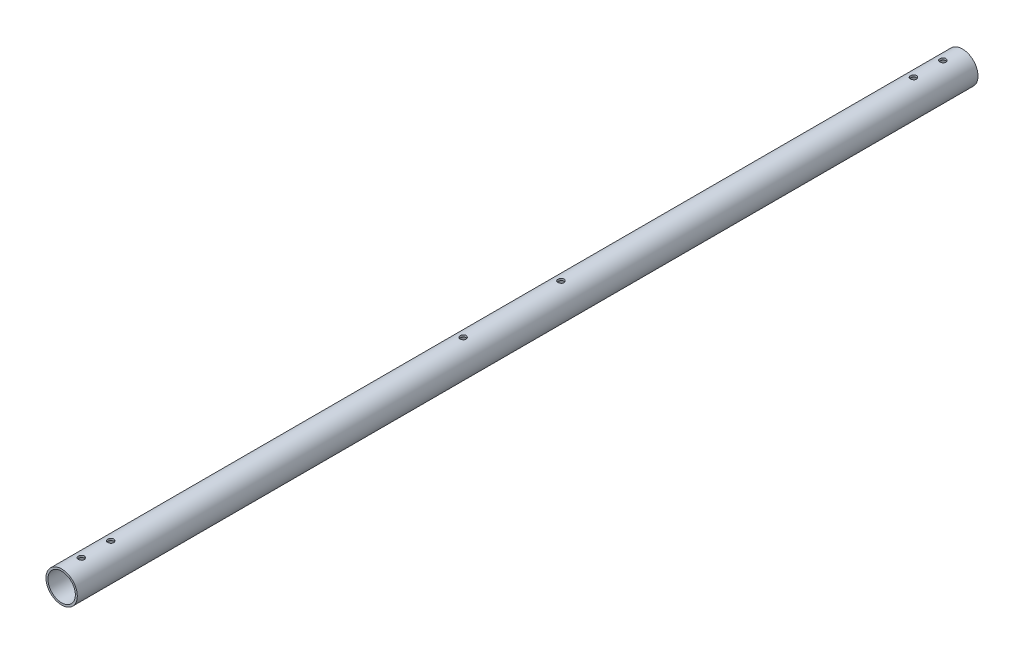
ISO-10303-21;
HEADER;
FILE_DESCRIPTION(('STEP AP214'),'2;1');
FILE_NAME('part.step','',(''),(''),'','','');
FILE_SCHEMA(('AUTOMOTIVE_DESIGN { 1 0 10303 214 1 1 1 1 }'));
ENDSEC;
DATA;
#1=APPLICATION_CONTEXT('core data for automotive mechanical design processes');
#2=APPLICATION_PROTOCOL_DEFINITION('international standard','automotive_design',2000,#1);
#3=PRODUCT_CONTEXT('',#1,'mechanical');
#4=PRODUCT('Part','Part','',(#3));
#5=PRODUCT_RELATED_PRODUCT_CATEGORY('part','',(#4));
#6=PRODUCT_DEFINITION_FORMATION('','',#4);
#7=PRODUCT_DEFINITION_CONTEXT('part definition',#1,'design');
#8=PRODUCT_DEFINITION('design','',#6,#7);
#9=PRODUCT_DEFINITION_SHAPE('','',#8);
#10=(LENGTH_UNIT() NAMED_UNIT(*) SI_UNIT(.MILLI.,.METRE.));
#11=(NAMED_UNIT(*) PLANE_ANGLE_UNIT() SI_UNIT($,.RADIAN.));
#12=(NAMED_UNIT(*) SI_UNIT($,.STERADIAN.) SOLID_ANGLE_UNIT());
#13=UNCERTAINTY_MEASURE_WITH_UNIT(LENGTH_MEASURE(1.E-05),#10,'distance_accuracy_value','');
#14=(GEOMETRIC_REPRESENTATION_CONTEXT(3) GLOBAL_UNCERTAINTY_ASSIGNED_CONTEXT((#13)) GLOBAL_UNIT_ASSIGNED_CONTEXT((#10,
#11,#12)) REPRESENTATION_CONTEXT('',''));
#15=CARTESIAN_POINT('',(0.,0.,0.));
#16=DIRECTION('',(0.,0.,1.));
#17=DIRECTION('',(1.,0.,0.));
#18=AXIS2_PLACEMENT_3D('',#15,#16,#17);
#19=CARTESIAN_POINT('',(0.,0.,460.));
#20=DIRECTION('',(0.,0.,1.));
#21=DIRECTION('',(1.,0.,0.));
#22=AXIS2_PLACEMENT_3D('',#19,#20,#21);
#23=PLANE('',#22);
#24=CARTESIAN_POINT('',(0.,0.,460.));
#25=DIRECTION('',(0.,0.,1.));
#26=DIRECTION('',(1.,0.,0.));
#27=AXIS2_PLACEMENT_3D('',#24,#25,#26);
#28=CIRCLE('',#27,8.);
#29=CARTESIAN_POINT('',(8.,0.,460.));
#30=VERTEX_POINT('',#29);
#31=EDGE_CURVE('E10',#30,#30,#28,.T.);
#32=ORIENTED_EDGE('',*,*,#31,.T.);
#33=EDGE_LOOP('',(#32));
#34=FACE_BOUND('',#33,.T.);
#35=CARTESIAN_POINT('',(0.,0.,460.));
#36=DIRECTION('',(0.,0.,1.));
#37=DIRECTION('',(1.,0.,0.));
#38=AXIS2_PLACEMENT_3D('',#35,#36,#37);
#39=CIRCLE('',#38,7.);
#40=CARTESIAN_POINT('',(7.,0.,460.));
#41=VERTEX_POINT('',#40);
#42=EDGE_CURVE('E52',#41,#41,#39,.T.);
#43=ORIENTED_EDGE('',*,*,#42,.F.);
#44=EDGE_LOOP('',(#43));
#45=FACE_BOUND('',#44,.T.);
#46=ADVANCED_FACE('F33',(#34,#45),#23,.T.);
#47=CARTESIAN_POINT('',(0.,0.,0.));
#48=DIRECTION('',(0.,0.,1.));
#49=DIRECTION('',(1.,0.,0.));
#50=AXIS2_PLACEMENT_3D('',#47,#48,#49);
#51=PLANE('',#50);
#52=CARTESIAN_POINT('',(0.,0.,0.));
#53=DIRECTION('',(0.,0.,1.));
#54=DIRECTION('',(1.,0.,0.));
#55=AXIS2_PLACEMENT_3D('',#52,#53,#54);
#56=CIRCLE('',#55,8.);
#57=CARTESIAN_POINT('',(8.,0.,0.));
#58=VERTEX_POINT('',#57);
#59=EDGE_CURVE('E47',#58,#58,#56,.T.);
#60=ORIENTED_EDGE('',*,*,#59,.F.);
#61=EDGE_LOOP('',(#60));
#62=FACE_BOUND('',#61,.T.);
#63=CARTESIAN_POINT('',(0.,0.,0.));
#64=DIRECTION('',(0.,0.,1.));
#65=DIRECTION('',(1.,0.,0.));
#66=AXIS2_PLACEMENT_3D('',#63,#64,#65);
#67=CIRCLE('',#66,7.);
#68=CARTESIAN_POINT('',(7.,0.,0.));
#69=VERTEX_POINT('',#68);
#70=EDGE_CURVE('E55',#69,#69,#67,.T.);
#71=ORIENTED_EDGE('',*,*,#70,.T.);
#72=EDGE_LOOP('',(#71));
#73=FACE_BOUND('',#72,.T.);
#74=ADVANCED_FACE('F220',(#62,#73),#51,.F.);
#75=CARTESIAN_POINT('',(0.,0.,460.));
#76=DIRECTION('',(0.,0.,-1.));
#77=DIRECTION('',(-1.,0.,0.));
#78=AXIS2_PLACEMENT_3D('',#75,#76,#77);
#79=CYLINDRICAL_SURFACE('',#78,8.);
#80=CARTESIAN_POINT('',(0.,-8.,11.55));
#81=CARTESIAN_POINT('',(0.0862000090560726,-7.99999842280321,11.5499967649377));
#82=CARTESIAN_POINT('',(0.172441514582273,-7.99859244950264,11.5427849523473));
#83=CARTESIAN_POINT('',(0.342490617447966,-7.99311930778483,11.5141489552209));
#84=CARTESIAN_POINT('',(0.426296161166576,-7.98904995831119,11.4927131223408));
#85=CARTESIAN_POINT('',(0.588989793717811,-7.97870487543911,11.4363130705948));
#86=CARTESIAN_POINT('',(0.667882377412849,-7.97243119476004,11.4013614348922));
#87=CARTESIAN_POINT('',(0.818677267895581,-7.95836101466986,11.3189584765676));
#88=CARTESIAN_POINT('',(0.89058006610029,-7.95056462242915,11.2715080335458));
#89=CARTESIAN_POINT('',(1.02627735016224,-7.93419720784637,11.1648126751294));
#90=CARTESIAN_POINT('',(1.08996986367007,-7.92561835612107,11.1054392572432));
#91=CARTESIAN_POINT('',(1.20655602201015,-7.90871045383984,10.9768596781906));
#92=CARTESIAN_POINT('',(1.25944885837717,-7.90038142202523,10.9076527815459));
#93=CARTESIAN_POINT('',(1.35336324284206,-7.88483993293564,10.7606437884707));
#94=CARTESIAN_POINT('',(1.39428014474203,-7.87763756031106,10.6827736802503));
#95=CARTESIAN_POINT('',(1.46241103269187,-7.86527562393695,10.5211015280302));
#96=CARTESIAN_POINT('',(1.48962628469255,-7.86011587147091,10.4373000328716));
#97=CARTESIAN_POINT('',(1.52925220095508,-7.85250239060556,10.2672380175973));
#98=CARTESIAN_POINT('',(1.54184123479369,-7.85001608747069,10.1810205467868));
#99=CARTESIAN_POINT('',(1.55241119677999,-7.84793288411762,10.0076640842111));
#100=CARTESIAN_POINT('',(1.55039352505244,-7.8483357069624,9.92052518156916));
#101=CARTESIAN_POINT('',(1.53195177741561,-7.85195561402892,9.74909792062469));
#102=CARTESIAN_POINT('',(1.51573133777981,-7.85513291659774,9.66478669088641));
#103=CARTESIAN_POINT('',(1.46966555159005,-7.8638812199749,9.50010528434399));
#104=CARTESIAN_POINT('',(1.43981959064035,-7.86945232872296,9.41973528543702));
#105=CARTESIAN_POINT('',(1.36715315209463,-7.88240165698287,9.26462634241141));
#106=CARTESIAN_POINT('',(1.32425119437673,-7.88979116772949,9.18992655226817));
#107=CARTESIAN_POINT('',(1.22674814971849,-7.90553732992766,9.04870967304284));
#108=CARTESIAN_POINT('',(1.17214579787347,-7.91389408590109,8.98219346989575));
#109=CARTESIAN_POINT('',(1.0516977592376,-7.93080599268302,8.85805610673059));
#110=CARTESIAN_POINT('',(0.985678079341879,-7.93936211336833,8.80060376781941));
#111=CARTESIAN_POINT('',(0.844849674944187,-7.9555794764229,8.69756327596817));
#112=CARTESIAN_POINT('',(0.770040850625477,-7.96324070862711,8.65197525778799));
#113=CARTESIAN_POINT('',(0.613575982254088,-7.97682216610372,8.57392948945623));
#114=CARTESIAN_POINT('',(0.531910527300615,-7.98273994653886,8.54149015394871));
#115=CARTESIAN_POINT('',(0.364149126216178,-7.99214900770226,8.49083784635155));
#116=CARTESIAN_POINT('',(0.278053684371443,-7.99564056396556,8.47262325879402));
#117=CARTESIAN_POINT('',(0.105327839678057,-7.99976566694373,8.45117445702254));
#118=CARTESIAN_POINT('',(0.0187271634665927,-8.0004433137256,8.44770906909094));
#119=CARTESIAN_POINT('',(-0.153815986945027,-7.99898639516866,8.45523571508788));
#120=CARTESIAN_POINT('',(-0.23975849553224,-7.99685197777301,8.46622698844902));
#121=CARTESIAN_POINT('',(-0.407806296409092,-7.99003828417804,8.50216282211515));
#122=CARTESIAN_POINT('',(-0.489937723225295,-7.98538049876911,8.52698959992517));
#123=CARTESIAN_POINT('',(-0.648872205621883,-7.97404029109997,8.58976362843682));
#124=CARTESIAN_POINT('',(-0.725674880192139,-7.9673577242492,8.62771181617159));
#125=CARTESIAN_POINT('',(-0.872752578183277,-7.95259926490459,8.7161574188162));
#126=CARTESIAN_POINT('',(-0.942941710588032,-7.94450813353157,8.7667950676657));
#127=CARTESIAN_POINT('',(-1.07390931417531,-7.92786761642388,8.8789933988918));
#128=CARTESIAN_POINT('',(-1.13468684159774,-7.91931818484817,8.94055517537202));
#129=CARTESIAN_POINT('',(-1.24599121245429,-7.90257717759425,9.07390372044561));
#130=CARTESIAN_POINT('',(-1.29635982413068,-7.89439242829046,9.1458235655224));
#131=CARTESIAN_POINT('',(-1.38430167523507,-7.8794483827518,9.29723907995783));
#132=CARTESIAN_POINT('',(-1.42187540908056,-7.8726890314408,9.37673445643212));
#133=CARTESIAN_POINT('',(-1.4829406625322,-7.86141544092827,9.54065582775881));
#134=CARTESIAN_POINT('',(-1.50650270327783,-7.85688997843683,9.6250547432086));
#135=CARTESIAN_POINT('',(-1.53909150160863,-7.85057181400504,9.79671006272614));
#136=CARTESIAN_POINT('',(-1.548120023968,-7.84877878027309,9.88396611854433));
#137=CARTESIAN_POINT('',(-1.5513233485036,-7.84814610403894,10.0572720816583));
#138=CARTESIAN_POINT('',(-1.54574795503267,-7.84925679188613,10.1433172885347));
#139=CARTESIAN_POINT('',(-1.52045079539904,-7.85419586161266,10.3132188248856));
#140=CARTESIAN_POINT('',(-1.50072912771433,-7.85802422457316,10.3970751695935));
#141=CARTESIAN_POINT('',(-1.4478076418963,-7.867945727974,10.5600721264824));
#142=CARTESIAN_POINT('',(-1.41463664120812,-7.87403402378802,10.6392224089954));
#143=CARTESIAN_POINT('',(-1.33578606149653,-7.88779248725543,10.7908737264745));
#144=CARTESIAN_POINT('',(-1.29010551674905,-7.89546277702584,10.8633742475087));
#145=CARTESIAN_POINT('',(-1.18667159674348,-7.91167407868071,11.0009156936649));
#146=CARTESIAN_POINT('',(-1.12873710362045,-7.92022703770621,11.0658190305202));
#147=CARTESIAN_POINT('',(-1.00281570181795,-7.93715240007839,11.1850658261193));
#148=CARTESIAN_POINT('',(-0.934826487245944,-7.94552476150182,11.2394068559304));
#149=CARTESIAN_POINT('',(-0.789933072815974,-7.96124124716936,11.336482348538));
#150=CARTESIAN_POINT('',(-0.712948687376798,-7.96857459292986,11.3790989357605));
#151=CARTESIAN_POINT('',(-0.552792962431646,-7.98128114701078,11.4507240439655));
#152=CARTESIAN_POINT('',(-0.46962740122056,-7.98665615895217,11.479745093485));
#153=CARTESIAN_POINT('',(-0.321871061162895,-7.99376993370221,11.5175963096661));
#154=CARTESIAN_POINT('',(-0.258133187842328,-7.99609278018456,11.5297264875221));
#155=CARTESIAN_POINT('',(-0.129604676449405,-7.99920838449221,11.5459294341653));
#156=CARTESIAN_POINT('',(-0.0648140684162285,-8.00000118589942,11.5500024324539));
#157=CARTESIAN_POINT('',(0.,-8.,11.55));
#158=B_SPLINE_CURVE_WITH_KNOTS('',3,(#80,#81,#82,#83,#84,#85,#86,#87,#88,#89,#90,#91,#92,#93,
#94,#95,#96,#97,#98,#99,#100,#101,#102,#103,#104,#105,#106,#107,#108,#109,#110,#111,#112,#113,
#114,#115,#116,#117,#118,#119,#120,#121,#122,#123,#124,#125,#126,#127,#128,#129,#130,#131,#132,
#133,#134,#135,#136,#137,#138,#139,#140,#141,#142,#143,#144,#145,#146,#147,#148,#149,#150,#151,
#152,#153,#154,#155,#156,#157),.UNSPECIFIED.,.T.,.F.,(4,2,2,2,2,2,2,2,2,2,2,2,2,2,2,2,2,2,2,2,2,
2,2,2,2,2,2,2,2,2,2,2,2,2,2,2,2,2,4),(0.,0.25836295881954,0.516937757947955,0.775272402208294,
1.03358887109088,1.29485526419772,1.55614120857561,1.81964642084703,2.08312728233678,
2.34336004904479,2.6035678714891,2.86010487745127,3.11665345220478,3.3748371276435,
3.63304872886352,3.89561245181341,4.15817915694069,4.42111232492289,4.68401562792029,
4.94278274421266,5.20153624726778,5.45811989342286,5.71472186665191,5.97429534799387,
6.23389484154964,6.49718968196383,6.76047434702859,7.02242242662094,7.2843386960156,
7.54180418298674,7.79926787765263,8.05618280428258,8.31311757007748,8.57415474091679,
8.83525186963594,9.09888533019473,9.36227536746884,9.55654485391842,9.75080880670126),.UNSPECIFIED.);
#159=CARTESIAN_POINT('',(0.,-8.,11.55));
#160=VERTEX_POINT('',#159);
#161=EDGE_CURVE('E209',#160,#160,#158,.T.);
#162=ORIENTED_EDGE('',*,*,#161,.T.);
#163=EDGE_LOOP('',(#162));
#164=FACE_BOUND('',#163,.T.);
#165=CARTESIAN_POINT('',(0.,8.,11.55));
#166=CARTESIAN_POINT('',(-0.0862000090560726,7.99999842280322,11.5499967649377));
#167=CARTESIAN_POINT('',(-0.172441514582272,7.99859244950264,11.5427849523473));
#168=CARTESIAN_POINT('',(-0.342490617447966,7.99311930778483,11.5141489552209));
#169=CARTESIAN_POINT('',(-0.426296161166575,7.98904995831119,11.4927131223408));
#170=CARTESIAN_POINT('',(-0.58898979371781,7.97870487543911,11.4363130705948));
#171=CARTESIAN_POINT('',(-0.667882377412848,7.97243119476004,11.4013614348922));
#172=CARTESIAN_POINT('',(-0.81867726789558,7.95836101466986,11.3189584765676));
#173=CARTESIAN_POINT('',(-0.89058006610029,7.95056462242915,11.2715080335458));
#174=CARTESIAN_POINT('',(-1.02627735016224,7.93419720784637,11.1648126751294));
#175=CARTESIAN_POINT('',(-1.08996986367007,7.92561835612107,11.1054392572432));
#176=CARTESIAN_POINT('',(-1.20655602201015,7.90871045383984,10.9768596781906));
#177=CARTESIAN_POINT('',(-1.25944885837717,7.90038142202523,10.9076527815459));
#178=CARTESIAN_POINT('',(-1.35336324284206,7.88483993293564,10.7606437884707));
#179=CARTESIAN_POINT('',(-1.39428014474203,7.87763756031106,10.6827736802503));
#180=CARTESIAN_POINT('',(-1.46241103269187,7.86527562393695,10.5211015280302));
#181=CARTESIAN_POINT('',(-1.48962628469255,7.86011587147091,10.4373000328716));
#182=CARTESIAN_POINT('',(-1.52925220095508,7.85250239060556,10.2672380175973));
#183=CARTESIAN_POINT('',(-1.54184123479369,7.85001608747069,10.1810205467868));
#184=CARTESIAN_POINT('',(-1.55241119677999,7.84793288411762,10.0076640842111));
#185=CARTESIAN_POINT('',(-1.55039352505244,7.8483357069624,9.92052518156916));
#186=CARTESIAN_POINT('',(-1.53195177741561,7.85195561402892,9.7490979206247));
#187=CARTESIAN_POINT('',(-1.51573133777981,7.85513291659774,9.66478669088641));
#188=CARTESIAN_POINT('',(-1.46966555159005,7.8638812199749,9.50010528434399));
#189=CARTESIAN_POINT('',(-1.43981959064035,7.86945232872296,9.41973528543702));
#190=CARTESIAN_POINT('',(-1.36715315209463,7.88240165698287,9.26462634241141));
#191=CARTESIAN_POINT('',(-1.32425119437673,7.88979116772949,9.18992655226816));
#192=CARTESIAN_POINT('',(-1.22674814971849,7.90553732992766,9.04870967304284));
#193=CARTESIAN_POINT('',(-1.17214579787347,7.91389408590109,8.98219346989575));
#194=CARTESIAN_POINT('',(-1.0516977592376,7.93080599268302,8.8580561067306));
#195=CARTESIAN_POINT('',(-0.985678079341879,7.93936211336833,8.80060376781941));
#196=CARTESIAN_POINT('',(-0.844849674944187,7.9555794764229,8.69756327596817));
#197=CARTESIAN_POINT('',(-0.770040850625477,7.96324070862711,8.65197525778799));
#198=CARTESIAN_POINT('',(-0.613575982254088,7.97682216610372,8.57392948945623));
#199=CARTESIAN_POINT('',(-0.531910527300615,7.98273994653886,8.54149015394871));
#200=CARTESIAN_POINT('',(-0.364149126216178,7.99214900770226,8.49083784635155));
#201=CARTESIAN_POINT('',(-0.278053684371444,7.99564056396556,8.47262325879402));
#202=CARTESIAN_POINT('',(-0.105327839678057,7.99976566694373,8.45117445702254));
#203=CARTESIAN_POINT('',(-0.0187271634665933,8.0004433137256,8.44770906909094));
#204=CARTESIAN_POINT('',(0.153815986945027,7.99898639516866,8.45523571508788));
#205=CARTESIAN_POINT('',(0.23975849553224,7.99685197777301,8.46622698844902));
#206=CARTESIAN_POINT('',(0.407806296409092,7.99003828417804,8.50216282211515));
#207=CARTESIAN_POINT('',(0.489937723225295,7.98538049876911,8.52698959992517));
#208=CARTESIAN_POINT('',(0.648872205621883,7.97404029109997,8.58976362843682));
#209=CARTESIAN_POINT('',(0.725674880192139,7.9673577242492,8.62771181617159));
#210=CARTESIAN_POINT('',(0.872752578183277,7.95259926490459,8.7161574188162));
#211=CARTESIAN_POINT('',(0.942941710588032,7.94450813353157,8.7667950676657));
#212=CARTESIAN_POINT('',(1.07390931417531,7.92786761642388,8.8789933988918));
#213=CARTESIAN_POINT('',(1.13468684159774,7.91931818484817,8.94055517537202));
#214=CARTESIAN_POINT('',(1.24599121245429,7.90257717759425,9.07390372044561));
#215=CARTESIAN_POINT('',(1.29635982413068,7.89439242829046,9.1458235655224));
#216=CARTESIAN_POINT('',(1.38430167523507,7.8794483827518,9.29723907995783));
#217=CARTESIAN_POINT('',(1.42187540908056,7.8726890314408,9.37673445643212));
#218=CARTESIAN_POINT('',(1.4829406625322,7.86141544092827,9.54065582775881));
#219=CARTESIAN_POINT('',(1.50650270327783,7.85688997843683,9.6250547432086));
#220=CARTESIAN_POINT('',(1.53909150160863,7.85057181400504,9.79671006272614));
#221=CARTESIAN_POINT('',(1.548120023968,7.84877878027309,9.88396611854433));
#222=CARTESIAN_POINT('',(1.5513233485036,7.84814610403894,10.0572720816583));
#223=CARTESIAN_POINT('',(1.54574795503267,7.84925679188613,10.1433172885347));
#224=CARTESIAN_POINT('',(1.52045079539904,7.85419586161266,10.3132188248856));
#225=CARTESIAN_POINT('',(1.50072912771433,7.85802422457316,10.3970751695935));
#226=CARTESIAN_POINT('',(1.4478076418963,7.867945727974,10.5600721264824));
#227=CARTESIAN_POINT('',(1.41463664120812,7.87403402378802,10.6392224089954));
#228=CARTESIAN_POINT('',(1.33578606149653,7.88779248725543,10.7908737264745));
#229=CARTESIAN_POINT('',(1.29010551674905,7.89546277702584,10.8633742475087));
#230=CARTESIAN_POINT('',(1.18667159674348,7.91167407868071,11.0009156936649));
#231=CARTESIAN_POINT('',(1.12873710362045,7.92022703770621,11.0658190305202));
#232=CARTESIAN_POINT('',(1.00281570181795,7.93715240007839,11.1850658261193));
#233=CARTESIAN_POINT('',(0.934826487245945,7.94552476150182,11.2394068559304));
#234=CARTESIAN_POINT('',(0.789933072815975,7.96124124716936,11.336482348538));
#235=CARTESIAN_POINT('',(0.7129486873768,7.96857459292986,11.3790989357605));
#236=CARTESIAN_POINT('',(0.552792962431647,7.98128114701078,11.4507240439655));
#237=CARTESIAN_POINT('',(0.469627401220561,7.98665615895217,11.479745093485));
#238=CARTESIAN_POINT('',(0.321871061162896,7.99376993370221,11.5175963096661));
#239=CARTESIAN_POINT('',(0.258133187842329,7.99609278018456,11.5297264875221));
#240=CARTESIAN_POINT('',(0.129604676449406,7.99920838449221,11.5459294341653));
#241=CARTESIAN_POINT('',(0.0648140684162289,8.00000118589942,11.5500024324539));
#242=CARTESIAN_POINT('',(0.,8.,11.55));
#243=B_SPLINE_CURVE_WITH_KNOTS('',3,(#165,#166,#167,#168,#169,#170,#171,#172,#173,#174,#175,
#176,#177,#178,#179,#180,#181,#182,#183,#184,#185,#186,#187,#188,#189,#190,#191,#192,#193,#194,
#195,#196,#197,#198,#199,#200,#201,#202,#203,#204,#205,#206,#207,#208,#209,#210,#211,#212,#213,
#214,#215,#216,#217,#218,#219,#220,#221,#222,#223,#224,#225,#226,#227,#228,#229,#230,#231,#232,
#233,#234,#235,#236,#237,#238,#239,#240,#241,#242),.UNSPECIFIED.,.T.,.F.,(4,2,2,2,2,2,2,2,2,2,2,
2,2,2,2,2,2,2,2,2,2,2,2,2,2,2,2,2,2,2,2,2,2,2,2,2,2,2,4),(0.,0.25836295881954,0.516937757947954,
0.775272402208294,1.03358887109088,1.29485526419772,1.55614120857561,1.81964642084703,
2.08312728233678,2.34336004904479,2.6035678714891,2.86010487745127,3.11665345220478,
3.37483712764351,3.63304872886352,3.89561245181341,4.15817915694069,4.42111232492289,
4.68401562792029,4.94278274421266,5.20153624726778,5.45811989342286,5.71472186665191,
5.97429534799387,6.23389484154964,6.49718968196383,6.76047434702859,7.02242242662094,
7.2843386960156,7.54180418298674,7.79926787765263,8.05618280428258,8.31311757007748,
8.57415474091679,8.83525186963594,9.09888533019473,9.36227536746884,9.55654485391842,
9.75080880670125),.UNSPECIFIED.);
#244=CARTESIAN_POINT('',(0.,8.,11.55));
#245=VERTEX_POINT('',#244);
#246=EDGE_CURVE('E203',#245,#245,#243,.T.);
#247=ORIENTED_EDGE('',*,*,#246,.T.);
#248=EDGE_LOOP('',(#247));
#249=FACE_BOUND('',#248,.T.);
#250=CARTESIAN_POINT('',(0.,-8.,256.55));
#251=CARTESIAN_POINT('',(0.0862000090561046,-7.99999842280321,256.549996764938));
#252=CARTESIAN_POINT('',(0.172441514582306,-7.99859244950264,256.542784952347));
#253=CARTESIAN_POINT('',(0.342490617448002,-7.99311930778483,256.514148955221));
#254=CARTESIAN_POINT('',(0.426296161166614,-7.98904995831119,256.492713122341));
#255=CARTESIAN_POINT('',(0.588989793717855,-7.97870487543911,256.436313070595));
#256=CARTESIAN_POINT('',(0.667882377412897,-7.97243119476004,256.401361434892));
#257=CARTESIAN_POINT('',(0.818677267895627,-7.95836101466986,256.318958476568));
#258=CARTESIAN_POINT('',(0.890580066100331,-7.95056462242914,256.271508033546));
#259=CARTESIAN_POINT('',(1.02627735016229,-7.93419720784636,256.16481267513));
#260=CARTESIAN_POINT('',(1.08996986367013,-7.92561835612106,256.105439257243));
#261=CARTESIAN_POINT('',(1.20655602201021,-7.90871045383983,255.976859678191));
#262=CARTESIAN_POINT('',(1.25944885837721,-7.90038142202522,255.907652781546));
#263=CARTESIAN_POINT('',(1.35336324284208,-7.88483993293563,255.760643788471));
#264=CARTESIAN_POINT('',(1.39428014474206,-7.87763756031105,255.68277368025));
#265=CARTESIAN_POINT('',(1.46241103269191,-7.86527562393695,255.52110152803));
#266=CARTESIAN_POINT('',(1.48962628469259,-7.8601158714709,255.437300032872));
#267=CARTESIAN_POINT('',(1.52925220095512,-7.85250239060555,255.267238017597));
#268=CARTESIAN_POINT('',(1.54184123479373,-7.85001608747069,255.181020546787));
#269=CARTESIAN_POINT('',(1.55241119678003,-7.84793288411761,255.007664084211));
#270=CARTESIAN_POINT('',(1.55039352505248,-7.84833570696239,254.920525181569));
#271=CARTESIAN_POINT('',(1.53195177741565,-7.85195561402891,254.749097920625));
#272=CARTESIAN_POINT('',(1.51573133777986,-7.85513291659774,254.664786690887));
#273=CARTESIAN_POINT('',(1.4696655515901,-7.86388121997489,254.500105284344));
#274=CARTESIAN_POINT('',(1.4398195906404,-7.86945232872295,254.419735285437));
#275=CARTESIAN_POINT('',(1.36715315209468,-7.88240165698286,254.264626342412));
#276=CARTESIAN_POINT('',(1.32425119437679,-7.88979116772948,254.189926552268));
#277=CARTESIAN_POINT('',(1.22674814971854,-7.90553732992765,254.048709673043));
#278=CARTESIAN_POINT('',(1.17214579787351,-7.91389408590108,253.982193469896));
#279=CARTESIAN_POINT('',(1.05169775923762,-7.93080599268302,253.858056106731));
#280=CARTESIAN_POINT('',(0.985678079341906,-7.93936211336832,253.800603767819));
#281=CARTESIAN_POINT('',(0.844849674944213,-7.9555794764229,253.697563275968));
#282=CARTESIAN_POINT('',(0.770040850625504,-7.96324070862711,253.651975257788));
#283=CARTESIAN_POINT('',(0.613575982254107,-7.97682216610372,253.573929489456));
#284=CARTESIAN_POINT('',(0.531910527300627,-7.98273994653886,253.541490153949));
#285=CARTESIAN_POINT('',(0.36414912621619,-7.99214900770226,253.490837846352));
#286=CARTESIAN_POINT('',(0.278053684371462,-7.99564056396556,253.472623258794));
#287=CARTESIAN_POINT('',(0.105327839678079,-7.99976566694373,253.451174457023));
#288=CARTESIAN_POINT('',(0.0187271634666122,-8.0004433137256,253.447709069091));
#289=CARTESIAN_POINT('',(-0.153815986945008,-7.99898639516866,253.455235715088));
#290=CARTESIAN_POINT('',(-0.239758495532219,-7.99685197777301,253.466226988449));
#291=CARTESIAN_POINT('',(-0.407806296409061,-7.99003828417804,253.502162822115));
#292=CARTESIAN_POINT('',(-0.489937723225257,-7.98538049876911,253.526989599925));
#293=CARTESIAN_POINT('',(-0.648872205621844,-7.97404029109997,253.589763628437));
#294=CARTESIAN_POINT('',(-0.725674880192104,-7.9673577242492,253.627711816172));
#295=CARTESIAN_POINT('',(-0.872752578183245,-7.95259926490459,253.716157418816));
#296=CARTESIAN_POINT('',(-0.942941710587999,-7.94450813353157,253.766795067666));
#297=CARTESIAN_POINT('',(-1.07390931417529,-7.92786761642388,253.878993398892));
#298=CARTESIAN_POINT('',(-1.13468684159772,-7.91931818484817,253.940555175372));
#299=CARTESIAN_POINT('',(-1.24599121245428,-7.90257717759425,254.073903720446));
#300=CARTESIAN_POINT('',(-1.29635982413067,-7.89439242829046,254.145823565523));
#301=CARTESIAN_POINT('',(-1.38430167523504,-7.87944838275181,254.297239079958));
#302=CARTESIAN_POINT('',(-1.42187540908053,-7.8726890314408,254.376734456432));
#303=CARTESIAN_POINT('',(-1.48294066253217,-7.86141544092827,254.540655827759));
#304=CARTESIAN_POINT('',(-1.5065027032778,-7.85688997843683,254.625054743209));
#305=CARTESIAN_POINT('',(-1.5390915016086,-7.85057181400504,254.796710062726));
#306=CARTESIAN_POINT('',(-1.54812002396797,-7.84877878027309,254.883966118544));
#307=CARTESIAN_POINT('',(-1.55132334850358,-7.84814610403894,255.057272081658));
#308=CARTESIAN_POINT('',(-1.54574795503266,-7.84925679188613,255.143317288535));
#309=CARTESIAN_POINT('',(-1.52045079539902,-7.85419586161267,255.313218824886));
#310=CARTESIAN_POINT('',(-1.50072912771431,-7.85802422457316,255.397075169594));
#311=CARTESIAN_POINT('',(-1.44780764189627,-7.86794572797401,255.560072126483));
#312=CARTESIAN_POINT('',(-1.41463664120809,-7.87403402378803,255.639222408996));
#313=CARTESIAN_POINT('',(-1.33578606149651,-7.88779248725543,255.790873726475));
#314=CARTESIAN_POINT('',(-1.29010551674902,-7.89546277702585,255.863374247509));
#315=CARTESIAN_POINT('',(-1.18667159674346,-7.91167407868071,256.000915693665));
#316=CARTESIAN_POINT('',(-1.12873710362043,-7.92022703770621,256.06581903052));
#317=CARTESIAN_POINT('',(-1.00281570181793,-7.93715240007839,256.185065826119));
#318=CARTESIAN_POINT('',(-0.934826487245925,-7.94552476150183,256.23940685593));
#319=CARTESIAN_POINT('',(-0.789933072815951,-7.96124124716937,256.336482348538));
#320=CARTESIAN_POINT('',(-0.712948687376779,-7.96857459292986,256.379098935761));
#321=CARTESIAN_POINT('',(-0.552792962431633,-7.98128114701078,256.450724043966));
#322=CARTESIAN_POINT('',(-0.469627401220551,-7.98665615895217,256.479745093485));
#323=CARTESIAN_POINT('',(-0.321871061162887,-7.99376993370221,256.517596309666));
#324=CARTESIAN_POINT('',(-0.258133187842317,-7.99609278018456,256.529726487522));
#325=CARTESIAN_POINT('',(-0.129604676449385,-7.99920838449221,256.545929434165));
#326=CARTESIAN_POINT('',(-0.0648140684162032,-8.00000118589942,256.550002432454));
#327=CARTESIAN_POINT('',(0.,-8.,256.55));
#328=B_SPLINE_CURVE_WITH_KNOTS('',3,(#250,#251,#252,#253,#254,#255,#256,#257,#258,#259,#260,
#261,#262,#263,#264,#265,#266,#267,#268,#269,#270,#271,#272,#273,#274,#275,#276,#277,#278,#279,
#280,#281,#282,#283,#284,#285,#286,#287,#288,#289,#290,#291,#292,#293,#294,#295,#296,#297,#298,
#299,#300,#301,#302,#303,#304,#305,#306,#307,#308,#309,#310,#311,#312,#313,#314,#315,#316,#317,
#318,#319,#320,#321,#322,#323,#324,#325,#326,#327),.UNSPECIFIED.,.T.,.F.,(4,2,2,2,2,2,2,2,2,2,2,
2,2,2,2,2,2,2,2,2,2,2,2,2,2,2,2,2,2,2,2,2,2,2,2,2,2,2,4),(0.,0.258362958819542,
0.516937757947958,0.775272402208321,1.03358887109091,1.29485526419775,1.55614120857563,
1.81964642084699,2.08312728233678,2.34336004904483,2.60356787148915,2.86010487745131,
3.1166534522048,3.37483712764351,3.63304872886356,3.89561245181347,4.15817915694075,
4.42111232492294,4.68401562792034,4.94278274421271,5.20153624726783,5.45811989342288,
5.71472186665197,5.97429534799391,6.23389484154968,6.49718968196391,6.76047434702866,
7.02242242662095,7.28433869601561,7.54180418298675,7.79926787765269,8.05618280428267,
8.31311757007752,8.57415474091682,8.83525186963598,9.09888533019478,9.36227536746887,
9.55654485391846,9.75080880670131),.UNSPECIFIED.);
#329=CARTESIAN_POINT('',(0.,-8.,256.55));
#330=VERTEX_POINT('',#329);
#331=EDGE_CURVE('E193',#330,#330,#328,.T.);
#332=ORIENTED_EDGE('',*,*,#331,.T.);
#333=EDGE_LOOP('',(#332));
#334=FACE_BOUND('',#333,.T.);
#335=CARTESIAN_POINT('',(0.,8.,256.55));
#336=CARTESIAN_POINT('',(-0.0862000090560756,7.99999842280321,256.549996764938));
#337=CARTESIAN_POINT('',(-0.172441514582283,7.99859244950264,256.542784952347));
#338=CARTESIAN_POINT('',(-0.342490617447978,7.99311930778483,256.514148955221));
#339=CARTESIAN_POINT('',(-0.426296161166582,7.98904995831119,256.492713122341));
#340=CARTESIAN_POINT('',(-0.588989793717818,7.97870487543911,256.436313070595));
#341=CARTESIAN_POINT('',(-0.667882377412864,7.97243119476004,256.401361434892));
#342=CARTESIAN_POINT('',(-0.818677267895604,7.95836101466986,256.318958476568));
#343=CARTESIAN_POINT('',(-0.890580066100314,7.95056462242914,256.271508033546));
#344=CARTESIAN_POINT('',(-1.02627735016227,7.93419720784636,256.164812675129));
#345=CARTESIAN_POINT('',(-1.08996986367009,7.92561835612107,256.105439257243));
#346=CARTESIAN_POINT('',(-1.20655602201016,7.90871045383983,255.976859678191));
#347=CARTESIAN_POINT('',(-1.25944885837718,7.90038142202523,255.907652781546));
#348=CARTESIAN_POINT('',(-1.35336324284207,7.88483993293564,255.760643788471));
#349=CARTESIAN_POINT('',(-1.39428014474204,7.87763756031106,255.68277368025));
#350=CARTESIAN_POINT('',(-1.46241103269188,7.86527562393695,255.52110152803));
#351=CARTESIAN_POINT('',(-1.48962628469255,7.86011587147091,255.437300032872));
#352=CARTESIAN_POINT('',(-1.52925220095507,7.85250239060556,255.267238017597));
#353=CARTESIAN_POINT('',(-1.54184123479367,7.85001608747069,255.181020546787));
#354=CARTESIAN_POINT('',(-1.55241119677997,7.84793288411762,255.007664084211));
#355=CARTESIAN_POINT('',(-1.55039352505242,7.84833570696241,254.920525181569));
#356=CARTESIAN_POINT('',(-1.53195177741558,7.85195561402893,254.749097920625));
#357=CARTESIAN_POINT('',(-1.51573133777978,7.85513291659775,254.664786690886));
#358=CARTESIAN_POINT('',(-1.46966555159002,7.8638812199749,254.500105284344));
#359=CARTESIAN_POINT('',(-1.43981959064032,7.86945232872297,254.419735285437));
#360=CARTESIAN_POINT('',(-1.36715315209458,7.88240165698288,254.264626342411));
#361=CARTESIAN_POINT('',(-1.32425119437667,7.8897911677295,254.189926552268));
#362=CARTESIAN_POINT('',(-1.22674814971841,7.90553732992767,254.048709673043));
#363=CARTESIAN_POINT('',(-1.17214579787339,7.9138940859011,253.982193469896));
#364=CARTESIAN_POINT('',(-1.05169775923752,7.93080599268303,253.858056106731));
#365=CARTESIAN_POINT('',(-0.985678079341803,7.93936211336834,253.800603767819));
#366=CARTESIAN_POINT('',(-0.844849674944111,7.95557947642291,253.697563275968));
#367=CARTESIAN_POINT('',(-0.770040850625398,7.96324070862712,253.651975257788));
#368=CARTESIAN_POINT('',(-0.613575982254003,7.97682216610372,253.573929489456));
#369=CARTESIAN_POINT('',(-0.531910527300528,7.98273994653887,253.541490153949));
#370=CARTESIAN_POINT('',(-0.364149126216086,7.99214900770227,253.490837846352));
#371=CARTESIAN_POINT('',(-0.27805368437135,7.99564056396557,253.472623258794));
#372=CARTESIAN_POINT('',(-0.105327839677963,7.99976566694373,253.451174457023));
#373=CARTESIAN_POINT('',(-0.018727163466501,8.0004433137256,253.447709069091));
#374=CARTESIAN_POINT('',(0.153815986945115,7.99898639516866,253.455235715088));
#375=CARTESIAN_POINT('',(0.239758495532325,7.99685197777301,253.466226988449));
#376=CARTESIAN_POINT('',(0.407806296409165,7.99003828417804,253.502162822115));
#377=CARTESIAN_POINT('',(0.489937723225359,7.9853804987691,253.526989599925));
#378=CARTESIAN_POINT('',(0.648872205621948,7.97404029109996,253.589763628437));
#379=CARTESIAN_POINT('',(0.725674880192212,7.96735772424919,253.627711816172));
#380=CARTESIAN_POINT('',(0.872752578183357,7.95259926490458,253.716157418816));
#381=CARTESIAN_POINT('',(0.94294171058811,7.94450813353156,253.766795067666));
#382=CARTESIAN_POINT('',(1.07390931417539,7.92786761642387,253.878993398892));
#383=CARTESIAN_POINT('',(1.13468684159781,7.91931818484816,253.940555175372));
#384=CARTESIAN_POINT('',(1.24599121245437,7.90257717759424,254.073903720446));
#385=CARTESIAN_POINT('',(1.29635982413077,7.89439242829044,254.145823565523));
#386=CARTESIAN_POINT('',(1.38430167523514,7.87944838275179,254.297239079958));
#387=CARTESIAN_POINT('',(1.42187540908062,7.87268903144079,254.376734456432));
#388=CARTESIAN_POINT('',(1.48294066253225,7.86141544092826,254.540655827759));
#389=CARTESIAN_POINT('',(1.50650270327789,7.85688997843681,254.625054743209));
#390=CARTESIAN_POINT('',(1.53909150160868,7.85057181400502,254.796710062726));
#391=CARTESIAN_POINT('',(1.54812002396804,7.84877878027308,254.883966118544));
#392=CARTESIAN_POINT('',(1.55132334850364,7.84814610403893,255.057272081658));
#393=CARTESIAN_POINT('',(1.54574795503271,7.84925679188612,255.143317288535));
#394=CARTESIAN_POINT('',(1.52045079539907,7.85419586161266,255.313218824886));
#395=CARTESIAN_POINT('',(1.50072912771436,7.85802422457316,255.397075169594));
#396=CARTESIAN_POINT('',(1.44780764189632,7.867945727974,255.560072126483));
#397=CARTESIAN_POINT('',(1.41463664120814,7.87403402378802,255.639222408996));
#398=CARTESIAN_POINT('',(1.33578606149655,7.88779248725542,255.790873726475));
#399=CARTESIAN_POINT('',(1.29010551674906,7.89546277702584,255.863374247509));
#400=CARTESIAN_POINT('',(1.18667159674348,7.91167407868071,256.000915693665));
#401=CARTESIAN_POINT('',(1.12873710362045,7.92022703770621,256.06581903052));
#402=CARTESIAN_POINT('',(1.00281570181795,7.93715240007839,256.185065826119));
#403=CARTESIAN_POINT('',(0.934826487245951,7.94552476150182,256.239406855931));
#404=CARTESIAN_POINT('',(0.789933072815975,7.96124124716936,256.336482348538));
#405=CARTESIAN_POINT('',(0.712948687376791,7.96857459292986,256.379098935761));
#406=CARTESIAN_POINT('',(0.552792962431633,7.98128114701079,256.450724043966));
#407=CARTESIAN_POINT('',(0.46962740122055,7.98665615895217,256.479745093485));
#408=CARTESIAN_POINT('',(0.321871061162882,7.99376993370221,256.517596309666));
#409=CARTESIAN_POINT('',(0.258133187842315,7.99609278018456,256.529726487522));
#410=CARTESIAN_POINT('',(0.129604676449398,7.99920838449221,256.545929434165));
#411=CARTESIAN_POINT('',(0.0648140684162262,8.00000118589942,256.550002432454));
#412=CARTESIAN_POINT('',(0.,8.,256.55));
#413=B_SPLINE_CURVE_WITH_KNOTS('',3,(#335,#336,#337,#338,#339,#340,#341,#342,#343,#344,#345,
#346,#347,#348,#349,#350,#351,#352,#353,#354,#355,#356,#357,#358,#359,#360,#361,#362,#363,#364,
#365,#366,#367,#368,#369,#370,#371,#372,#373,#374,#375,#376,#377,#378,#379,#380,#381,#382,#383,
#384,#385,#386,#387,#388,#389,#390,#391,#392,#393,#394,#395,#396,#397,#398,#399,#400,#401,#402,
#403,#404,#405,#406,#407,#408,#409,#410,#411,#412),.UNSPECIFIED.,.T.,.F.,(4,2,2,2,2,2,2,2,2,2,2,
2,2,2,2,2,2,2,2,2,2,2,2,2,2,2,2,2,2,2,2,2,2,2,2,2,2,2,4),(0.,0.258362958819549,
0.516937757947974,0.77527240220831,1.03358887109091,1.29485526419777,1.55614120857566,
1.81964642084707,2.0831272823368,2.34336004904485,2.60356787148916,2.86010487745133,
3.11665345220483,3.37483712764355,3.6330487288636,3.89561245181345,4.15817915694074,
4.42111232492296,4.68401562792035,4.94278274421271,5.20153624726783,5.45811989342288,
5.71472186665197,5.97429534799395,6.2338948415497,6.49718968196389,6.76047434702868,
7.02242242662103,7.28433869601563,7.54180418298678,7.79926787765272,8.05618280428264,
8.31311757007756,8.57415474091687,8.83525186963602,9.0988853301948,9.36227536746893,
9.55654485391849,9.75080880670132),.UNSPECIFIED.);
#414=CARTESIAN_POINT('',(0.,8.,256.55));
#415=VERTEX_POINT('',#414);
#416=EDGE_CURVE('E187',#415,#415,#413,.T.);
#417=ORIENTED_EDGE('',*,*,#416,.T.);
#418=EDGE_LOOP('',(#417));
#419=FACE_BOUND('',#418,.T.);
#420=CARTESIAN_POINT('',(0.,-8.,26.55));
#421=CARTESIAN_POINT('',(0.0862000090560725,-7.99999842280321,26.5499967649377));
#422=CARTESIAN_POINT('',(0.172441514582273,-7.99859244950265,26.5427849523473));
#423=CARTESIAN_POINT('',(0.342490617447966,-7.99311930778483,26.5141489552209));
#424=CARTESIAN_POINT('',(0.426296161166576,-7.98904995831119,26.4927131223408));
#425=CARTESIAN_POINT('',(0.58898979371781,-7.97870487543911,26.4363130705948));
#426=CARTESIAN_POINT('',(0.667882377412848,-7.97243119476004,26.4013614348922));
#427=CARTESIAN_POINT('',(0.81867726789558,-7.95836101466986,26.3189584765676));
#428=CARTESIAN_POINT('',(0.89058006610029,-7.95056462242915,26.2715080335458));
#429=CARTESIAN_POINT('',(1.02627735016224,-7.93419720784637,26.1648126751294));
#430=CARTESIAN_POINT('',(1.08996986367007,-7.92561835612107,26.1054392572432));
#431=CARTESIAN_POINT('',(1.20655602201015,-7.90871045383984,25.9768596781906));
#432=CARTESIAN_POINT('',(1.25944885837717,-7.90038142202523,25.9076527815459));
#433=CARTESIAN_POINT('',(1.35336324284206,-7.88483993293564,25.7606437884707));
#434=CARTESIAN_POINT('',(1.39428014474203,-7.87763756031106,25.6827736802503));
#435=CARTESIAN_POINT('',(1.46241103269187,-7.86527562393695,25.5211015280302));
#436=CARTESIAN_POINT('',(1.48962628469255,-7.86011587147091,25.4373000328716));
#437=CARTESIAN_POINT('',(1.52925220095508,-7.85250239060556,25.2672380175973));
#438=CARTESIAN_POINT('',(1.54184123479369,-7.85001608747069,25.1810205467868));
#439=CARTESIAN_POINT('',(1.55241119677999,-7.84793288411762,25.0076640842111));
#440=CARTESIAN_POINT('',(1.55039352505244,-7.8483357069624,24.9205251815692));
#441=CARTESIAN_POINT('',(1.53195177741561,-7.85195561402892,24.7490979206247));
#442=CARTESIAN_POINT('',(1.51573133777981,-7.85513291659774,24.6647866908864));
#443=CARTESIAN_POINT('',(1.46966555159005,-7.8638812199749,24.500105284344));
#444=CARTESIAN_POINT('',(1.43981959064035,-7.86945232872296,24.419735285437));
#445=CARTESIAN_POINT('',(1.36715315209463,-7.88240165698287,24.2646263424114));
#446=CARTESIAN_POINT('',(1.32425119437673,-7.88979116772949,24.1899265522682));
#447=CARTESIAN_POINT('',(1.22674814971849,-7.90553732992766,24.0487096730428));
#448=CARTESIAN_POINT('',(1.17214579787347,-7.91389408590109,23.9821934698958));
#449=CARTESIAN_POINT('',(1.0516977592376,-7.93080599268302,23.8580561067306));
#450=CARTESIAN_POINT('',(0.985678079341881,-7.93936211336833,23.8006037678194));
#451=CARTESIAN_POINT('',(0.844849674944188,-7.9555794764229,23.6975632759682));
#452=CARTESIAN_POINT('',(0.770040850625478,-7.96324070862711,23.651975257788));
#453=CARTESIAN_POINT('',(0.613575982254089,-7.97682216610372,23.5739294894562));
#454=CARTESIAN_POINT('',(0.531910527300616,-7.98273994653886,23.5414901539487));
#455=CARTESIAN_POINT('',(0.364149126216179,-7.99214900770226,23.4908378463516));
#456=CARTESIAN_POINT('',(0.278053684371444,-7.99564056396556,23.472623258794));
#457=CARTESIAN_POINT('',(0.105327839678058,-7.99976566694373,23.4511744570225));
#458=CARTESIAN_POINT('',(0.0187271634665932,-8.0004433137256,23.4477090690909));
#459=CARTESIAN_POINT('',(-0.153815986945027,-7.99898639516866,23.4552357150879));
#460=CARTESIAN_POINT('',(-0.23975849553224,-7.99685197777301,23.466226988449));
#461=CARTESIAN_POINT('',(-0.407806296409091,-7.99003828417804,23.5021628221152));
#462=CARTESIAN_POINT('',(-0.489937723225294,-7.98538049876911,23.5269895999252));
#463=CARTESIAN_POINT('',(-0.648872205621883,-7.97404029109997,23.5897636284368));
#464=CARTESIAN_POINT('',(-0.725674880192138,-7.9673577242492,23.6277118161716));
#465=CARTESIAN_POINT('',(-0.872752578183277,-7.95259926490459,23.7161574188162));
#466=CARTESIAN_POINT('',(-0.942941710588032,-7.94450813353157,23.7667950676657));
#467=CARTESIAN_POINT('',(-1.07390931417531,-7.92786761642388,23.8789933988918));
#468=CARTESIAN_POINT('',(-1.13468684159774,-7.91931818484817,23.940555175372));
#469=CARTESIAN_POINT('',(-1.24599121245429,-7.90257717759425,24.0739037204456));
#470=CARTESIAN_POINT('',(-1.29635982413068,-7.89439242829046,24.1458235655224));
#471=CARTESIAN_POINT('',(-1.38430167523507,-7.8794483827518,24.2972390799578));
#472=CARTESIAN_POINT('',(-1.42187540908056,-7.8726890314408,24.3767344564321));
#473=CARTESIAN_POINT('',(-1.4829406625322,-7.86141544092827,24.5406558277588));
#474=CARTESIAN_POINT('',(-1.50650270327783,-7.85688997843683,24.6250547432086));
#475=CARTESIAN_POINT('',(-1.53909150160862,-7.85057181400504,24.7967100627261));
#476=CARTESIAN_POINT('',(-1.548120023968,-7.84877878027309,24.8839661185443));
#477=CARTESIAN_POINT('',(-1.5513233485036,-7.84814610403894,25.0572720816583));
#478=CARTESIAN_POINT('',(-1.54574795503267,-7.84925679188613,25.1433172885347));
#479=CARTESIAN_POINT('',(-1.52045079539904,-7.85419586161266,25.3132188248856));
#480=CARTESIAN_POINT('',(-1.50072912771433,-7.85802422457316,25.3970751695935));
#481=CARTESIAN_POINT('',(-1.4478076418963,-7.86794572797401,25.5600721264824));
#482=CARTESIAN_POINT('',(-1.41463664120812,-7.87403402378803,25.6392224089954));
#483=CARTESIAN_POINT('',(-1.33578606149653,-7.88779248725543,25.7908737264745));
#484=CARTESIAN_POINT('',(-1.29010551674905,-7.89546277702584,25.8633742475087));
#485=CARTESIAN_POINT('',(-1.18667159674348,-7.91167407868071,26.0009156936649));
#486=CARTESIAN_POINT('',(-1.12873710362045,-7.92022703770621,26.0658190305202));
#487=CARTESIAN_POINT('',(-1.00281570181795,-7.93715240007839,26.1850658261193));
#488=CARTESIAN_POINT('',(-0.934826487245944,-7.94552476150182,26.2394068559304));
#489=CARTESIAN_POINT('',(-0.789933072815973,-7.96124124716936,26.336482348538));
#490=CARTESIAN_POINT('',(-0.712948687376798,-7.96857459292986,26.3790989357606));
#491=CARTESIAN_POINT('',(-0.552792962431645,-7.98128114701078,26.4507240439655));
#492=CARTESIAN_POINT('',(-0.469627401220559,-7.98665615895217,26.479745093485));
#493=CARTESIAN_POINT('',(-0.321871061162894,-7.99376993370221,26.5175963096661));
#494=CARTESIAN_POINT('',(-0.258133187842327,-7.99609278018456,26.5297264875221));
#495=CARTESIAN_POINT('',(-0.129604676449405,-7.99920838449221,26.5459294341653));
#496=CARTESIAN_POINT('',(-0.0648140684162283,-8.00000118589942,26.5500024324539));
#497=CARTESIAN_POINT('',(0.,-8.,26.55));
#498=B_SPLINE_CURVE_WITH_KNOTS('',3,(#420,#421,#422,#423,#424,#425,#426,#427,#428,#429,#430,
#431,#432,#433,#434,#435,#436,#437,#438,#439,#440,#441,#442,#443,#444,#445,#446,#447,#448,#449,
#450,#451,#452,#453,#454,#455,#456,#457,#458,#459,#460,#461,#462,#463,#464,#465,#466,#467,#468,
#469,#470,#471,#472,#473,#474,#475,#476,#477,#478,#479,#480,#481,#482,#483,#484,#485,#486,#487,
#488,#489,#490,#491,#492,#493,#494,#495,#496,#497),.UNSPECIFIED.,.T.,.F.,(4,2,2,2,2,2,2,2,2,2,2,
2,2,2,2,2,2,2,2,2,2,2,2,2,2,2,2,2,2,2,2,2,2,2,2,2,2,2,4),(0.,0.25836295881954,0.516937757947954,
0.775272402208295,1.03358887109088,1.29485526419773,1.55614120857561,1.81964642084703,
2.08312728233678,2.34336004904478,2.60356787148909,2.86010487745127,3.11665345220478,
3.37483712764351,3.63304872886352,3.8956124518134,4.15817915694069,4.42111232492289,
4.68401562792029,4.94278274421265,5.20153624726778,5.45811989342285,5.71472186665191,
5.97429534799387,6.23389484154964,6.49718968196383,6.76047434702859,7.02242242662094,
7.2843386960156,7.54180418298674,7.79926787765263,8.05618280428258,8.31311757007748,
8.57415474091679,8.83525186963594,9.09888533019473,9.36227536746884,9.55654485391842,
9.75080880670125),.UNSPECIFIED.);
#499=CARTESIAN_POINT('',(0.,-8.,26.55));
#500=VERTEX_POINT('',#499);
#501=EDGE_CURVE('E170',#500,#500,#498,.T.);
#502=ORIENTED_EDGE('',*,*,#501,.T.);
#503=EDGE_LOOP('',(#502));
#504=FACE_BOUND('',#503,.T.);
#505=CARTESIAN_POINT('',(0.,8.,26.55));
#506=CARTESIAN_POINT('',(-0.0862000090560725,7.99999842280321,26.5499967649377));
#507=CARTESIAN_POINT('',(-0.172441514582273,7.99859244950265,26.5427849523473));
#508=CARTESIAN_POINT('',(-0.342490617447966,7.99311930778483,26.5141489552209));
#509=CARTESIAN_POINT('',(-0.426296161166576,7.98904995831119,26.4927131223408));
#510=CARTESIAN_POINT('',(-0.58898979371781,7.97870487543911,26.4363130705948));
#511=CARTESIAN_POINT('',(-0.667882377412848,7.97243119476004,26.4013614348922));
#512=CARTESIAN_POINT('',(-0.81867726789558,7.95836101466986,26.3189584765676));
#513=CARTESIAN_POINT('',(-0.89058006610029,7.95056462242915,26.2715080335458));
#514=CARTESIAN_POINT('',(-1.02627735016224,7.93419720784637,26.1648126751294));
#515=CARTESIAN_POINT('',(-1.08996986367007,7.92561835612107,26.1054392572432));
#516=CARTESIAN_POINT('',(-1.20655602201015,7.90871045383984,25.9768596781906));
#517=CARTESIAN_POINT('',(-1.25944885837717,7.90038142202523,25.9076527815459));
#518=CARTESIAN_POINT('',(-1.35336324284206,7.88483993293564,25.7606437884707));
#519=CARTESIAN_POINT('',(-1.39428014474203,7.87763756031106,25.6827736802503));
#520=CARTESIAN_POINT('',(-1.46241103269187,7.86527562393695,25.5211015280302));
#521=CARTESIAN_POINT('',(-1.48962628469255,7.86011587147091,25.4373000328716));
#522=CARTESIAN_POINT('',(-1.52925220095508,7.85250239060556,25.2672380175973));
#523=CARTESIAN_POINT('',(-1.54184123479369,7.85001608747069,25.1810205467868));
#524=CARTESIAN_POINT('',(-1.55241119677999,7.84793288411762,25.0076640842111));
#525=CARTESIAN_POINT('',(-1.55039352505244,7.8483357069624,24.9205251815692));
#526=CARTESIAN_POINT('',(-1.53195177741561,7.85195561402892,24.7490979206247));
#527=CARTESIAN_POINT('',(-1.51573133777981,7.85513291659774,24.6647866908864));
#528=CARTESIAN_POINT('',(-1.46966555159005,7.8638812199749,24.500105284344));
#529=CARTESIAN_POINT('',(-1.43981959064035,7.86945232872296,24.419735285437));
#530=CARTESIAN_POINT('',(-1.36715315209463,7.88240165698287,24.2646263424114));
#531=CARTESIAN_POINT('',(-1.32425119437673,7.88979116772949,24.1899265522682));
#532=CARTESIAN_POINT('',(-1.22674814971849,7.90553732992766,24.0487096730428));
#533=CARTESIAN_POINT('',(-1.17214579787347,7.91389408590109,23.9821934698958));
#534=CARTESIAN_POINT('',(-1.0516977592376,7.93080599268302,23.8580561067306));
#535=CARTESIAN_POINT('',(-0.985678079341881,7.93936211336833,23.8006037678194));
#536=CARTESIAN_POINT('',(-0.844849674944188,7.9555794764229,23.6975632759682));
#537=CARTESIAN_POINT('',(-0.770040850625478,7.96324070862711,23.651975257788));
#538=CARTESIAN_POINT('',(-0.613575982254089,7.97682216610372,23.5739294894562));
#539=CARTESIAN_POINT('',(-0.531910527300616,7.98273994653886,23.5414901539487));
#540=CARTESIAN_POINT('',(-0.364149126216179,7.99214900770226,23.4908378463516));
#541=CARTESIAN_POINT('',(-0.278053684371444,7.99564056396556,23.472623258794));
#542=CARTESIAN_POINT('',(-0.105327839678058,7.99976566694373,23.4511744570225));
#543=CARTESIAN_POINT('',(-0.0187271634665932,8.0004433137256,23.4477090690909));
#544=CARTESIAN_POINT('',(0.153815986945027,7.99898639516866,23.4552357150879));
#545=CARTESIAN_POINT('',(0.23975849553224,7.99685197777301,23.466226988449));
#546=CARTESIAN_POINT('',(0.407806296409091,7.99003828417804,23.5021628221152));
#547=CARTESIAN_POINT('',(0.489937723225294,7.98538049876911,23.5269895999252));
#548=CARTESIAN_POINT('',(0.648872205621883,7.97404029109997,23.5897636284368));
#549=CARTESIAN_POINT('',(0.725674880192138,7.9673577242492,23.6277118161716));
#550=CARTESIAN_POINT('',(0.872752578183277,7.95259926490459,23.7161574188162));
#551=CARTESIAN_POINT('',(0.942941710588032,7.94450813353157,23.7667950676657));
#552=CARTESIAN_POINT('',(1.07390931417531,7.92786761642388,23.8789933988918));
#553=CARTESIAN_POINT('',(1.13468684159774,7.91931818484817,23.940555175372));
#554=CARTESIAN_POINT('',(1.24599121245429,7.90257717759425,24.0739037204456));
#555=CARTESIAN_POINT('',(1.29635982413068,7.89439242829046,24.1458235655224));
#556=CARTESIAN_POINT('',(1.38430167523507,7.8794483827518,24.2972390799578));
#557=CARTESIAN_POINT('',(1.42187540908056,7.8726890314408,24.3767344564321));
#558=CARTESIAN_POINT('',(1.4829406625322,7.86141544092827,24.5406558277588));
#559=CARTESIAN_POINT('',(1.50650270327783,7.85688997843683,24.6250547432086));
#560=CARTESIAN_POINT('',(1.53909150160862,7.85057181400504,24.7967100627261));
#561=CARTESIAN_POINT('',(1.548120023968,7.84877878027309,24.8839661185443));
#562=CARTESIAN_POINT('',(1.5513233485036,7.84814610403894,25.0572720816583));
#563=CARTESIAN_POINT('',(1.54574795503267,7.84925679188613,25.1433172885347));
#564=CARTESIAN_POINT('',(1.52045079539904,7.85419586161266,25.3132188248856));
#565=CARTESIAN_POINT('',(1.50072912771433,7.85802422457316,25.3970751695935));
#566=CARTESIAN_POINT('',(1.4478076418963,7.86794572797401,25.5600721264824));
#567=CARTESIAN_POINT('',(1.41463664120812,7.87403402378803,25.6392224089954));
#568=CARTESIAN_POINT('',(1.33578606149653,7.88779248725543,25.7908737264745));
#569=CARTESIAN_POINT('',(1.29010551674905,7.89546277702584,25.8633742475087));
#570=CARTESIAN_POINT('',(1.18667159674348,7.91167407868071,26.0009156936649));
#571=CARTESIAN_POINT('',(1.12873710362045,7.92022703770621,26.0658190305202));
#572=CARTESIAN_POINT('',(1.00281570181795,7.93715240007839,26.1850658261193));
#573=CARTESIAN_POINT('',(0.934826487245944,7.94552476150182,26.2394068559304));
#574=CARTESIAN_POINT('',(0.789933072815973,7.96124124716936,26.336482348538));
#575=CARTESIAN_POINT('',(0.712948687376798,7.96857459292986,26.3790989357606));
#576=CARTESIAN_POINT('',(0.552792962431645,7.98128114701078,26.4507240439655));
#577=CARTESIAN_POINT('',(0.469627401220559,7.98665615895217,26.479745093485));
#578=CARTESIAN_POINT('',(0.321871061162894,7.99376993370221,26.5175963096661));
#579=CARTESIAN_POINT('',(0.258133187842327,7.99609278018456,26.5297264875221));
#580=CARTESIAN_POINT('',(0.129604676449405,7.99920838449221,26.5459294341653));
#581=CARTESIAN_POINT('',(0.0648140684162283,8.00000118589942,26.5500024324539));
#582=CARTESIAN_POINT('',(0.,8.,26.55));
#583=B_SPLINE_CURVE_WITH_KNOTS('',3,(#505,#506,#507,#508,#509,#510,#511,#512,#513,#514,#515,
#516,#517,#518,#519,#520,#521,#522,#523,#524,#525,#526,#527,#528,#529,#530,#531,#532,#533,#534,
#535,#536,#537,#538,#539,#540,#541,#542,#543,#544,#545,#546,#547,#548,#549,#550,#551,#552,#553,
#554,#555,#556,#557,#558,#559,#560,#561,#562,#563,#564,#565,#566,#567,#568,#569,#570,#571,#572,
#573,#574,#575,#576,#577,#578,#579,#580,#581,#582),.UNSPECIFIED.,.T.,.F.,(4,2,2,2,2,2,2,2,2,2,2,
2,2,2,2,2,2,2,2,2,2,2,2,2,2,2,2,2,2,2,2,2,2,2,2,2,2,2,4),(0.,0.25836295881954,0.516937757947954,
0.775272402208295,1.03358887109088,1.29485526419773,1.55614120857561,1.81964642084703,
2.08312728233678,2.34336004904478,2.60356787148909,2.86010487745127,3.11665345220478,
3.37483712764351,3.63304872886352,3.8956124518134,4.15817915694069,4.42111232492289,
4.68401562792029,4.94278274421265,5.20153624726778,5.45811989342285,5.71472186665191,
5.97429534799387,6.23389484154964,6.49718968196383,6.76047434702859,7.02242242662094,
7.2843386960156,7.54180418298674,7.79926787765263,8.05618280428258,8.31311757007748,
8.57415474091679,8.83525186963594,9.09888533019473,9.36227536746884,9.55654485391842,
9.75080880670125),.UNSPECIFIED.);
#584=CARTESIAN_POINT('',(0.,8.,26.55));
#585=VERTEX_POINT('',#584);
#586=EDGE_CURVE('E162',#585,#585,#583,.T.);
#587=ORIENTED_EDGE('',*,*,#586,.T.);
#588=EDGE_LOOP('',(#587));
#589=FACE_BOUND('',#588,.T.);
#590=CARTESIAN_POINT('',(0.,-8.,436.55));
#591=CARTESIAN_POINT('',(0.0862000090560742,-7.99999842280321,436.549996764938));
#592=CARTESIAN_POINT('',(0.172441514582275,-7.99859244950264,436.542784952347));
#593=CARTESIAN_POINT('',(0.342490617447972,-7.99311930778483,436.514148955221));
#594=CARTESIAN_POINT('',(0.426296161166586,-7.98904995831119,436.492713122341));
#595=CARTESIAN_POINT('',(0.588989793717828,-7.97870487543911,436.436313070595));
#596=CARTESIAN_POINT('',(0.667882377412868,-7.97243119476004,436.401361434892));
#597=CARTESIAN_POINT('',(0.818677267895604,-7.95836101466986,436.318958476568));
#598=CARTESIAN_POINT('',(0.890580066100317,-7.95056462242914,436.271508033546));
#599=CARTESIAN_POINT('',(1.02627735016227,-7.93419720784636,436.164812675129));
#600=CARTESIAN_POINT('',(1.08996986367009,-7.92561835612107,436.105439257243));
#601=CARTESIAN_POINT('',(1.20655602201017,-7.90871045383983,435.976859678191));
#602=CARTESIAN_POINT('',(1.25944885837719,-7.90038142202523,435.907652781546));
#603=CARTESIAN_POINT('',(1.35336324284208,-7.88483993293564,435.760643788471));
#604=CARTESIAN_POINT('',(1.39428014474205,-7.87763756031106,435.68277368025));
#605=CARTESIAN_POINT('',(1.4624110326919,-7.86527562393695,435.52110152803));
#606=CARTESIAN_POINT('',(1.48962628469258,-7.86011587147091,435.437300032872));
#607=CARTESIAN_POINT('',(1.52925220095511,-7.85250239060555,435.267238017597));
#608=CARTESIAN_POINT('',(1.54184123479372,-7.85001608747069,435.181020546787));
#609=CARTESIAN_POINT('',(1.55241119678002,-7.84793288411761,435.007664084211));
#610=CARTESIAN_POINT('',(1.55039352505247,-7.8483357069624,434.920525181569));
#611=CARTESIAN_POINT('',(1.53195177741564,-7.85195561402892,434.749097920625));
#612=CARTESIAN_POINT('',(1.51573133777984,-7.85513291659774,434.664786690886));
#613=CARTESIAN_POINT('',(1.46966555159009,-7.86388121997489,434.500105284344));
#614=CARTESIAN_POINT('',(1.43981959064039,-7.86945232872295,434.419735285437));
#615=CARTESIAN_POINT('',(1.36715315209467,-7.88240165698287,434.264626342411));
#616=CARTESIAN_POINT('',(1.32425119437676,-7.88979116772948,434.189926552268));
#617=CARTESIAN_POINT('',(1.22674814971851,-7.90553732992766,434.048709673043));
#618=CARTESIAN_POINT('',(1.1721457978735,-7.91389408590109,433.982193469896));
#619=CARTESIAN_POINT('',(1.05169775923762,-7.93080599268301,433.858056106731));
#620=CARTESIAN_POINT('',(0.985678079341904,-7.93936211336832,433.800603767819));
#621=CARTESIAN_POINT('',(0.844849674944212,-7.9555794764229,433.697563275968));
#622=CARTESIAN_POINT('',(0.770040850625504,-7.96324070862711,433.651975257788));
#623=CARTESIAN_POINT('',(0.613575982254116,-7.97682216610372,433.573929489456));
#624=CARTESIAN_POINT('',(0.531910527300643,-7.98273994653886,433.541490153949));
#625=CARTESIAN_POINT('',(0.364149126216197,-7.99214900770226,433.490837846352));
#626=CARTESIAN_POINT('',(0.278053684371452,-7.99564056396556,433.472623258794));
#627=CARTESIAN_POINT('',(0.105327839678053,-7.99976566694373,433.451174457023));
#628=CARTESIAN_POINT('',(0.0187271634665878,-8.0004433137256,433.447709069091));
#629=CARTESIAN_POINT('',(-0.153815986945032,-7.99898639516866,433.455235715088));
#630=CARTESIAN_POINT('',(-0.239758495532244,-7.99685197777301,433.466226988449));
#631=CARTESIAN_POINT('',(-0.407806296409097,-7.99003828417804,433.502162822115));
#632=CARTESIAN_POINT('',(-0.489937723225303,-7.98538049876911,433.526989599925));
#633=CARTESIAN_POINT('',(-0.648872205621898,-7.97404029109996,433.589763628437));
#634=CARTESIAN_POINT('',(-0.725674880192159,-7.96735772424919,433.627711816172));
#635=CARTESIAN_POINT('',(-0.872752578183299,-7.95259926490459,433.716157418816));
#636=CARTESIAN_POINT('',(-0.942941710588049,-7.94450813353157,433.766795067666));
#637=CARTESIAN_POINT('',(-1.07390931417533,-7.92786761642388,433.878993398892));
#638=CARTESIAN_POINT('',(-1.13468684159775,-7.91931818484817,433.940555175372));
#639=CARTESIAN_POINT('',(-1.24599121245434,-7.90257717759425,434.073903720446));
#640=CARTESIAN_POINT('',(-1.29635982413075,-7.89439242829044,434.145823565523));
#641=CARTESIAN_POINT('',(-1.38430167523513,-7.87944838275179,434.297239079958));
#642=CARTESIAN_POINT('',(-1.4218754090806,-7.8726890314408,434.376734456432));
#643=CARTESIAN_POINT('',(-1.48294066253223,-7.86141544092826,434.540655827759));
#644=CARTESIAN_POINT('',(-1.50650270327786,-7.85688997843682,434.625054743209));
#645=CARTESIAN_POINT('',(-1.53909150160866,-7.85057181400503,434.796710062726));
#646=CARTESIAN_POINT('',(-1.54812002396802,-7.84877878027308,434.883966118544));
#647=CARTESIAN_POINT('',(-1.55132334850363,-7.84814610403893,435.057272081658));
#648=CARTESIAN_POINT('',(-1.5457479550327,-7.84925679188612,435.143317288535));
#649=CARTESIAN_POINT('',(-1.52045079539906,-7.85419586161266,435.313218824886));
#650=CARTESIAN_POINT('',(-1.50072912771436,-7.85802422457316,435.397075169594));
#651=CARTESIAN_POINT('',(-1.44780764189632,-7.867945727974,435.560072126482));
#652=CARTESIAN_POINT('',(-1.41463664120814,-7.87403402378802,435.639222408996));
#653=CARTESIAN_POINT('',(-1.33578606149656,-7.88779248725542,435.790873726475));
#654=CARTESIAN_POINT('',(-1.29010551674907,-7.89546277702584,435.863374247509));
#655=CARTESIAN_POINT('',(-1.18667159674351,-7.91167407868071,436.000915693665));
#656=CARTESIAN_POINT('',(-1.12873710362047,-7.92022703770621,436.06581903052));
#657=CARTESIAN_POINT('',(-1.00281570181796,-7.93715240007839,436.185065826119));
#658=CARTESIAN_POINT('',(-0.934826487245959,-7.94552476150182,436.23940685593));
#659=CARTESIAN_POINT('',(-0.789933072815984,-7.96124124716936,436.336482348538));
#660=CARTESIAN_POINT('',(-0.712948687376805,-7.96857459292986,436.379098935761));
#661=CARTESIAN_POINT('',(-0.552792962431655,-7.98128114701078,436.450724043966));
#662=CARTESIAN_POINT('',(-0.469627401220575,-7.98665615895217,436.479745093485));
#663=CARTESIAN_POINT('',(-0.321871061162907,-7.99376993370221,436.517596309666));
#664=CARTESIAN_POINT('',(-0.258133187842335,-7.99609278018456,436.529726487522));
#665=CARTESIAN_POINT('',(-0.129604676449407,-7.99920838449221,436.545929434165));
#666=CARTESIAN_POINT('',(-0.0648140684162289,-8.00000118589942,436.550002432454));
#667=CARTESIAN_POINT('',(0.,-8.,436.55));
#668=B_SPLINE_CURVE_WITH_KNOTS('',3,(#590,#591,#592,#593,#594,#595,#596,#597,#598,#599,#600,
#601,#602,#603,#604,#605,#606,#607,#608,#609,#610,#611,#612,#613,#614,#615,#616,#617,#618,#619,
#620,#621,#622,#623,#624,#625,#626,#627,#628,#629,#630,#631,#632,#633,#634,#635,#636,#637,#638,
#639,#640,#641,#642,#643,#644,#645,#646,#647,#648,#649,#650,#651,#652,#653,#654,#655,#656,#657,
#658,#659,#660,#661,#662,#663,#664,#665,#666,#667),.UNSPECIFIED.,.T.,.F.,(4,2,2,2,2,2,2,2,2,2,2,
2,2,2,2,2,2,2,2,2,2,2,2,2,2,2,2,2,2,2,2,2,2,2,2,2,2,2,4),(0.,0.258362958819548,
0.516937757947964,0.775272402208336,1.03358887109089,1.29485526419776,1.55614120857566,
1.81964642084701,2.0831272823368,2.34336004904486,2.60356787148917,2.86010487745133,
3.11665345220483,3.37483712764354,3.63304872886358,3.89561245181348,4.15817915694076,
4.42111232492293,4.68401562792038,4.94278274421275,5.20153624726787,5.45811989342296,
5.714721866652,5.97429534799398,6.23389484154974,6.49718968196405,6.76047434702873,
7.02242242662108,7.28433869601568,7.54180418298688,7.79926787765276,8.05618280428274,
8.31311757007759,8.57415474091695,8.83525186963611,9.09888533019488,9.362275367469,
9.55654485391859,9.75080880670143),.UNSPECIFIED.);
#669=CARTESIAN_POINT('',(0.,-8.,436.55));
#670=VERTEX_POINT('',#669);
#671=EDGE_CURVE('E124',#670,#670,#668,.T.);
#672=ORIENTED_EDGE('',*,*,#671,.T.);
#673=EDGE_LOOP('',(#672));
#674=FACE_BOUND('',#673,.T.);
#675=CARTESIAN_POINT('',(0.,8.,436.55));
#676=CARTESIAN_POINT('',(-0.0862000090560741,7.99999842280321,436.549996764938));
#677=CARTESIAN_POINT('',(-0.172441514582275,7.99859244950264,436.542784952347));
#678=CARTESIAN_POINT('',(-0.342490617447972,7.99311930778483,436.514148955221));
#679=CARTESIAN_POINT('',(-0.426296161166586,7.98904995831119,436.492713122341));
#680=CARTESIAN_POINT('',(-0.588989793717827,7.97870487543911,436.436313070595));
#681=CARTESIAN_POINT('',(-0.667882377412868,7.97243119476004,436.401361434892));
#682=CARTESIAN_POINT('',(-0.818677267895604,7.95836101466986,436.318958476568));
#683=CARTESIAN_POINT('',(-0.890580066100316,7.95056462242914,436.271508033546));
#684=CARTESIAN_POINT('',(-1.02627735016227,7.93419720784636,436.164812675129));
#685=CARTESIAN_POINT('',(-1.08996986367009,7.92561835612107,436.105439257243));
#686=CARTESIAN_POINT('',(-1.20655602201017,7.90871045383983,435.976859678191));
#687=CARTESIAN_POINT('',(-1.25944885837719,7.90038142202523,435.907652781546));
#688=CARTESIAN_POINT('',(-1.35336324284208,7.88483993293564,435.760643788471));
#689=CARTESIAN_POINT('',(-1.39428014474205,7.87763756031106,435.68277368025));
#690=CARTESIAN_POINT('',(-1.4624110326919,7.86527562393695,435.52110152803));
#691=CARTESIAN_POINT('',(-1.48962628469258,7.86011587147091,435.437300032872));
#692=CARTESIAN_POINT('',(-1.52925220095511,7.85250239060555,435.267238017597));
#693=CARTESIAN_POINT('',(-1.54184123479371,7.85001608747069,435.181020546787));
#694=CARTESIAN_POINT('',(-1.55241119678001,7.84793288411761,435.007664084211));
#695=CARTESIAN_POINT('',(-1.55039352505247,7.8483357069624,434.920525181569));
#696=CARTESIAN_POINT('',(-1.53195177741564,7.85195561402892,434.749097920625));
#697=CARTESIAN_POINT('',(-1.51573133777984,7.85513291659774,434.664786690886));
#698=CARTESIAN_POINT('',(-1.46966555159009,7.86388121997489,434.500105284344));
#699=CARTESIAN_POINT('',(-1.43981959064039,7.86945232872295,434.419735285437));
#700=CARTESIAN_POINT('',(-1.36715315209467,7.88240165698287,434.264626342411));
#701=CARTESIAN_POINT('',(-1.32425119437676,7.88979116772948,434.189926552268));
#702=CARTESIAN_POINT('',(-1.22674814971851,7.90553732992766,434.048709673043));
#703=CARTESIAN_POINT('',(-1.1721457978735,7.91389408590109,433.982193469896));
#704=CARTESIAN_POINT('',(-1.05169775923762,7.93080599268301,433.858056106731));
#705=CARTESIAN_POINT('',(-0.985678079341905,7.93936211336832,433.800603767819));
#706=CARTESIAN_POINT('',(-0.84484967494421,7.9555794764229,433.697563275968));
#707=CARTESIAN_POINT('',(-0.7700408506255,7.96324070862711,433.651975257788));
#708=CARTESIAN_POINT('',(-0.613575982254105,7.97682216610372,433.573929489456));
#709=CARTESIAN_POINT('',(-0.531910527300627,7.98273994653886,433.541490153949));
#710=CARTESIAN_POINT('',(-0.36414912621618,7.99214900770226,433.490837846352));
#711=CARTESIAN_POINT('',(-0.27805368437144,7.99564056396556,433.472623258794));
#712=CARTESIAN_POINT('',(-0.10532783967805,7.99976566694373,433.451174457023));
#713=CARTESIAN_POINT('',(-0.0187271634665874,8.0004433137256,433.447709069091));
#714=CARTESIAN_POINT('',(0.153815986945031,7.99898639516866,433.455235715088));
#715=CARTESIAN_POINT('',(0.239758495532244,7.99685197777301,433.466226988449));
#716=CARTESIAN_POINT('',(0.407806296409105,7.99003828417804,433.502162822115));
#717=CARTESIAN_POINT('',(0.489937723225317,7.98538049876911,433.526989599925));
#718=CARTESIAN_POINT('',(0.648872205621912,7.97404029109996,433.589763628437));
#719=CARTESIAN_POINT('',(0.725674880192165,7.96735772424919,433.627711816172));
#720=CARTESIAN_POINT('',(0.872752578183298,7.95259926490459,433.716157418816));
#721=CARTESIAN_POINT('',(0.942941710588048,7.94450813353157,433.766795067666));
#722=CARTESIAN_POINT('',(1.07390931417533,7.92786761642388,433.878993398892));
#723=CARTESIAN_POINT('',(1.13468684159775,7.91931818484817,433.940555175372));
#724=CARTESIAN_POINT('',(1.24599121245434,7.90257717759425,434.073903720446));
#725=CARTESIAN_POINT('',(1.29635982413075,7.89439242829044,434.145823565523));
#726=CARTESIAN_POINT('',(1.38430167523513,7.87944838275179,434.297239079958));
#727=CARTESIAN_POINT('',(1.4218754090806,7.8726890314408,434.376734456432));
#728=CARTESIAN_POINT('',(1.48294066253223,7.86141544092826,434.540655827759));
#729=CARTESIAN_POINT('',(1.50650270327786,7.85688997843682,434.625054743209));
#730=CARTESIAN_POINT('',(1.53909150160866,7.85057181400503,434.796710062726));
#731=CARTESIAN_POINT('',(1.54812002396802,7.84877878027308,434.883966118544));
#732=CARTESIAN_POINT('',(1.55132334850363,7.84814610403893,435.057272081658));
#733=CARTESIAN_POINT('',(1.5457479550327,7.84925679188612,435.143317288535));
#734=CARTESIAN_POINT('',(1.52045079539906,7.85419586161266,435.313218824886));
#735=CARTESIAN_POINT('',(1.50072912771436,7.85802422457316,435.397075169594));
#736=CARTESIAN_POINT('',(1.44780764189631,7.867945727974,435.560072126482));
#737=CARTESIAN_POINT('',(1.41463664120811,7.87403402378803,435.639222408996));
#738=CARTESIAN_POINT('',(1.33578606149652,7.88779248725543,435.790873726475));
#739=CARTESIAN_POINT('',(1.29010551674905,7.89546277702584,435.863374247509));
#740=CARTESIAN_POINT('',(1.18667159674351,7.91167407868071,436.000915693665));
#741=CARTESIAN_POINT('',(1.12873710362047,7.92022703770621,436.06581903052));
#742=CARTESIAN_POINT('',(1.00281570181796,7.93715240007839,436.185065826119));
#743=CARTESIAN_POINT('',(0.934826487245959,7.94552476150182,436.23940685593));
#744=CARTESIAN_POINT('',(0.789933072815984,7.96124124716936,436.336482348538));
#745=CARTESIAN_POINT('',(0.712948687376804,7.96857459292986,436.379098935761));
#746=CARTESIAN_POINT('',(0.552792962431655,7.98128114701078,436.450724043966));
#747=CARTESIAN_POINT('',(0.469627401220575,7.98665615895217,436.479745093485));
#748=CARTESIAN_POINT('',(0.321871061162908,7.99376993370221,436.517596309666));
#749=CARTESIAN_POINT('',(0.258133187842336,7.99609278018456,436.529726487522));
#750=CARTESIAN_POINT('',(0.129604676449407,7.99920838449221,436.545929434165));
#751=CARTESIAN_POINT('',(0.0648140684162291,8.00000118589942,436.550002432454));
#752=CARTESIAN_POINT('',(0.,8.,436.55));
#753=B_SPLINE_CURVE_WITH_KNOTS('',3,(#675,#676,#677,#678,#679,#680,#681,#682,#683,#684,#685,
#686,#687,#688,#689,#690,#691,#692,#693,#694,#695,#696,#697,#698,#699,#700,#701,#702,#703,#704,
#705,#706,#707,#708,#709,#710,#711,#712,#713,#714,#715,#716,#717,#718,#719,#720,#721,#722,#723,
#724,#725,#726,#727,#728,#729,#730,#731,#732,#733,#734,#735,#736,#737,#738,#739,#740,#741,#742,
#743,#744,#745,#746,#747,#748,#749,#750,#751,#752),.UNSPECIFIED.,.T.,.F.,(4,2,2,2,2,2,2,2,2,2,2,
2,2,2,2,2,2,2,2,2,2,2,2,2,2,2,2,2,2,2,2,2,2,2,2,2,2,2,4),(0.,0.258362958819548,
0.516937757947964,0.775272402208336,1.03358887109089,1.29485526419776,1.55614120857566,
1.81964642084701,2.0831272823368,2.34336004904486,2.60356787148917,2.86010487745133,
3.11665345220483,3.37483712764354,3.63304872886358,3.89561245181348,4.15817915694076,
4.42111232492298,4.68401562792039,4.94278274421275,5.20153624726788,5.45811989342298,
5.71472186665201,5.97429534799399,6.23389484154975,6.49718968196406,6.76047434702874,
7.02242242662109,7.28433869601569,7.54180418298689,7.79926787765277,8.05618280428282,
8.31311757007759,8.57415474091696,8.83525186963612,9.09888533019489,9.36227536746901,
9.55654485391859,9.75080880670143),.UNSPECIFIED.);
#754=CARTESIAN_POINT('',(0.,8.,436.55));
#755=VERTEX_POINT('',#754);
#756=EDGE_CURVE('E118',#755,#755,#753,.T.);
#757=ORIENTED_EDGE('',*,*,#756,.T.);
#758=EDGE_LOOP('',(#757));
#759=FACE_BOUND('',#758,.T.);
#760=CARTESIAN_POINT('',(0.,-8.,451.55));
#761=CARTESIAN_POINT('',(0.0862000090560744,-7.99999842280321,451.549996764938));
#762=CARTESIAN_POINT('',(0.172441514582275,-7.99859244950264,451.542784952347));
#763=CARTESIAN_POINT('',(0.342490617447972,-7.99311930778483,451.514148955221));
#764=CARTESIAN_POINT('',(0.426296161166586,-7.98904995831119,451.492713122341));
#765=CARTESIAN_POINT('',(0.588989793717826,-7.97870487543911,451.436313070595));
#766=CARTESIAN_POINT('',(0.667882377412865,-7.97243119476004,451.401361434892));
#767=CARTESIAN_POINT('',(0.8186772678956,-7.95836101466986,451.318958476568));
#768=CARTESIAN_POINT('',(0.890580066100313,-7.95056462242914,451.271508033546));
#769=CARTESIAN_POINT('',(1.02627735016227,-7.93419720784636,451.16481267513));
#770=CARTESIAN_POINT('',(1.08996986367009,-7.92561835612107,451.105439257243));
#771=CARTESIAN_POINT('',(1.20655602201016,-7.90871045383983,450.976859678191));
#772=CARTESIAN_POINT('',(1.25944885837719,-7.90038142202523,450.907652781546));
#773=CARTESIAN_POINT('',(1.35336324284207,-7.88483993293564,450.760643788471));
#774=CARTESIAN_POINT('',(1.39428014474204,-7.87763756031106,450.68277368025));
#775=CARTESIAN_POINT('',(1.46241103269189,-7.86527562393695,450.52110152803));
#776=CARTESIAN_POINT('',(1.48962628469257,-7.86011587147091,450.437300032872));
#777=CARTESIAN_POINT('',(1.5292522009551,-7.85250239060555,450.267238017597));
#778=CARTESIAN_POINT('',(1.54184123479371,-7.85001608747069,450.181020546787));
#779=CARTESIAN_POINT('',(1.55241119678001,-7.84793288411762,450.007664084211));
#780=CARTESIAN_POINT('',(1.55039352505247,-7.8483357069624,449.920525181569));
#781=CARTESIAN_POINT('',(1.53195177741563,-7.85195561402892,449.749097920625));
#782=CARTESIAN_POINT('',(1.51573133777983,-7.85513291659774,449.664786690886));
#783=CARTESIAN_POINT('',(1.46966555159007,-7.86388121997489,449.500105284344));
#784=CARTESIAN_POINT('',(1.43981959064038,-7.86945232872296,449.419735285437));
#785=CARTESIAN_POINT('',(1.36715315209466,-7.88240165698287,449.264626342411));
#786=CARTESIAN_POINT('',(1.32425119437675,-7.88979116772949,449.189926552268));
#787=CARTESIAN_POINT('',(1.2267481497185,-7.90553732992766,449.048709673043));
#788=CARTESIAN_POINT('',(1.17214579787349,-7.91389408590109,448.982193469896));
#789=CARTESIAN_POINT('',(1.05169775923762,-7.93080599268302,448.858056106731));
#790=CARTESIAN_POINT('',(0.985678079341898,-7.93936211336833,448.800603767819));
#791=CARTESIAN_POINT('',(0.844849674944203,-7.9555794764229,448.697563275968));
#792=CARTESIAN_POINT('',(0.770040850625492,-7.96324070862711,448.651975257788));
#793=CARTESIAN_POINT('',(0.613575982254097,-7.97682216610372,448.573929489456));
#794=CARTESIAN_POINT('',(0.531910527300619,-7.98273994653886,448.541490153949));
#795=CARTESIAN_POINT('',(0.364149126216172,-7.99214900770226,448.490837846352));
#796=CARTESIAN_POINT('',(0.278053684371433,-7.99564056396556,448.472623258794));
#797=CARTESIAN_POINT('',(0.105327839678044,-7.99976566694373,448.451174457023));
#798=CARTESIAN_POINT('',(0.0187271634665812,-8.0004433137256,448.447709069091));
#799=CARTESIAN_POINT('',(-0.153815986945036,-7.99898639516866,448.455235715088));
#800=CARTESIAN_POINT('',(-0.239758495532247,-7.99685197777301,448.466226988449));
#801=CARTESIAN_POINT('',(-0.407806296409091,-7.99003828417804,448.502162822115));
#802=CARTESIAN_POINT('',(-0.489937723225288,-7.98538049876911,448.526989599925));
#803=CARTESIAN_POINT('',(-0.648872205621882,-7.97404029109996,448.589763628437));
#804=CARTESIAN_POINT('',(-0.72567488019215,-7.9673577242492,448.627711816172));
#805=CARTESIAN_POINT('',(-0.872752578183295,-7.95259926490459,448.716157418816));
#806=CARTESIAN_POINT('',(-0.942941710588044,-7.94450813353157,448.766795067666));
#807=CARTESIAN_POINT('',(-1.07390931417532,-7.92786761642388,448.878993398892));
#808=CARTESIAN_POINT('',(-1.13468684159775,-7.91931818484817,448.940555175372));
#809=CARTESIAN_POINT('',(-1.24599121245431,-7.90257717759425,449.073903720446));
#810=CARTESIAN_POINT('',(-1.29635982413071,-7.89439242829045,449.145823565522));
#811=CARTESIAN_POINT('',(-1.3843016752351,-7.8794483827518,449.297239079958));
#812=CARTESIAN_POINT('',(-1.42187540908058,-7.8726890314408,449.376734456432));
#813=CARTESIAN_POINT('',(-1.48294066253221,-7.86141544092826,449.540655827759));
#814=CARTESIAN_POINT('',(-1.50650270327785,-7.85688997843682,449.625054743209));
#815=CARTESIAN_POINT('',(-1.53909150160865,-7.85057181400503,449.796710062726));
#816=CARTESIAN_POINT('',(-1.54812002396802,-7.84877878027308,449.883966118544));
#817=CARTESIAN_POINT('',(-1.55132334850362,-7.84814610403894,450.057272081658));
#818=CARTESIAN_POINT('',(-1.5457479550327,-7.84925679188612,450.143317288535));
#819=CARTESIAN_POINT('',(-1.52045079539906,-7.85419586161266,450.313218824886));
#820=CARTESIAN_POINT('',(-1.50072912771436,-7.85802422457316,450.397075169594));
#821=CARTESIAN_POINT('',(-1.44780764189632,-7.867945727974,450.560072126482));
#822=CARTESIAN_POINT('',(-1.41463664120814,-7.87403402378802,450.639222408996));
#823=CARTESIAN_POINT('',(-1.33578606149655,-7.88779248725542,450.790873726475));
#824=CARTESIAN_POINT('',(-1.29010551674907,-7.89546277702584,450.863374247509));
#825=CARTESIAN_POINT('',(-1.1866715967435,-7.91167407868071,451.000915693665));
#826=CARTESIAN_POINT('',(-1.12873710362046,-7.92022703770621,451.06581903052));
#827=CARTESIAN_POINT('',(-1.00281570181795,-7.93715240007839,451.185065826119));
#828=CARTESIAN_POINT('',(-0.934826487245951,-7.94552476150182,451.23940685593));
#829=CARTESIAN_POINT('',(-0.789933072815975,-7.96124124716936,451.336482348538));
#830=CARTESIAN_POINT('',(-0.712948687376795,-7.96857459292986,451.379098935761));
#831=CARTESIAN_POINT('',(-0.552792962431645,-7.98128114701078,451.450724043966));
#832=CARTESIAN_POINT('',(-0.469627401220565,-7.98665615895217,451.479745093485));
#833=CARTESIAN_POINT('',(-0.321871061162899,-7.99376993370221,451.517596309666));
#834=CARTESIAN_POINT('',(-0.258133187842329,-7.99609278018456,451.529726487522));
#835=CARTESIAN_POINT('',(-0.129604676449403,-7.99920838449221,451.545929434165));
#836=CARTESIAN_POINT('',(-0.0648140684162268,-8.00000118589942,451.550002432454));
#837=CARTESIAN_POINT('',(0.,-8.,451.55));
#838=B_SPLINE_CURVE_WITH_KNOTS('',3,(#760,#761,#762,#763,#764,#765,#766,#767,#768,#769,#770,
#771,#772,#773,#774,#775,#776,#777,#778,#779,#780,#781,#782,#783,#784,#785,#786,#787,#788,#789,
#790,#791,#792,#793,#794,#795,#796,#797,#798,#799,#800,#801,#802,#803,#804,#805,#806,#807,#808,
#809,#810,#811,#812,#813,#814,#815,#816,#817,#818,#819,#820,#821,#822,#823,#824,#825,#826,#827,
#828,#829,#830,#831,#832,#833,#834,#835,#836,#837),.UNSPECIFIED.,.T.,.F.,(4,2,2,2,2,2,2,2,2,2,2,
2,2,2,2,2,2,2,2,2,2,2,2,2,2,2,2,2,2,2,2,2,2,2,2,2,2,2,4),(0.,0.258362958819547,
0.516937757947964,0.775272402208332,1.03358887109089,1.29485526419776,1.55614120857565,
1.819646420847,2.0831272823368,2.3433600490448,2.60356787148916,2.86010487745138,
3.11665345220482,3.37483712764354,3.63304872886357,3.89561245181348,4.15817915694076,
4.42111232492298,4.68401562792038,4.94278274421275,5.20153624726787,5.45811989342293,
5.71472186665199,5.97429534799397,6.23389484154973,6.49718968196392,6.76047434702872,
7.02242242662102,7.28433869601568,7.54180418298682,7.79926787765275,8.05618280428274,
8.31311757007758,8.57415474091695,8.8352518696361,9.09888533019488,9.362275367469,
9.55654485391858,9.75080880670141),.UNSPECIFIED.);
#839=CARTESIAN_POINT('',(0.,-8.,451.55));
#840=VERTEX_POINT('',#839);
#841=EDGE_CURVE('E110',#840,#840,#838,.T.);
#842=ORIENTED_EDGE('',*,*,#841,.T.);
#843=EDGE_LOOP('',(#842));
#844=FACE_BOUND('',#843,.T.);
#845=CARTESIAN_POINT('',(0.,8.,451.55));
#846=CARTESIAN_POINT('',(-0.0862000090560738,7.99999842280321,451.549996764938));
#847=CARTESIAN_POINT('',(-0.172441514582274,7.99859244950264,451.542784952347));
#848=CARTESIAN_POINT('',(-0.342490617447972,7.99311930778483,451.514148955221));
#849=CARTESIAN_POINT('',(-0.426296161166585,7.98904995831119,451.492713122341));
#850=CARTESIAN_POINT('',(-0.588989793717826,7.97870487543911,451.436313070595));
#851=CARTESIAN_POINT('',(-0.667882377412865,7.97243119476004,451.401361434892));
#852=CARTESIAN_POINT('',(-0.8186772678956,7.95836101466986,451.318958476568));
#853=CARTESIAN_POINT('',(-0.890580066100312,7.95056462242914,451.271508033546));
#854=CARTESIAN_POINT('',(-1.02627735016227,7.93419720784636,451.16481267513));
#855=CARTESIAN_POINT('',(-1.08996986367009,7.92561835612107,451.105439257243));
#856=CARTESIAN_POINT('',(-1.20655602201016,7.90871045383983,450.976859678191));
#857=CARTESIAN_POINT('',(-1.25944885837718,7.90038142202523,450.907652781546));
#858=CARTESIAN_POINT('',(-1.35336324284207,7.88483993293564,450.760643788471));
#859=CARTESIAN_POINT('',(-1.39428014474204,7.87763756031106,450.68277368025));
#860=CARTESIAN_POINT('',(-1.46241103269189,7.86527562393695,450.52110152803));
#861=CARTESIAN_POINT('',(-1.48962628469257,7.86011587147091,450.437300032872));
#862=CARTESIAN_POINT('',(-1.5292522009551,7.85250239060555,450.267238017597));
#863=CARTESIAN_POINT('',(-1.5418412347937,7.85001608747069,450.181020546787));
#864=CARTESIAN_POINT('',(-1.55241119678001,7.84793288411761,450.007664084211));
#865=CARTESIAN_POINT('',(-1.55039352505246,7.8483357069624,449.920525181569));
#866=CARTESIAN_POINT('',(-1.53195177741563,7.85195561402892,449.749097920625));
#867=CARTESIAN_POINT('',(-1.51573133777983,7.85513291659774,449.664786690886));
#868=CARTESIAN_POINT('',(-1.46966555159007,7.86388121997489,449.500105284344));
#869=CARTESIAN_POINT('',(-1.43981959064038,7.86945232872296,449.419735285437));
#870=CARTESIAN_POINT('',(-1.36715315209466,7.88240165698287,449.264626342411));
#871=CARTESIAN_POINT('',(-1.32425119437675,7.88979116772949,449.189926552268));
#872=CARTESIAN_POINT('',(-1.2267481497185,7.90553732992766,449.048709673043));
#873=CARTESIAN_POINT('',(-1.17214579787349,7.91389408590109,448.982193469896));
#874=CARTESIAN_POINT('',(-1.05169775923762,7.93080599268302,448.858056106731));
#875=CARTESIAN_POINT('',(-0.985678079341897,7.93936211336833,448.800603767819));
#876=CARTESIAN_POINT('',(-0.844849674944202,7.9555794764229,448.697563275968));
#877=CARTESIAN_POINT('',(-0.77004085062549,7.96324070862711,448.651975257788));
#878=CARTESIAN_POINT('',(-0.613575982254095,7.97682216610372,448.573929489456));
#879=CARTESIAN_POINT('',(-0.531910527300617,7.98273994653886,448.541490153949));
#880=CARTESIAN_POINT('',(-0.364149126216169,7.99214900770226,448.490837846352));
#881=CARTESIAN_POINT('',(-0.27805368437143,7.99564056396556,448.472623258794));
#882=CARTESIAN_POINT('',(-0.105327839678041,7.99976566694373,448.451174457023));
#883=CARTESIAN_POINT('',(-0.0187271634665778,8.0004433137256,448.447709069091));
#884=CARTESIAN_POINT('',(0.153815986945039,7.99898639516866,448.455235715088));
#885=CARTESIAN_POINT('',(0.239758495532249,7.99685197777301,448.466226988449));
#886=CARTESIAN_POINT('',(0.407806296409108,7.99003828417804,448.502162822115));
#887=CARTESIAN_POINT('',(0.489937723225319,7.98538049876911,448.526989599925));
#888=CARTESIAN_POINT('',(0.64887220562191,7.97404029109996,448.589763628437));
#889=CARTESIAN_POINT('',(0.725674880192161,7.96735772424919,448.627711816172));
#890=CARTESIAN_POINT('',(0.872752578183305,7.95259926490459,448.716157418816));
#891=CARTESIAN_POINT('',(0.942941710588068,7.94450813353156,448.766795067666));
#892=CARTESIAN_POINT('',(1.07390931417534,7.92786761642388,448.878993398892));
#893=CARTESIAN_POINT('',(1.13468684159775,7.91931818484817,448.940555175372));
#894=CARTESIAN_POINT('',(1.24599121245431,7.90257717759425,449.073903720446));
#895=CARTESIAN_POINT('',(1.29635982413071,7.89439242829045,449.145823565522));
#896=CARTESIAN_POINT('',(1.3843016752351,7.8794483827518,449.297239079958));
#897=CARTESIAN_POINT('',(1.42187540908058,7.8726890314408,449.376734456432));
#898=CARTESIAN_POINT('',(1.48294066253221,7.86141544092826,449.540655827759));
#899=CARTESIAN_POINT('',(1.50650270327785,7.85688997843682,449.625054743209));
#900=CARTESIAN_POINT('',(1.53909150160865,7.85057181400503,449.796710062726));
#901=CARTESIAN_POINT('',(1.54812002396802,7.84877878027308,449.883966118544));
#902=CARTESIAN_POINT('',(1.55132334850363,7.84814610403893,450.057272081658));
#903=CARTESIAN_POINT('',(1.5457479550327,7.84925679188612,450.143317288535));
#904=CARTESIAN_POINT('',(1.52045079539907,7.85419586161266,450.313218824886));
#905=CARTESIAN_POINT('',(1.50072912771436,7.85802422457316,450.397075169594));
#906=CARTESIAN_POINT('',(1.44780764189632,7.867945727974,450.560072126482));
#907=CARTESIAN_POINT('',(1.41463664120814,7.87403402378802,450.639222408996));
#908=CARTESIAN_POINT('',(1.33578606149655,7.88779248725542,450.790873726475));
#909=CARTESIAN_POINT('',(1.29010551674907,7.89546277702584,450.863374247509));
#910=CARTESIAN_POINT('',(1.1866715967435,7.91167407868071,451.000915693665));
#911=CARTESIAN_POINT('',(1.12873710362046,7.92022703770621,451.06581903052));
#912=CARTESIAN_POINT('',(1.00281570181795,7.93715240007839,451.185065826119));
#913=CARTESIAN_POINT('',(0.934826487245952,7.94552476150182,451.23940685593));
#914=CARTESIAN_POINT('',(0.789933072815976,7.96124124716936,451.336482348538));
#915=CARTESIAN_POINT('',(0.712948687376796,7.96857459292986,451.379098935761));
#916=CARTESIAN_POINT('',(0.552792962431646,7.98128114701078,451.450724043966));
#917=CARTESIAN_POINT('',(0.469627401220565,7.98665615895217,451.479745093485));
#918=CARTESIAN_POINT('',(0.321871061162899,7.99376993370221,451.517596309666));
#919=CARTESIAN_POINT('',(0.258133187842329,7.99609278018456,451.529726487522));
#920=CARTESIAN_POINT('',(0.129604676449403,7.99920838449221,451.545929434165));
#921=CARTESIAN_POINT('',(0.0648140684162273,8.00000118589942,451.550002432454));
#922=CARTESIAN_POINT('',(0.,8.,451.55));
#923=B_SPLINE_CURVE_WITH_KNOTS('',3,(#845,#846,#847,#848,#849,#850,#851,#852,#853,#854,#855,
#856,#857,#858,#859,#860,#861,#862,#863,#864,#865,#866,#867,#868,#869,#870,#871,#872,#873,#874,
#875,#876,#877,#878,#879,#880,#881,#882,#883,#884,#885,#886,#887,#888,#889,#890,#891,#892,#893,
#894,#895,#896,#897,#898,#899,#900,#901,#902,#903,#904,#905,#906,#907,#908,#909,#910,#911,#912,
#913,#914,#915,#916,#917,#918,#919,#920,#921,#922),.UNSPECIFIED.,.T.,.F.,(4,2,2,2,2,2,2,2,2,2,2,
2,2,2,2,2,2,2,2,2,2,2,2,2,2,2,2,2,2,2,2,2,2,2,2,2,2,2,4),(0.,0.258362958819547,
0.516937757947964,0.775272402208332,1.03358887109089,1.29485526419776,1.55614120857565,
1.819646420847,2.0831272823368,2.3433600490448,2.60356787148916,2.86010487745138,
3.11665345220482,3.37483712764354,3.63304872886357,3.89561245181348,4.15817915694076,
4.42111232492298,4.68401562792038,4.94278274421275,5.20153624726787,5.45811989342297,
5.714721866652,5.97429534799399,6.23389484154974,6.49718968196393,6.76047434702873,
7.02242242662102,7.28433869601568,7.54180418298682,7.79926787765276,8.05618280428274,
8.31311757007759,8.57415474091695,8.83525186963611,9.09888533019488,9.362275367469,
9.55654485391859,9.75080880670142),.UNSPECIFIED.);
#924=CARTESIAN_POINT('',(0.,8.,451.55));
#925=VERTEX_POINT('',#924);
#926=EDGE_CURVE('E104',#925,#925,#923,.T.);
#927=ORIENTED_EDGE('',*,*,#926,.T.);
#928=EDGE_LOOP('',(#927));
#929=FACE_BOUND('',#928,.T.);
#930=CARTESIAN_POINT('',(0.,-8.,206.55));
#931=CARTESIAN_POINT('',(0.0862000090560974,-7.99999842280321,206.549996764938));
#932=CARTESIAN_POINT('',(0.172441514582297,-7.99859244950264,206.542784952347));
#933=CARTESIAN_POINT('',(0.34249061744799,-7.99311930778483,206.514148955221));
#934=CARTESIAN_POINT('',(0.4262961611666,-7.98904995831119,206.492713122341));
#935=CARTESIAN_POINT('',(0.588989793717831,-7.97870487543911,206.436313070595));
#936=CARTESIAN_POINT('',(0.667882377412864,-7.97243119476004,206.401361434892));
#937=CARTESIAN_POINT('',(0.818677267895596,-7.95836101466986,206.318958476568));
#938=CARTESIAN_POINT('',(0.890580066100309,-7.95056462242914,206.271508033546));
#939=CARTESIAN_POINT('',(1.02627735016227,-7.93419720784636,206.164812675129));
#940=CARTESIAN_POINT('',(1.0899698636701,-7.92561835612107,206.105439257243));
#941=CARTESIAN_POINT('',(1.20655602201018,-7.90871045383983,205.976859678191));
#942=CARTESIAN_POINT('',(1.2594488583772,-7.90038142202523,205.907652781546));
#943=CARTESIAN_POINT('',(1.35336324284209,-7.88483993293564,205.760643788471));
#944=CARTESIAN_POINT('',(1.39428014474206,-7.87763756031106,205.68277368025));
#945=CARTESIAN_POINT('',(1.46241103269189,-7.86527562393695,205.52110152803));
#946=CARTESIAN_POINT('',(1.48962628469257,-7.86011587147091,205.437300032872));
#947=CARTESIAN_POINT('',(1.5292522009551,-7.85250239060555,205.267238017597));
#948=CARTESIAN_POINT('',(1.54184123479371,-7.85001608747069,205.181020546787));
#949=CARTESIAN_POINT('',(1.55241119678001,-7.84793288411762,205.007664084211));
#950=CARTESIAN_POINT('',(1.55039352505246,-7.8483357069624,204.920525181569));
#951=CARTESIAN_POINT('',(1.53195177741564,-7.85195561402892,204.749097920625));
#952=CARTESIAN_POINT('',(1.51573133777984,-7.85513291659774,204.664786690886));
#953=CARTESIAN_POINT('',(1.46966555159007,-7.86388121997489,204.500105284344));
#954=CARTESIAN_POINT('',(1.43981959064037,-7.86945232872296,204.419735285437));
#955=CARTESIAN_POINT('',(1.36715315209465,-7.88240165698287,204.264626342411));
#956=CARTESIAN_POINT('',(1.32425119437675,-7.88979116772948,204.189926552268));
#957=CARTESIAN_POINT('',(1.22674814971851,-7.90553732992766,204.048709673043));
#958=CARTESIAN_POINT('',(1.1721457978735,-7.91389408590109,203.982193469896));
#959=CARTESIAN_POINT('',(1.05169775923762,-7.93080599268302,203.858056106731));
#960=CARTESIAN_POINT('',(0.985678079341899,-7.93936211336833,203.800603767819));
#961=CARTESIAN_POINT('',(0.844849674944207,-7.9555794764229,203.697563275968));
#962=CARTESIAN_POINT('',(0.770040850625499,-7.96324070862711,203.651975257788));
#963=CARTESIAN_POINT('',(0.613575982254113,-7.97682216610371,203.573929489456));
#964=CARTESIAN_POINT('',(0.531910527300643,-7.98273994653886,203.541490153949));
#965=CARTESIAN_POINT('',(0.36414912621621,-7.99214900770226,203.490837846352));
#966=CARTESIAN_POINT('',(0.278053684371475,-7.99564056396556,203.472623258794));
#967=CARTESIAN_POINT('',(0.105327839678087,-7.99976566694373,203.451174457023));
#968=CARTESIAN_POINT('',(0.0187271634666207,-8.0004433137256,203.447709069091));
#969=CARTESIAN_POINT('',(-0.153815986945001,-7.99898639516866,203.455235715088));
#970=CARTESIAN_POINT('',(-0.239758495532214,-7.99685197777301,203.466226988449));
#971=CARTESIAN_POINT('',(-0.407806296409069,-7.99003828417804,203.502162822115));
#972=CARTESIAN_POINT('',(-0.489937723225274,-7.98538049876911,203.526989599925));
#973=CARTESIAN_POINT('',(-0.648872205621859,-7.97404029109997,203.589763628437));
#974=CARTESIAN_POINT('',(-0.725674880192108,-7.9673577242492,203.627711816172));
#975=CARTESIAN_POINT('',(-0.872752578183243,-7.95259926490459,203.716157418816));
#976=CARTESIAN_POINT('',(-0.942941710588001,-7.94450813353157,203.766795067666));
#977=CARTESIAN_POINT('',(-1.07390931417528,-7.92786761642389,203.878993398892));
#978=CARTESIAN_POINT('',(-1.13468684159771,-7.91931818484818,203.940555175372));
#979=CARTESIAN_POINT('',(-1.24599121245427,-7.90257717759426,204.073903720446));
#980=CARTESIAN_POINT('',(-1.29635982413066,-7.89439242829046,204.145823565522));
#981=CARTESIAN_POINT('',(-1.38430167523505,-7.8794483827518,204.297239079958));
#982=CARTESIAN_POINT('',(-1.42187540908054,-7.8726890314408,204.376734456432));
#983=CARTESIAN_POINT('',(-1.48294066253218,-7.86141544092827,204.540655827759));
#984=CARTESIAN_POINT('',(-1.5065027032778,-7.85688997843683,204.625054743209));
#985=CARTESIAN_POINT('',(-1.5390915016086,-7.85057181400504,204.796710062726));
#986=CARTESIAN_POINT('',(-1.54812002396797,-7.8487787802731,204.883966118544));
#987=CARTESIAN_POINT('',(-1.55132334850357,-7.84814610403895,205.057272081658));
#988=CARTESIAN_POINT('',(-1.54574795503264,-7.84925679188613,205.143317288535));
#989=CARTESIAN_POINT('',(-1.52045079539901,-7.85419586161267,205.313218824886));
#990=CARTESIAN_POINT('',(-1.5007291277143,-7.85802422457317,205.397075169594));
#991=CARTESIAN_POINT('',(-1.44780764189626,-7.86794572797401,205.560072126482));
#992=CARTESIAN_POINT('',(-1.41463664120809,-7.87403402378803,205.639222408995));
#993=CARTESIAN_POINT('',(-1.3357860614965,-7.88779248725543,205.790873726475));
#994=CARTESIAN_POINT('',(-1.29010551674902,-7.89546277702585,205.863374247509));
#995=CARTESIAN_POINT('',(-1.18667159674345,-7.91167407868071,206.000915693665));
#996=CARTESIAN_POINT('',(-1.12873710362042,-7.92022703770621,206.06581903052));
#997=CARTESIAN_POINT('',(-1.00281570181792,-7.93715240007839,206.185065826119));
#998=CARTESIAN_POINT('',(-0.934826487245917,-7.94552476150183,206.23940685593));
#999=CARTESIAN_POINT('',(-0.789933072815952,-7.96124124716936,206.336482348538));
#1000=CARTESIAN_POINT('',(-0.712948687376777,-7.96857459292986,206.379098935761));
#1001=CARTESIAN_POINT('',(-0.552792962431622,-7.98128114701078,206.450724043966));
#1002=CARTESIAN_POINT('',(-0.469627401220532,-7.98665615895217,206.479745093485));
#1003=CARTESIAN_POINT('',(-0.321871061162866,-7.99376993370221,206.517596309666));
#1004=CARTESIAN_POINT('',(-0.258133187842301,-7.99609278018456,206.529726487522));
#1005=CARTESIAN_POINT('',(-0.129604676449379,-7.99920838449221,206.545929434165));
#1006=CARTESIAN_POINT('',(-0.0648140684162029,-8.00000118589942,206.550002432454));
#1007=CARTESIAN_POINT('',(0.,-8.,206.55));
#1008=B_SPLINE_CURVE_WITH_KNOTS('',3,(#930,#931,#932,#933,#934,#935,#936,#937,#938,#939,#940,
#941,#942,#943,#944,#945,#946,#947,#948,#949,#950,#951,#952,#953,#954,#955,#956,#957,#958,#959,
#960,#961,#962,#963,#964,#965,#966,#967,#968,#969,#970,#971,#972,#973,#974,#975,#976,#977,#978,
#979,#980,#981,#982,#983,#984,#985,#986,#987,#988,#989,#990,#991,#992,#993,#994,#995,#996,#997,
#998,#999,#1000,#1001,#1002,#1003,#1004,#1005,#1006,#1007),.UNSPECIFIED.,.T.,.F.,(4,2,2,2,2,2,2,
2,2,2,2,2,2,2,2,2,2,2,2,2,2,2,2,2,2,2,2,2,2,2,2,2,2,2,2,2,2,2,4),(0.,0.25836295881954,
0.516937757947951,0.775272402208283,1.03358887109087,1.29485526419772,1.55614120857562,
1.81964642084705,2.08312728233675,2.34336004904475,2.60356787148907,2.86010487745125,
3.11665345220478,3.37483712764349,3.6330487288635,3.89561245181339,4.15817915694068,
4.42111232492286,4.68401562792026,4.94278274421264,5.20153624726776,5.45811989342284,
5.7147218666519,5.97429534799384,6.2338948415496,6.49718968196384,6.76047434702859,
7.02242242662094,7.28433869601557,7.54180418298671,7.79926787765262,8.05618280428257,
8.31311757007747,8.57415474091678,8.83525186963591,9.09888533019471,9.36227536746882,
9.55654485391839,9.75080880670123),.UNSPECIFIED.);
#1009=CARTESIAN_POINT('',(0.,-8.,206.55));
#1010=VERTEX_POINT('',#1009);
#1011=EDGE_CURVE('E97',#1010,#1010,#1008,.T.);
#1012=ORIENTED_EDGE('',*,*,#1011,.T.);
#1013=EDGE_LOOP('',(#1012));
#1014=FACE_BOUND('',#1013,.T.);
#1015=CARTESIAN_POINT('',(0.,8.,206.55));
#1016=CARTESIAN_POINT('',(-0.0862000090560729,7.99999842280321,206.549996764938));
#1017=CARTESIAN_POINT('',(-0.172441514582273,7.99859244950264,206.542784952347));
#1018=CARTESIAN_POINT('',(-0.342490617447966,7.99311930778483,206.514148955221));
#1019=CARTESIAN_POINT('',(-0.426296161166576,7.98904995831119,206.492713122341));
#1020=CARTESIAN_POINT('',(-0.588989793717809,7.97870487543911,206.436313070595));
#1021=CARTESIAN_POINT('',(-0.667882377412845,7.97243119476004,206.401361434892));
#1022=CARTESIAN_POINT('',(-0.818677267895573,7.95836101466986,206.318958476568));
#1023=CARTESIAN_POINT('',(-0.890580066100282,7.95056462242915,206.271508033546));
#1024=CARTESIAN_POINT('',(-1.02627735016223,7.93419720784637,206.164812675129));
#1025=CARTESIAN_POINT('',(-1.08996986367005,7.92561835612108,206.105439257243));
#1026=CARTESIAN_POINT('',(-1.20655602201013,7.90871045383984,205.976859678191));
#1027=CARTESIAN_POINT('',(-1.25944885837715,7.90038142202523,205.907652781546));
#1028=CARTESIAN_POINT('',(-1.35336324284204,7.88483993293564,205.760643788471));
#1029=CARTESIAN_POINT('',(-1.394280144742,7.87763756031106,205.68277368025));
#1030=CARTESIAN_POINT('',(-1.46241103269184,7.86527562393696,205.52110152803));
#1031=CARTESIAN_POINT('',(-1.48962628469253,7.86011587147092,205.437300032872));
#1032=CARTESIAN_POINT('',(-1.52925220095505,7.85250239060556,205.267238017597));
#1033=CARTESIAN_POINT('',(-1.54184123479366,7.8500160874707,205.181020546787));
#1034=CARTESIAN_POINT('',(-1.55241119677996,7.84793288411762,205.007664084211));
#1035=CARTESIAN_POINT('',(-1.55039352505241,7.84833570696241,204.920525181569));
#1036=CARTESIAN_POINT('',(-1.53195177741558,7.85195561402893,204.749097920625));
#1037=CARTESIAN_POINT('',(-1.51573133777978,7.85513291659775,204.664786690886));
#1038=CARTESIAN_POINT('',(-1.46966555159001,7.8638812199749,204.500105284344));
#1039=CARTESIAN_POINT('',(-1.43981959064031,7.86945232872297,204.419735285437));
#1040=CARTESIAN_POINT('',(-1.36715315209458,7.88240165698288,204.264626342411));
#1041=CARTESIAN_POINT('',(-1.32425119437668,7.8897911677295,204.189926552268));
#1042=CARTESIAN_POINT('',(-1.22674814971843,7.90553732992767,204.048709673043));
#1043=CARTESIAN_POINT('',(-1.17214579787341,7.9138940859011,203.982193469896));
#1044=CARTESIAN_POINT('',(-1.05169775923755,7.93080599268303,203.858056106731));
#1045=CARTESIAN_POINT('',(-0.985678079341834,7.93936211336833,203.800603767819));
#1046=CARTESIAN_POINT('',(-0.844849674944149,7.95557947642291,203.697563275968));
#1047=CARTESIAN_POINT('',(-0.770040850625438,7.96324070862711,203.651975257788));
#1048=CARTESIAN_POINT('',(-0.613575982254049,7.97682216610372,203.573929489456));
#1049=CARTESIAN_POINT('',(-0.531910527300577,7.98273994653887,203.541490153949));
#1050=CARTESIAN_POINT('',(-0.364149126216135,7.99214900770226,203.490837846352));
#1051=CARTESIAN_POINT('',(-0.278053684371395,7.99564056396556,203.472623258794));
#1052=CARTESIAN_POINT('',(-0.105327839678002,7.99976566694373,203.451174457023));
#1053=CARTESIAN_POINT('',(-0.0187271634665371,8.0004433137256,203.447709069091));
#1054=CARTESIAN_POINT('',(0.153815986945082,7.99898639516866,203.455235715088));
#1055=CARTESIAN_POINT('',(0.239758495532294,7.99685197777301,203.466226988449));
#1056=CARTESIAN_POINT('',(0.407806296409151,7.99003828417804,203.502162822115));
#1057=CARTESIAN_POINT('',(0.48993772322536,7.9853804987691,203.526989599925));
#1058=CARTESIAN_POINT('',(0.648872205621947,7.97404029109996,203.589763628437));
#1059=CARTESIAN_POINT('',(0.725674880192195,7.96735772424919,203.627711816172));
#1060=CARTESIAN_POINT('',(0.87275257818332,7.95259926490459,203.716157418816));
#1061=CARTESIAN_POINT('',(0.942941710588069,7.94450813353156,203.766795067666));
#1062=CARTESIAN_POINT('',(1.07390931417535,7.92786761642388,203.878993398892));
#1063=CARTESIAN_POINT('',(1.13468684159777,7.91931818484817,203.940555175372));
#1064=CARTESIAN_POINT('',(1.24599121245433,7.90257717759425,204.073903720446));
#1065=CARTESIAN_POINT('',(1.29635982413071,7.89439242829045,204.145823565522));
#1066=CARTESIAN_POINT('',(1.38430167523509,7.8794483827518,204.297239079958));
#1067=CARTESIAN_POINT('',(1.42187540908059,7.8726890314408,204.376734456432));
#1068=CARTESIAN_POINT('',(1.48294066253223,7.86141544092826,204.540655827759));
#1069=CARTESIAN_POINT('',(1.50650270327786,7.85688997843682,204.625054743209));
#1070=CARTESIAN_POINT('',(1.53909150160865,7.85057181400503,204.796710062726));
#1071=CARTESIAN_POINT('',(1.54812002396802,7.84877878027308,204.883966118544));
#1072=CARTESIAN_POINT('',(1.55132334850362,7.84814610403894,205.057272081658));
#1073=CARTESIAN_POINT('',(1.54574795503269,7.84925679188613,205.143317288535));
#1074=CARTESIAN_POINT('',(1.52045079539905,7.85419586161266,205.313218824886));
#1075=CARTESIAN_POINT('',(1.50072912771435,7.85802422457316,205.397075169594));
#1076=CARTESIAN_POINT('',(1.4478076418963,7.867945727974,205.560072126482));
#1077=CARTESIAN_POINT('',(1.41463664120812,7.87403402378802,205.639222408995));
#1078=CARTESIAN_POINT('',(1.33578606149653,7.88779248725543,205.790873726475));
#1079=CARTESIAN_POINT('',(1.29010551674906,7.89546277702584,205.863374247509));
#1080=CARTESIAN_POINT('',(1.1866715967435,7.91167407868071,206.000915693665));
#1081=CARTESIAN_POINT('',(1.12873710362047,7.92022703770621,206.06581903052));
#1082=CARTESIAN_POINT('',(1.00281570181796,7.93715240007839,206.185065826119));
#1083=CARTESIAN_POINT('',(0.934826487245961,7.94552476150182,206.23940685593));
#1084=CARTESIAN_POINT('',(0.789933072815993,7.96124124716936,206.336482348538));
#1085=CARTESIAN_POINT('',(0.712948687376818,7.96857459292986,206.379098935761));
#1086=CARTESIAN_POINT('',(0.55279296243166,7.98128114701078,206.450724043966));
#1087=CARTESIAN_POINT('',(0.469627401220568,7.98665615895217,206.479745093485));
#1088=CARTESIAN_POINT('',(0.321871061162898,7.99376993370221,206.517596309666));
#1089=CARTESIAN_POINT('',(0.258133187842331,7.99609278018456,206.529726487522));
#1090=CARTESIAN_POINT('',(0.129604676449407,7.99920838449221,206.545929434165));
#1091=CARTESIAN_POINT('',(0.0648140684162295,8.00000118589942,206.550002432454));
#1092=CARTESIAN_POINT('',(0.,8.,206.55));
#1093=B_SPLINE_CURVE_WITH_KNOTS('',3,(#1015,#1016,#1017,#1018,#1019,#1020,#1021,#1022,#1023,
#1024,#1025,#1026,#1027,#1028,#1029,#1030,#1031,#1032,#1033,#1034,#1035,#1036,#1037,#1038,#1039,
#1040,#1041,#1042,#1043,#1044,#1045,#1046,#1047,#1048,#1049,#1050,#1051,#1052,#1053,#1054,#1055,
#1056,#1057,#1058,#1059,#1060,#1061,#1062,#1063,#1064,#1065,#1066,#1067,#1068,#1069,#1070,#1071,
#1072,#1073,#1074,#1075,#1076,#1077,#1078,#1079,#1080,#1081,#1082,#1083,#1084,#1085,#1086,#1087,
#1088,#1089,#1090,#1091,#1092),.UNSPECIFIED.,.T.,.F.,(4,2,2,2,2,2,2,2,2,2,2,2,2,2,2,2,2,2,2,2,2,
2,2,2,2,2,2,2,2,2,2,2,2,2,2,2,2,2,4),(0.,0.258362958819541,0.516937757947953,0.775272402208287,
1.03358887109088,1.29485526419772,1.5561412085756,1.81964642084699,2.08312728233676,
2.34336004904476,2.60356787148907,2.86010487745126,3.11665345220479,3.37483712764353,
3.63304872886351,3.89561245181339,4.15817915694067,4.42111232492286,4.68401562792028,
4.94278274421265,5.20153624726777,5.45811989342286,5.71472186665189,5.97429534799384,
6.23389484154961,6.49718968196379,6.76047434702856,7.02242242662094,7.28433869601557,
7.54180418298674,7.79926787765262,8.05618280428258,8.31311757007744,8.57415474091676,
8.83525186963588,9.09888533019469,9.36227536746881,9.55654485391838,9.75080880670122),.UNSPECIFIED.);
#1094=CARTESIAN_POINT('',(0.,8.,206.55));
#1095=VERTEX_POINT('',#1094);
#1096=EDGE_CURVE('E92',#1095,#1095,#1093,.T.);
#1097=ORIENTED_EDGE('',*,*,#1096,.T.);
#1098=EDGE_LOOP('',(#1097));
#1099=FACE_BOUND('',#1098,.T.);
#1100=ORIENTED_EDGE('',*,*,#31,.F.);
#1101=EDGE_LOOP('',(#1100));
#1102=FACE_BOUND('',#1101,.T.);
#1103=ORIENTED_EDGE('',*,*,#59,.T.);
#1104=EDGE_LOOP('',(#1103));
#1105=FACE_BOUND('',#1104,.T.);
#1106=ADVANCED_FACE('F35',(#164,#249,#334,#419,#504,#589,#674,#759,#844,#929,#1014,#1099,#1102,
#1105),#79,.T.);
#1107=CARTESIAN_POINT('',(0.,0.,460.));
#1108=DIRECTION('',(0.,0.,-1.));
#1109=DIRECTION('',(-1.,0.,0.));
#1110=AXIS2_PLACEMENT_3D('',#1107,#1108,#1109);
#1111=CYLINDRICAL_SURFACE('',#1110,7.);
#1112=CARTESIAN_POINT('',(0.,-7.,11.55));
#1113=CARTESIAN_POINT('',(0.0859402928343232,-6.99999841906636,11.5499971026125));
#1114=CARTESIAN_POINT('',(0.171915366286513,-6.99840128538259,11.5428283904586));
#1115=CARTESIAN_POINT('',(0.341421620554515,-6.99218430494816,11.5143737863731));
#1116=CARTESIAN_POINT('',(0.424951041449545,-6.98756233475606,11.4930779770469));
#1117=CARTESIAN_POINT('',(0.587091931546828,-6.97581007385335,11.437070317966));
#1118=CARTESIAN_POINT('',(0.665708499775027,-6.96868243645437,11.4023726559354));
#1119=CARTESIAN_POINT('',(0.816001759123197,-6.95268727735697,11.3205916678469));
#1120=CARTESIAN_POINT('',(0.887678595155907,-6.94381979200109,11.2735086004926));
#1121=CARTESIAN_POINT('',(1.02323727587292,-6.92515283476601,11.1674752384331));
#1122=CARTESIAN_POINT('',(1.08698885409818,-6.91534156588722,11.1083604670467));
#1123=CARTESIAN_POINT('',(1.20375759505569,-6.89597555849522,10.9802947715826));
#1124=CARTESIAN_POINT('',(1.25677378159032,-6.88642084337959,10.9113429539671));
#1125=CARTESIAN_POINT('',(1.35114462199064,-6.86853324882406,10.7645933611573));
#1126=CARTESIAN_POINT('',(1.39236002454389,-6.86021547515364,10.6867040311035));
#1127=CARTESIAN_POINT('',(1.46106593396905,-6.84591309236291,10.5248900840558));
#1128=CARTESIAN_POINT('',(1.48855812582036,-6.8399281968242,10.440966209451));
#1129=CARTESIAN_POINT('',(1.52860555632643,-6.83108944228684,10.2708801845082));
#1130=CARTESIAN_POINT('',(1.54139173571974,-6.82818723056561,10.1847749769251));
#1131=CARTESIAN_POINT('',(1.55238237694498,-6.82569726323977,10.0115964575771));
#1132=CARTESIAN_POINT('',(1.55058867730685,-6.82610908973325,9.92452326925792));
#1133=CARTESIAN_POINT('',(1.53265619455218,-6.83015691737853,9.75360157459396));
#1134=CARTESIAN_POINT('',(1.5167862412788,-6.83373249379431,9.66972321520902));
#1135=CARTESIAN_POINT('',(1.47157788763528,-6.84360934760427,9.50584981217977));
#1136=CARTESIAN_POINT('',(1.44223871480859,-6.84991078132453,9.42585499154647));
#1137=CARTESIAN_POINT('',(1.3706793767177,-6.86458854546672,9.27126654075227));
#1138=CARTESIAN_POINT('',(1.32835631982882,-6.87298134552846,9.19672216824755));
#1139=CARTESIAN_POINT('',(1.23210292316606,-6.89088615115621,9.05569422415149));
#1140=CARTESIAN_POINT('',(1.17817096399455,-6.9003983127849,8.98921177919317));
#1141=CARTESIAN_POINT('',(1.05881012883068,-6.91972892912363,8.86464770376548));
#1142=CARTESIAN_POINT('',(0.993152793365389,-6.92954949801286,8.80678509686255));
#1143=CARTESIAN_POINT('',(0.852954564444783,-6.94819843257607,8.70285596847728));
#1144=CARTESIAN_POINT('',(0.778413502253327,-6.95702677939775,8.65678967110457));
#1145=CARTESIAN_POINT('',(0.622292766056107,-6.97272633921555,8.57770459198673));
#1146=CARTESIAN_POINT('',(0.540697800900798,-6.97959315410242,8.54471506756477));
#1147=CARTESIAN_POINT('',(0.372936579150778,-6.99056333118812,8.4929763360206));
#1148=CARTESIAN_POINT('',(0.286771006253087,-6.99466710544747,8.47422500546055));
#1149=CARTESIAN_POINT('',(0.114192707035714,-6.99958997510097,8.45181480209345));
#1150=CARTESIAN_POINT('',(0.027820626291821,-7.00047415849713,8.44785681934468));
#1151=CARTESIAN_POINT('',(-0.144350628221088,-6.99904086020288,8.45433415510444));
#1152=CARTESIAN_POINT('',(-0.230149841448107,-6.99672360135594,8.46476847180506));
#1153=CARTESIAN_POINT('',(-0.397744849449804,-6.9891889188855,8.49948628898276));
#1154=CARTESIAN_POINT('',(-0.479574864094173,-6.98400447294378,8.52361239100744));
#1155=CARTESIAN_POINT('',(-0.638026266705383,-6.97131593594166,8.58485380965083));
#1156=CARTESIAN_POINT('',(-0.714647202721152,-6.96381164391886,8.62197025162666));
#1157=CARTESIAN_POINT('',(-0.861738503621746,-6.94715559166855,8.70875837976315));
#1158=CARTESIAN_POINT('',(-0.932102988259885,-6.93798142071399,8.75860511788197));
#1159=CARTESIAN_POINT('',(-1.06357579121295,-6.91904806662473,8.86920892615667));
#1160=CARTESIAN_POINT('',(-1.12468287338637,-6.90928880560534,8.92996745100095));
#1161=CARTESIAN_POINT('',(-1.23709298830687,-6.89005959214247,9.06204416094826));
#1162=CARTESIAN_POINT('',(-1.2881886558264,-6.88059860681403,9.13354038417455));
#1163=CARTESIAN_POINT('',(-1.3776490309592,-6.86324763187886,9.28427459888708));
#1164=CARTESIAN_POINT('',(-1.41601429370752,-6.85535757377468,9.36351225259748));
#1165=CARTESIAN_POINT('',(-1.47866263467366,-6.84211830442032,9.52705286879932));
#1166=CARTESIAN_POINT('',(-1.50302558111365,-6.83675471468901,9.61132401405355));
#1167=CARTESIAN_POINT('',(-1.53721019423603,-6.82915054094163,9.78289844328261));
#1168=CARTESIAN_POINT('',(-1.54703425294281,-6.82690944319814,9.87020122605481));
#1169=CARTESIAN_POINT('',(-1.55175845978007,-6.82583693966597,10.0432684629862));
#1170=CARTESIAN_POINT('',(-1.54698758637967,-6.826930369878,10.1290236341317));
#1171=CARTESIAN_POINT('',(-1.52339423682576,-6.83223342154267,10.2984754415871));
#1172=CARTESIAN_POINT('',(-1.50457193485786,-6.83644300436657,10.3821721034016));
#1173=CARTESIAN_POINT('',(-1.45357074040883,-6.84746696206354,10.5448618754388));
#1174=CARTESIAN_POINT('',(-1.4214408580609,-6.85427177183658,10.6238710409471));
#1175=CARTESIAN_POINT('',(-1.34477823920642,-6.86972297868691,10.7754258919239));
#1176=CARTESIAN_POINT('',(-1.3002441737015,-6.87836957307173,10.8479708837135));
#1177=CARTESIAN_POINT('',(-1.19895108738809,-6.89675379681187,10.9861572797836));
#1178=CARTESIAN_POINT('',(-1.14195810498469,-6.90651030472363,11.0516247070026));
#1179=CARTESIAN_POINT('',(-1.01783769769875,-6.92588941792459,11.1721743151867));
#1180=CARTESIAN_POINT('',(-0.95070792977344,-6.93551199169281,11.2272540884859));
#1181=CARTESIAN_POINT('',(-0.807137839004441,-6.95369169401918,11.3261709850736));
#1182=CARTESIAN_POINT('',(-0.730585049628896,-6.96223286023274,11.3698479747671));
#1183=CARTESIAN_POINT('',(-0.571050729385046,-6.97712667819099,11.4436452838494));
#1184=CARTESIAN_POINT('',(-0.4880745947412,-6.98348114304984,11.4737768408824));
#1185=CARTESIAN_POINT('',(-0.337527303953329,-6.99216733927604,11.5143297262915));
#1186=CARTESIAN_POINT('',(-0.270763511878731,-6.99508623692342,11.5276802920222));
#1187=CARTESIAN_POINT('',(-0.136007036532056,-6.99900314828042,11.5455163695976));
#1188=CARTESIAN_POINT('',(-0.0680144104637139,-7.00000125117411,11.550002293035));
#1189=CARTESIAN_POINT('',(0.,-7.,11.55));
#1190=B_SPLINE_CURVE_WITH_KNOTS('',3,(#1112,#1113,#1114,#1115,#1116,#1117,#1118,#1119,#1120,
#1121,#1122,#1123,#1124,#1125,#1126,#1127,#1128,#1129,#1130,#1131,#1132,#1133,#1134,#1135,#1136,
#1137,#1138,#1139,#1140,#1141,#1142,#1143,#1144,#1145,#1146,#1147,#1148,#1149,#1150,#1151,#1152,
#1153,#1154,#1155,#1156,#1157,#1158,#1159,#1160,#1161,#1162,#1163,#1164,#1165,#1166,#1167,#1168,
#1169,#1170,#1171,#1172,#1173,#1174,#1175,#1176,#1177,#1178,#1179,#1180,#1181,#1182,#1183,#1184,
#1185,#1186,#1187,#1188,#1189),.UNSPECIFIED.,.T.,.F.,(4,2,2,2,2,2,2,2,2,2,2,2,2,2,2,2,2,2,2,2,2,
2,2,2,2,2,2,2,2,2,2,2,2,2,2,2,2,2,4),(0.,0.257571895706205,0.515324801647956,0.772805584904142,
1.03028099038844,1.29154626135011,1.55283527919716,1.81709121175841,2.08131469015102,
2.34132962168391,2.60131176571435,2.85643315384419,3.11156917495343,3.36878168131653,
3.6260300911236,3.88898398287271,4.15194286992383,4.41548681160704,4.6789914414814,
4.93713846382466,5.19526751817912,5.45048758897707,5.70572977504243,5.96469086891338,
6.22368651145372,6.48758231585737,6.7514666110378,7.01383039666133,7.2761510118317,
7.5326026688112,7.78905114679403,8.04456343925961,8.30010311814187,8.56093215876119,
8.82182158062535,9.08619854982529,9.35035577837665,9.55421142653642,9.75805760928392),.UNSPECIFIED.);
#1191=CARTESIAN_POINT('',(0.,-7.,11.55));
#1192=VERTEX_POINT('',#1191);
#1193=EDGE_CURVE('E38',#1192,#1192,#1190,.T.);
#1194=ORIENTED_EDGE('',*,*,#1193,.F.);
#1195=EDGE_LOOP('',(#1194));
#1196=FACE_BOUND('',#1195,.T.);
#1197=CARTESIAN_POINT('',(0.,7.,11.55));
#1198=CARTESIAN_POINT('',(-0.0859402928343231,6.99999841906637,11.5499971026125));
#1199=CARTESIAN_POINT('',(-0.171915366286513,6.99840128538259,11.5428283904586));
#1200=CARTESIAN_POINT('',(-0.341421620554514,6.99218430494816,11.5143737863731));
#1201=CARTESIAN_POINT('',(-0.424951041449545,6.98756233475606,11.4930779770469));
#1202=CARTESIAN_POINT('',(-0.587091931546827,6.97581007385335,11.437070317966));
#1203=CARTESIAN_POINT('',(-0.665708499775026,6.96868243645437,11.4023726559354));
#1204=CARTESIAN_POINT('',(-0.816001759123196,6.95268727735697,11.3205916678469));
#1205=CARTESIAN_POINT('',(-0.887678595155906,6.94381979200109,11.2735086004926));
#1206=CARTESIAN_POINT('',(-1.02323727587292,6.92515283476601,11.1674752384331));
#1207=CARTESIAN_POINT('',(-1.08698885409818,6.91534156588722,11.1083604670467));
#1208=CARTESIAN_POINT('',(-1.20375759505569,6.89597555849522,10.9802947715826));
#1209=CARTESIAN_POINT('',(-1.25677378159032,6.88642084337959,10.9113429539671));
#1210=CARTESIAN_POINT('',(-1.35114462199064,6.86853324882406,10.7645933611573));
#1211=CARTESIAN_POINT('',(-1.39236002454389,6.86021547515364,10.6867040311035));
#1212=CARTESIAN_POINT('',(-1.46106593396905,6.84591309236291,10.5248900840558));
#1213=CARTESIAN_POINT('',(-1.48855812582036,6.8399281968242,10.440966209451));
#1214=CARTESIAN_POINT('',(-1.52860555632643,6.83108944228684,10.2708801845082));
#1215=CARTESIAN_POINT('',(-1.54139173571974,6.82818723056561,10.1847749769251));
#1216=CARTESIAN_POINT('',(-1.55238237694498,6.82569726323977,10.0115964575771));
#1217=CARTESIAN_POINT('',(-1.55058867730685,6.82610908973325,9.92452326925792));
#1218=CARTESIAN_POINT('',(-1.53265619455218,6.83015691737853,9.75360157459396));
#1219=CARTESIAN_POINT('',(-1.5167862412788,6.83373249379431,9.66972321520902));
#1220=CARTESIAN_POINT('',(-1.47157788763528,6.84360934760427,9.50584981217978));
#1221=CARTESIAN_POINT('',(-1.44223871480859,6.84991078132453,9.42585499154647));
#1222=CARTESIAN_POINT('',(-1.3706793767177,6.86458854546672,9.27126654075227));
#1223=CARTESIAN_POINT('',(-1.32835631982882,6.87298134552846,9.19672216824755));
#1224=CARTESIAN_POINT('',(-1.23210292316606,6.89088615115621,9.05569422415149));
#1225=CARTESIAN_POINT('',(-1.17817096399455,6.9003983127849,8.98921177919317));
#1226=CARTESIAN_POINT('',(-1.05881012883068,6.91972892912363,8.86464770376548));
#1227=CARTESIAN_POINT('',(-0.993152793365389,6.92954949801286,8.80678509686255));
#1228=CARTESIAN_POINT('',(-0.852954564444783,6.94819843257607,8.70285596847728));
#1229=CARTESIAN_POINT('',(-0.778413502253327,6.95702677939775,8.65678967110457));
#1230=CARTESIAN_POINT('',(-0.622292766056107,6.97272633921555,8.57770459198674));
#1231=CARTESIAN_POINT('',(-0.540697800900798,6.97959315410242,8.54471506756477));
#1232=CARTESIAN_POINT('',(-0.372936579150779,6.99056333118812,8.4929763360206));
#1233=CARTESIAN_POINT('',(-0.286771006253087,6.99466710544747,8.47422500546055));
#1234=CARTESIAN_POINT('',(-0.114192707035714,6.99958997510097,8.45181480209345));
#1235=CARTESIAN_POINT('',(-0.0278206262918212,7.00047415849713,8.44785681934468));
#1236=CARTESIAN_POINT('',(0.144350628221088,6.99904086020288,8.45433415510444));
#1237=CARTESIAN_POINT('',(0.230149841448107,6.99672360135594,8.46476847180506));
#1238=CARTESIAN_POINT('',(0.397744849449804,6.9891889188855,8.49948628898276));
#1239=CARTESIAN_POINT('',(0.479574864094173,6.98400447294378,8.52361239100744));
#1240=CARTESIAN_POINT('',(0.638026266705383,6.97131593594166,8.58485380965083));
#1241=CARTESIAN_POINT('',(0.714647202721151,6.96381164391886,8.62197025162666));
#1242=CARTESIAN_POINT('',(0.861738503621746,6.94715559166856,8.70875837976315));
#1243=CARTESIAN_POINT('',(0.932102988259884,6.93798142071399,8.75860511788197));
#1244=CARTESIAN_POINT('',(1.06357579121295,6.91904806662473,8.86920892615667));
#1245=CARTESIAN_POINT('',(1.12468287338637,6.90928880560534,8.92996745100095));
#1246=CARTESIAN_POINT('',(1.23709298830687,6.89005959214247,9.06204416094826));
#1247=CARTESIAN_POINT('',(1.2881886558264,6.88059860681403,9.13354038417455));
#1248=CARTESIAN_POINT('',(1.3776490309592,6.86324763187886,9.28427459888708));
#1249=CARTESIAN_POINT('',(1.41601429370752,6.85535757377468,9.36351225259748));
#1250=CARTESIAN_POINT('',(1.47866263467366,6.84211830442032,9.52705286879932));
#1251=CARTESIAN_POINT('',(1.50302558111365,6.83675471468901,9.61132401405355));
#1252=CARTESIAN_POINT('',(1.53721019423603,6.82915054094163,9.78289844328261));
#1253=CARTESIAN_POINT('',(1.54703425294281,6.82690944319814,9.87020122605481));
#1254=CARTESIAN_POINT('',(1.55175845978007,6.82583693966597,10.0432684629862));
#1255=CARTESIAN_POINT('',(1.54698758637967,6.826930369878,10.1290236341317));
#1256=CARTESIAN_POINT('',(1.52339423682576,6.83223342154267,10.2984754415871));
#1257=CARTESIAN_POINT('',(1.50457193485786,6.83644300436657,10.3821721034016));
#1258=CARTESIAN_POINT('',(1.45357074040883,6.84746696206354,10.5448618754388));
#1259=CARTESIAN_POINT('',(1.4214408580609,6.85427177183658,10.6238710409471));
#1260=CARTESIAN_POINT('',(1.34477823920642,6.86972297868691,10.7754258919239));
#1261=CARTESIAN_POINT('',(1.3002441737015,6.87836957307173,10.8479708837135));
#1262=CARTESIAN_POINT('',(1.19895108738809,6.89675379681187,10.9861572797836));
#1263=CARTESIAN_POINT('',(1.14195810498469,6.90651030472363,11.0516247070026));
#1264=CARTESIAN_POINT('',(1.01783769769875,6.92588941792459,11.1721743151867));
#1265=CARTESIAN_POINT('',(0.95070792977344,6.93551199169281,11.2272540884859));
#1266=CARTESIAN_POINT('',(0.807137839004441,6.95369169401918,11.3261709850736));
#1267=CARTESIAN_POINT('',(0.730585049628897,6.96223286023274,11.3698479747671));
#1268=CARTESIAN_POINT('',(0.571050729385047,6.97712667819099,11.4436452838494));
#1269=CARTESIAN_POINT('',(0.488074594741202,6.98348114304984,11.4737768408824));
#1270=CARTESIAN_POINT('',(0.337527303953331,6.99216733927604,11.5143297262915));
#1271=CARTESIAN_POINT('',(0.270763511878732,6.99508623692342,11.5276802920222));
#1272=CARTESIAN_POINT('',(0.136007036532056,6.99900314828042,11.5455163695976));
#1273=CARTESIAN_POINT('',(0.0680144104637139,7.00000125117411,11.550002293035));
#1274=CARTESIAN_POINT('',(0.,7.,11.55));
#1275=B_SPLINE_CURVE_WITH_KNOTS('',3,(#1197,#1198,#1199,#1200,#1201,#1202,#1203,#1204,#1205,
#1206,#1207,#1208,#1209,#1210,#1211,#1212,#1213,#1214,#1215,#1216,#1217,#1218,#1219,#1220,#1221,
#1222,#1223,#1224,#1225,#1226,#1227,#1228,#1229,#1230,#1231,#1232,#1233,#1234,#1235,#1236,#1237,
#1238,#1239,#1240,#1241,#1242,#1243,#1244,#1245,#1246,#1247,#1248,#1249,#1250,#1251,#1252,#1253,
#1254,#1255,#1256,#1257,#1258,#1259,#1260,#1261,#1262,#1263,#1264,#1265,#1266,#1267,#1268,#1269,
#1270,#1271,#1272,#1273,#1274),.UNSPECIFIED.,.T.,.F.,(4,2,2,2,2,2,2,2,2,2,2,2,2,2,2,2,2,2,2,2,2,
2,2,2,2,2,2,2,2,2,2,2,2,2,2,2,2,2,4),(0.,0.257571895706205,0.515324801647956,0.772805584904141,
1.03028099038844,1.29154626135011,1.55283527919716,1.81709121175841,2.08131469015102,
2.34132962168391,2.60131176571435,2.85643315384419,3.11156917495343,3.36878168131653,
3.6260300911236,3.88898398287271,4.15194286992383,4.41548681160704,4.6789914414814,
4.93713846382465,5.19526751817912,5.45048758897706,5.70572977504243,5.96469086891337,
6.22368651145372,6.48758231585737,6.7514666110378,7.01383039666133,7.2761510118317,
7.53260266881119,7.78905114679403,8.04456343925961,8.30010311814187,8.56093215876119,
8.82182158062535,9.08619854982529,9.35035577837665,9.55421142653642,9.75805760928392),.UNSPECIFIED.);
#1276=CARTESIAN_POINT('',(0.,7.,11.55));
#1277=VERTEX_POINT('',#1276);
#1278=EDGE_CURVE('E202',#1277,#1277,#1275,.T.);
#1279=ORIENTED_EDGE('',*,*,#1278,.F.);
#1280=EDGE_LOOP('',(#1279));
#1281=FACE_BOUND('',#1280,.T.);
#1282=CARTESIAN_POINT('',(0.,-7.,256.55));
#1283=CARTESIAN_POINT('',(0.0859402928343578,-6.99999841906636,256.549997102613));
#1284=CARTESIAN_POINT('',(0.171915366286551,-6.99840128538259,256.542828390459));
#1285=CARTESIAN_POINT('',(0.341421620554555,-6.99218430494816,256.514373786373));
#1286=CARTESIAN_POINT('',(0.424951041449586,-6.98756233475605,256.493077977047));
#1287=CARTESIAN_POINT('',(0.587091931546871,-6.97581007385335,256.437070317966));
#1288=CARTESIAN_POINT('',(0.665708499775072,-6.96868243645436,256.402372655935));
#1289=CARTESIAN_POINT('',(0.816001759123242,-6.95268727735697,256.320591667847));
#1290=CARTESIAN_POINT('',(0.887678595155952,-6.94381979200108,256.273508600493));
#1291=CARTESIAN_POINT('',(1.02323727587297,-6.92515283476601,256.167475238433));
#1292=CARTESIAN_POINT('',(1.08698885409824,-6.91534156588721,256.108360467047));
#1293=CARTESIAN_POINT('',(1.20375759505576,-6.89597555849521,255.980294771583));
#1294=CARTESIAN_POINT('',(1.25677378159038,-6.88642084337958,255.911342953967));
#1295=CARTESIAN_POINT('',(1.35114462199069,-6.86853324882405,255.764593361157));
#1296=CARTESIAN_POINT('',(1.39236002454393,-6.86021547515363,255.686704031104));
#1297=CARTESIAN_POINT('',(1.4610659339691,-6.8459130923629,255.524890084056));
#1298=CARTESIAN_POINT('',(1.48855812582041,-6.83992819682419,255.440966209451));
#1299=CARTESIAN_POINT('',(1.52860555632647,-6.83108944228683,255.270880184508));
#1300=CARTESIAN_POINT('',(1.54139173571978,-6.8281872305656,255.184774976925));
#1301=CARTESIAN_POINT('',(1.55238237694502,-6.82569726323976,255.011596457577));
#1302=CARTESIAN_POINT('',(1.55058867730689,-6.82610908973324,254.924523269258));
#1303=CARTESIAN_POINT('',(1.53265619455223,-6.83015691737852,254.753601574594));
#1304=CARTESIAN_POINT('',(1.51678624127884,-6.8337324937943,254.669723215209));
#1305=CARTESIAN_POINT('',(1.47157788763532,-6.84360934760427,254.50584981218));
#1306=CARTESIAN_POINT('',(1.44223871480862,-6.84991078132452,254.425854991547));
#1307=CARTESIAN_POINT('',(1.37067937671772,-6.86458854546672,254.271266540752));
#1308=CARTESIAN_POINT('',(1.32835631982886,-6.87298134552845,254.196722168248));
#1309=CARTESIAN_POINT('',(1.23210292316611,-6.89088615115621,254.055694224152));
#1310=CARTESIAN_POINT('',(1.1781709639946,-6.90039831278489,253.989211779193));
#1311=CARTESIAN_POINT('',(1.05881012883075,-6.91972892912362,253.864647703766));
#1312=CARTESIAN_POINT('',(0.993152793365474,-6.92954949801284,253.806785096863));
#1313=CARTESIAN_POINT('',(0.852954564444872,-6.94819843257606,253.702855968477));
#1314=CARTESIAN_POINT('',(0.778413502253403,-6.95702677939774,253.656789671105));
#1315=CARTESIAN_POINT('',(0.62229276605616,-6.97272633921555,253.577704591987));
#1316=CARTESIAN_POINT('',(0.540697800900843,-6.97959315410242,253.544715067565));
#1317=CARTESIAN_POINT('',(0.372936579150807,-6.99056333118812,253.492976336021));
#1318=CARTESIAN_POINT('',(0.286771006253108,-6.99466710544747,253.474225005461));
#1319=CARTESIAN_POINT('',(0.11419270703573,-6.99958997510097,253.451814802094));
#1320=CARTESIAN_POINT('',(0.0278206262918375,-7.00047415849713,253.447856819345));
#1321=CARTESIAN_POINT('',(-0.144350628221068,-6.99904086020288,253.454334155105));
#1322=CARTESIAN_POINT('',(-0.230149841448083,-6.99672360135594,253.464768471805));
#1323=CARTESIAN_POINT('',(-0.397744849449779,-6.98918891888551,253.499486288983));
#1324=CARTESIAN_POINT('',(-0.47957486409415,-6.98400447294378,253.523612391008));
#1325=CARTESIAN_POINT('',(-0.638026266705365,-6.97131593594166,253.584853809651));
#1326=CARTESIAN_POINT('',(-0.714647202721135,-6.96381164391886,253.621970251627));
#1327=CARTESIAN_POINT('',(-0.86173850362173,-6.94715559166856,253.708758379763));
#1328=CARTESIAN_POINT('',(-0.932102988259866,-6.93798142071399,253.758605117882));
#1329=CARTESIAN_POINT('',(-1.06357579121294,-6.91904806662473,253.869208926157));
#1330=CARTESIAN_POINT('',(-1.12468287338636,-6.90928880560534,253.929967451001));
#1331=CARTESIAN_POINT('',(-1.23709298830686,-6.89005959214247,254.062044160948));
#1332=CARTESIAN_POINT('',(-1.28818865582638,-6.88059860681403,254.133540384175));
#1333=CARTESIAN_POINT('',(-1.37764903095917,-6.86324763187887,254.284274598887));
#1334=CARTESIAN_POINT('',(-1.4160142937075,-6.85535757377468,254.363512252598));
#1335=CARTESIAN_POINT('',(-1.47866263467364,-6.84211830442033,254.527052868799));
#1336=CARTESIAN_POINT('',(-1.50302558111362,-6.83675471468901,254.611324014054));
#1337=CARTESIAN_POINT('',(-1.537210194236,-6.82915054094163,254.782898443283));
#1338=CARTESIAN_POINT('',(-1.54703425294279,-6.82690944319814,254.870201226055));
#1339=CARTESIAN_POINT('',(-1.55175845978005,-6.82583693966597,255.043268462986));
#1340=CARTESIAN_POINT('',(-1.54698758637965,-6.826930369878,255.129023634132));
#1341=CARTESIAN_POINT('',(-1.52339423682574,-6.83223342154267,255.298475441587));
#1342=CARTESIAN_POINT('',(-1.50457193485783,-6.83644300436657,255.382172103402));
#1343=CARTESIAN_POINT('',(-1.45357074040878,-6.84746696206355,255.544861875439));
#1344=CARTESIAN_POINT('',(-1.42144085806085,-6.8542717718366,255.623871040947));
#1345=CARTESIAN_POINT('',(-1.34477823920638,-6.86972297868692,255.775425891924));
#1346=CARTESIAN_POINT('',(-1.30024417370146,-6.87836957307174,255.847970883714));
#1347=CARTESIAN_POINT('',(-1.19895108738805,-6.89675379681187,255.986157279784));
#1348=CARTESIAN_POINT('',(-1.14195810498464,-6.90651030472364,256.051624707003));
#1349=CARTESIAN_POINT('',(-1.01783769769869,-6.9258894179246,256.172174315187));
#1350=CARTESIAN_POINT('',(-0.95070792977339,-6.93551199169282,256.227254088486));
#1351=CARTESIAN_POINT('',(-0.807137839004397,-6.95369169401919,256.326170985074));
#1352=CARTESIAN_POINT('',(-0.730585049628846,-6.96223286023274,256.369847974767));
#1353=CARTESIAN_POINT('',(-0.571050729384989,-6.977126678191,256.44364528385));
#1354=CARTESIAN_POINT('',(-0.488074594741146,-6.98348114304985,256.473776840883));
#1355=CARTESIAN_POINT('',(-0.337527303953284,-6.99216733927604,256.514329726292));
#1356=CARTESIAN_POINT('',(-0.270763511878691,-6.99508623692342,256.527680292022));
#1357=CARTESIAN_POINT('',(-0.136007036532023,-6.99900314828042,256.545516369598));
#1358=CARTESIAN_POINT('',(-0.0680144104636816,-7.00000125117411,256.550002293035));
#1359=CARTESIAN_POINT('',(0.,-7.,256.55));
#1360=B_SPLINE_CURVE_WITH_KNOTS('',3,(#1282,#1283,#1284,#1285,#1286,#1287,#1288,#1289,#1290,
#1291,#1292,#1293,#1294,#1295,#1296,#1297,#1298,#1299,#1300,#1301,#1302,#1303,#1304,#1305,#1306,
#1307,#1308,#1309,#1310,#1311,#1312,#1313,#1314,#1315,#1316,#1317,#1318,#1319,#1320,#1321,#1322,
#1323,#1324,#1325,#1326,#1327,#1328,#1329,#1330,#1331,#1332,#1333,#1334,#1335,#1336,#1337,#1338,
#1339,#1340,#1341,#1342,#1343,#1344,#1345,#1346,#1347,#1348,#1349,#1350,#1351,#1352,#1353,#1354,
#1355,#1356,#1357,#1358,#1359),.UNSPECIFIED.,.T.,.F.,(4,2,2,2,2,2,2,2,2,2,2,2,2,2,2,2,2,2,2,2,2,
2,2,2,2,2,2,2,2,2,2,2,2,2,2,2,2,2,4),(0.,0.257571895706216,0.515324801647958,0.772805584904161,
1.03028099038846,1.29154626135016,1.55283527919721,1.81709121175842,2.08131469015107,
2.3413296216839,2.60131176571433,2.85643315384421,3.11156917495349,3.36878168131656,
3.62603009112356,3.88898398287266,4.15194286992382,4.41548681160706,4.67899144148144,
4.93713846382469,5.19526751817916,5.4504875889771,5.70572977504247,5.96469086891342,
6.22368651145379,6.48758231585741,6.7514666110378,7.01383039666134,7.27615101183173,
7.53260266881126,7.78905114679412,8.0445634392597,8.30010311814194,8.56093215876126,
8.82182158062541,9.08619854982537,9.35035577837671,9.55421142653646,9.75805760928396),.UNSPECIFIED.);
#1361=CARTESIAN_POINT('',(0.,-7.,256.55));
#1362=VERTEX_POINT('',#1361);
#1363=EDGE_CURVE('E169',#1362,#1362,#1360,.T.);
#1364=ORIENTED_EDGE('',*,*,#1363,.F.);
#1365=EDGE_LOOP('',(#1364));
#1366=FACE_BOUND('',#1365,.T.);
#1367=CARTESIAN_POINT('',(0.,7.,256.55));
#1368=CARTESIAN_POINT('',(-0.0859402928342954,6.99999841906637,256.549997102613));
#1369=CARTESIAN_POINT('',(-0.171915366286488,6.9984012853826,256.542828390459));
#1370=CARTESIAN_POINT('',(-0.341421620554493,6.99218430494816,256.514373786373));
#1371=CARTESIAN_POINT('',(-0.424951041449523,6.98756233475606,256.493077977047));
#1372=CARTESIAN_POINT('',(-0.587091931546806,6.97581007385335,256.437070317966));
#1373=CARTESIAN_POINT('',(-0.665708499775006,6.96868243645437,256.402372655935));
#1374=CARTESIAN_POINT('',(-0.816001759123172,6.95268727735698,256.320591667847));
#1375=CARTESIAN_POINT('',(-0.887678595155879,6.94381979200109,256.273508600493));
#1376=CARTESIAN_POINT('',(-1.0232372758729,6.92515283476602,256.167475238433));
#1377=CARTESIAN_POINT('',(-1.08698885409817,6.91534156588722,256.108360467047));
#1378=CARTESIAN_POINT('',(-1.20375759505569,6.89597555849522,255.980294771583));
#1379=CARTESIAN_POINT('',(-1.25677378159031,6.8864208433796,255.911342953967));
#1380=CARTESIAN_POINT('',(-1.35114462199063,6.86853324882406,255.764593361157));
#1381=CARTESIAN_POINT('',(-1.39236002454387,6.86021547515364,255.686704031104));
#1382=CARTESIAN_POINT('',(-1.46106593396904,6.84591309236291,255.524890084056));
#1383=CARTESIAN_POINT('',(-1.48855812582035,6.8399281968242,255.440966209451));
#1384=CARTESIAN_POINT('',(-1.52860555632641,6.83108944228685,255.270880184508));
#1385=CARTESIAN_POINT('',(-1.54139173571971,6.82818723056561,255.184774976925));
#1386=CARTESIAN_POINT('',(-1.55238237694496,6.82569726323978,255.011596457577));
#1387=CARTESIAN_POINT('',(-1.55058867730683,6.82610908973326,254.924523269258));
#1388=CARTESIAN_POINT('',(-1.53265619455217,6.83015691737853,254.753601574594));
#1389=CARTESIAN_POINT('',(-1.51678624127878,6.83373249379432,254.669723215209));
#1390=CARTESIAN_POINT('',(-1.47157788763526,6.84360934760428,254.50584981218));
#1391=CARTESIAN_POINT('',(-1.44223871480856,6.84991078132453,254.425854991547));
#1392=CARTESIAN_POINT('',(-1.37067937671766,6.86458854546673,254.271266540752));
#1393=CARTESIAN_POINT('',(-1.3283563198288,6.87298134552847,254.196722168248));
#1394=CARTESIAN_POINT('',(-1.23210292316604,6.89088615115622,254.055694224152));
#1395=CARTESIAN_POINT('',(-1.17817096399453,6.90039831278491,253.989211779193));
#1396=CARTESIAN_POINT('',(-1.05881012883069,6.91972892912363,253.864647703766));
#1397=CARTESIAN_POINT('',(-0.993152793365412,6.92954949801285,253.806785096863));
#1398=CARTESIAN_POINT('',(-0.852954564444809,6.94819843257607,253.702855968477));
#1399=CARTESIAN_POINT('',(-0.77841350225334,6.95702677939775,253.656789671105));
#1400=CARTESIAN_POINT('',(-0.622292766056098,6.97272633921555,253.577704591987));
#1401=CARTESIAN_POINT('',(-0.54069780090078,6.97959315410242,253.544715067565));
#1402=CARTESIAN_POINT('',(-0.372936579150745,6.99056333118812,253.492976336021));
#1403=CARTESIAN_POINT('',(-0.286771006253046,6.99466710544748,253.474225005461));
#1404=CARTESIAN_POINT('',(-0.114192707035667,6.99958997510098,253.451814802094));
#1405=CARTESIAN_POINT('',(-0.0278206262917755,7.00047415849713,253.447856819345));
#1406=CARTESIAN_POINT('',(0.144350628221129,6.99904086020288,253.454334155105));
#1407=CARTESIAN_POINT('',(0.230149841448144,6.99672360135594,253.464768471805));
#1408=CARTESIAN_POINT('',(0.39774484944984,6.9891889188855,253.499486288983));
#1409=CARTESIAN_POINT('',(0.479574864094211,6.98400447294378,253.523612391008));
#1410=CARTESIAN_POINT('',(0.638026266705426,6.97131593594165,253.584853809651));
#1411=CARTESIAN_POINT('',(0.714647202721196,6.96381164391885,253.621970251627));
#1412=CARTESIAN_POINT('',(0.861738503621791,6.94715559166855,253.708758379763));
#1413=CARTESIAN_POINT('',(0.932102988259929,6.93798142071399,253.758605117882));
#1414=CARTESIAN_POINT('',(1.063575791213,6.91904806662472,253.869208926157));
#1415=CARTESIAN_POINT('',(1.12468287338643,6.90928880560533,253.929967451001));
#1416=CARTESIAN_POINT('',(1.23709298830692,6.89005959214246,254.062044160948));
#1417=CARTESIAN_POINT('',(1.28818865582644,6.88059860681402,254.133540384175));
#1418=CARTESIAN_POINT('',(1.37764903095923,6.86324763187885,254.284274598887));
#1419=CARTESIAN_POINT('',(1.41601429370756,6.85535757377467,254.363512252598));
#1420=CARTESIAN_POINT('',(1.4786626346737,6.84211830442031,254.527052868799));
#1421=CARTESIAN_POINT('',(1.50302558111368,6.836754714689,254.611324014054));
#1422=CARTESIAN_POINT('',(1.53721019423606,6.82915054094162,254.782898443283));
#1423=CARTESIAN_POINT('',(1.54703425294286,6.82690944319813,254.870201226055));
#1424=CARTESIAN_POINT('',(1.55175845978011,6.82583693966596,255.043268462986));
#1425=CARTESIAN_POINT('',(1.54698758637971,6.82693036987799,255.129023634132));
#1426=CARTESIAN_POINT('',(1.5233942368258,6.83223342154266,255.298475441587));
#1427=CARTESIAN_POINT('',(1.50457193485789,6.83644300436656,255.382172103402));
#1428=CARTESIAN_POINT('',(1.45357074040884,6.84746696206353,255.544861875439));
#1429=CARTESIAN_POINT('',(1.42144085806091,6.85427177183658,255.623871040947));
#1430=CARTESIAN_POINT('',(1.34477823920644,6.86972297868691,255.775425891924));
#1431=CARTESIAN_POINT('',(1.30024417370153,6.87836957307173,255.847970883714));
#1432=CARTESIAN_POINT('',(1.19895108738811,6.89675379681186,255.986157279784));
#1433=CARTESIAN_POINT('',(1.1419581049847,6.90651030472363,256.051624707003));
#1434=CARTESIAN_POINT('',(1.01783769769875,6.92588941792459,256.172174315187));
#1435=CARTESIAN_POINT('',(0.950707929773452,6.93551199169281,256.227254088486));
#1436=CARTESIAN_POINT('',(0.807137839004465,6.95369169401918,256.326170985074));
#1437=CARTESIAN_POINT('',(0.730585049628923,6.96223286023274,256.369847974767));
#1438=CARTESIAN_POINT('',(0.571050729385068,6.97712667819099,256.44364528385));
#1439=CARTESIAN_POINT('',(0.488074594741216,6.98348114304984,256.473776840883));
#1440=CARTESIAN_POINT('',(0.337527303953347,6.99216733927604,256.514329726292));
#1441=CARTESIAN_POINT('',(0.270763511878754,6.99508623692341,256.527680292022));
#1442=CARTESIAN_POINT('',(0.136007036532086,6.99900314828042,256.545516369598));
#1443=CARTESIAN_POINT('',(0.0680144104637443,7.00000125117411,256.550002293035));
#1444=CARTESIAN_POINT('',(0.,7.,256.55));
#1445=B_SPLINE_CURVE_WITH_KNOTS('',3,(#1367,#1368,#1369,#1370,#1371,#1372,#1373,#1374,#1375,
#1376,#1377,#1378,#1379,#1380,#1381,#1382,#1383,#1384,#1385,#1386,#1387,#1388,#1389,#1390,#1391,
#1392,#1393,#1394,#1395,#1396,#1397,#1398,#1399,#1400,#1401,#1402,#1403,#1404,#1405,#1406,#1407,
#1408,#1409,#1410,#1411,#1412,#1413,#1414,#1415,#1416,#1417,#1418,#1419,#1420,#1421,#1422,#1423,
#1424,#1425,#1426,#1427,#1428,#1429,#1430,#1431,#1432,#1433,#1434,#1435,#1436,#1437,#1438,#1439,
#1440,#1441,#1442,#1443,#1444),.UNSPECIFIED.,.T.,.F.,(4,2,2,2,2,2,2,2,2,2,2,2,2,2,2,2,2,2,2,2,2,
2,2,2,2,2,2,2,2,2,2,2,2,2,2,2,2,2,4),(0.,0.257571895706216,0.515324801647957,0.772805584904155,
1.03028099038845,1.29154626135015,1.55283527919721,1.81709121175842,2.08131469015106,
2.3413296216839,2.60131176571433,2.85643315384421,3.11156917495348,3.36878168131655,
3.62603009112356,3.88898398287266,4.15194286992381,4.41548681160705,4.67899144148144,
4.93713846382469,5.19526751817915,5.45048758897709,5.70572977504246,5.96469086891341,
6.22368651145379,6.48758231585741,6.7514666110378,7.01383039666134,7.27615101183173,
7.53260266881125,7.78905114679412,8.04456343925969,8.30010311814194,8.56093215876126,
8.82182158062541,9.08619854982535,9.3503557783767,9.55421142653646,9.75805760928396),.UNSPECIFIED.);
#1446=CARTESIAN_POINT('',(0.,7.,256.55));
#1447=VERTEX_POINT('',#1446);
#1448=EDGE_CURVE('E163',#1447,#1447,#1445,.T.);
#1449=ORIENTED_EDGE('',*,*,#1448,.F.);
#1450=EDGE_LOOP('',(#1449));
#1451=FACE_BOUND('',#1450,.T.);
#1452=CARTESIAN_POINT('',(0.,-7.,26.55));
#1453=CARTESIAN_POINT('',(0.0859402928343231,-6.99999841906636,26.5499971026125));
#1454=CARTESIAN_POINT('',(0.171915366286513,-6.99840128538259,26.5428283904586));
#1455=CARTESIAN_POINT('',(0.341421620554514,-6.99218430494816,26.5143737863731));
#1456=CARTESIAN_POINT('',(0.424951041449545,-6.98756233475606,26.4930779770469));
#1457=CARTESIAN_POINT('',(0.587091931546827,-6.97581007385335,26.437070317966));
#1458=CARTESIAN_POINT('',(0.665708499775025,-6.96868243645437,26.4023726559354));
#1459=CARTESIAN_POINT('',(0.816001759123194,-6.95268727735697,26.3205916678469));
#1460=CARTESIAN_POINT('',(0.887678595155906,-6.94381979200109,26.2735086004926));
#1461=CARTESIAN_POINT('',(1.02323727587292,-6.92515283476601,26.1674752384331));
#1462=CARTESIAN_POINT('',(1.08698885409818,-6.91534156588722,26.1083604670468));
#1463=CARTESIAN_POINT('',(1.20375759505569,-6.89597555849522,25.9802947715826));
#1464=CARTESIAN_POINT('',(1.25677378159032,-6.88642084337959,25.9113429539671));
#1465=CARTESIAN_POINT('',(1.35114462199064,-6.86853324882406,25.7645933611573));
#1466=CARTESIAN_POINT('',(1.39236002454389,-6.86021547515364,25.6867040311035));
#1467=CARTESIAN_POINT('',(1.46106593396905,-6.84591309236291,25.5248900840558));
#1468=CARTESIAN_POINT('',(1.48855812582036,-6.8399281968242,25.440966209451));
#1469=CARTESIAN_POINT('',(1.52860555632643,-6.83108944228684,25.2708801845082));
#1470=CARTESIAN_POINT('',(1.54139173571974,-6.82818723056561,25.1847749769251));
#1471=CARTESIAN_POINT('',(1.55238237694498,-6.82569726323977,25.0115964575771));
#1472=CARTESIAN_POINT('',(1.55058867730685,-6.82610908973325,24.9245232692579));
#1473=CARTESIAN_POINT('',(1.53265619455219,-6.83015691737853,24.753601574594));
#1474=CARTESIAN_POINT('',(1.5167862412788,-6.83373249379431,24.669723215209));
#1475=CARTESIAN_POINT('',(1.47157788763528,-6.84360934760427,24.5058498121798));
#1476=CARTESIAN_POINT('',(1.44223871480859,-6.84991078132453,24.4258549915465));
#1477=CARTESIAN_POINT('',(1.3706793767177,-6.86458854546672,24.2712665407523));
#1478=CARTESIAN_POINT('',(1.32835631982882,-6.87298134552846,24.1967221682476));
#1479=CARTESIAN_POINT('',(1.23210292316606,-6.89088615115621,24.0556942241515));
#1480=CARTESIAN_POINT('',(1.17817096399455,-6.9003983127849,23.9892117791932));
#1481=CARTESIAN_POINT('',(1.05881012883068,-6.91972892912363,23.8646477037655));
#1482=CARTESIAN_POINT('',(0.993152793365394,-6.92954949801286,23.8067850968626));
#1483=CARTESIAN_POINT('',(0.852954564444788,-6.94819843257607,23.7028559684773));
#1484=CARTESIAN_POINT('',(0.778413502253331,-6.95702677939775,23.6567896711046));
#1485=CARTESIAN_POINT('',(0.62229276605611,-6.97272633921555,23.5777045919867));
#1486=CARTESIAN_POINT('',(0.540697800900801,-6.97959315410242,23.5447150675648));
#1487=CARTESIAN_POINT('',(0.372936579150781,-6.99056333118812,23.4929763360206));
#1488=CARTESIAN_POINT('',(0.286771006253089,-6.99466710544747,23.4742250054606));
#1489=CARTESIAN_POINT('',(0.114192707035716,-6.99958997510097,23.4518148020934));
#1490=CARTESIAN_POINT('',(0.0278206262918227,-7.00047415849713,23.4478568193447));
#1491=CARTESIAN_POINT('',(-0.144350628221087,-6.99904086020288,23.4543341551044));
#1492=CARTESIAN_POINT('',(-0.230149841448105,-6.99672360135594,23.4647684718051));
#1493=CARTESIAN_POINT('',(-0.397744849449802,-6.9891889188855,23.4994862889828));
#1494=CARTESIAN_POINT('',(-0.479574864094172,-6.98400447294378,23.5236123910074));
#1495=CARTESIAN_POINT('',(-0.638026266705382,-6.97131593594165,23.5848538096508));
#1496=CARTESIAN_POINT('',(-0.71464720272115,-6.96381164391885,23.6219702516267));
#1497=CARTESIAN_POINT('',(-0.861738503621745,-6.94715559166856,23.7087583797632));
#1498=CARTESIAN_POINT('',(-0.932102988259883,-6.93798142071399,23.758605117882));
#1499=CARTESIAN_POINT('',(-1.06357579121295,-6.91904806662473,23.8692089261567));
#1500=CARTESIAN_POINT('',(-1.12468287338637,-6.90928880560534,23.929967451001));
#1501=CARTESIAN_POINT('',(-1.23709298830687,-6.89005959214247,24.0620441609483));
#1502=CARTESIAN_POINT('',(-1.2881886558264,-6.88059860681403,24.1335403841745));
#1503=CARTESIAN_POINT('',(-1.3776490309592,-6.86324763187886,24.2842745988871));
#1504=CARTESIAN_POINT('',(-1.41601429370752,-6.85535757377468,24.3635122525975));
#1505=CARTESIAN_POINT('',(-1.47866263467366,-6.84211830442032,24.5270528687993));
#1506=CARTESIAN_POINT('',(-1.50302558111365,-6.83675471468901,24.6113240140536));
#1507=CARTESIAN_POINT('',(-1.53721019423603,-6.82915054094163,24.7828984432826));
#1508=CARTESIAN_POINT('',(-1.54703425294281,-6.82690944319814,24.8702012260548));
#1509=CARTESIAN_POINT('',(-1.55175845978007,-6.82583693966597,25.0432684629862));
#1510=CARTESIAN_POINT('',(-1.54698758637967,-6.826930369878,25.1290236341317));
#1511=CARTESIAN_POINT('',(-1.52339423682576,-6.83223342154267,25.2984754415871));
#1512=CARTESIAN_POINT('',(-1.50457193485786,-6.83644300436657,25.3821721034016));
#1513=CARTESIAN_POINT('',(-1.45357074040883,-6.84746696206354,25.5448618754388));
#1514=CARTESIAN_POINT('',(-1.4214408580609,-6.85427177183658,25.6238710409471));
#1515=CARTESIAN_POINT('',(-1.34477823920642,-6.86972297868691,25.7754258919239));
#1516=CARTESIAN_POINT('',(-1.3002441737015,-6.87836957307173,25.8479708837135));
#1517=CARTESIAN_POINT('',(-1.19895108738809,-6.89675379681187,25.9861572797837));
#1518=CARTESIAN_POINT('',(-1.14195810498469,-6.90651030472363,26.0516247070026));
#1519=CARTESIAN_POINT('',(-1.01783769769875,-6.92588941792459,26.1721743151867));
#1520=CARTESIAN_POINT('',(-0.950707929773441,-6.93551199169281,26.2272540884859));
#1521=CARTESIAN_POINT('',(-0.807137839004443,-6.95369169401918,26.3261709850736));
#1522=CARTESIAN_POINT('',(-0.730585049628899,-6.96223286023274,26.3698479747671));
#1523=CARTESIAN_POINT('',(-0.571050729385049,-6.97712667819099,26.4436452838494));
#1524=CARTESIAN_POINT('',(-0.488074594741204,-6.98348114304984,26.4737768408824));
#1525=CARTESIAN_POINT('',(-0.337527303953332,-6.99216733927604,26.5143297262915));
#1526=CARTESIAN_POINT('',(-0.270763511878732,-6.99508623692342,26.5276802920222));
#1527=CARTESIAN_POINT('',(-0.136007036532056,-6.99900314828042,26.5455163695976));
#1528=CARTESIAN_POINT('',(-0.0680144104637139,-7.00000125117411,26.550002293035));
#1529=CARTESIAN_POINT('',(0.,-7.,26.55));
#1530=B_SPLINE_CURVE_WITH_KNOTS('',3,(#1452,#1453,#1454,#1455,#1456,#1457,#1458,#1459,#1460,
#1461,#1462,#1463,#1464,#1465,#1466,#1467,#1468,#1469,#1470,#1471,#1472,#1473,#1474,#1475,#1476,
#1477,#1478,#1479,#1480,#1481,#1482,#1483,#1484,#1485,#1486,#1487,#1488,#1489,#1490,#1491,#1492,
#1493,#1494,#1495,#1496,#1497,#1498,#1499,#1500,#1501,#1502,#1503,#1504,#1505,#1506,#1507,#1508,
#1509,#1510,#1511,#1512,#1513,#1514,#1515,#1516,#1517,#1518,#1519,#1520,#1521,#1522,#1523,#1524,
#1525,#1526,#1527,#1528,#1529),.UNSPECIFIED.,.T.,.F.,(4,2,2,2,2,2,2,2,2,2,2,2,2,2,2,2,2,2,2,2,2,
2,2,2,2,2,2,2,2,2,2,2,2,2,2,2,2,2,4),(0.,0.257571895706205,0.515324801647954,0.772805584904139,
1.03028099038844,1.29154626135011,1.55283527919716,1.81709121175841,2.08131469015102,
2.3413296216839,2.60131176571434,2.85643315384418,3.11156917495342,3.36878168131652,
3.6260300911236,3.88898398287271,4.15194286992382,4.41548681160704,4.6789914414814,
4.93713846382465,5.19526751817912,5.45048758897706,5.70572977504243,5.96469086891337,
6.22368651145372,6.48758231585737,6.7514666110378,7.01383039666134,7.2761510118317,
7.53260266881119,7.78905114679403,8.0445634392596,8.30010311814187,8.56093215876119,
8.82182158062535,9.08619854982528,9.35035577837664,9.55421142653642,9.75805760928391),.UNSPECIFIED.);
#1531=CARTESIAN_POINT('',(0.,-7.,26.55));
#1532=VERTEX_POINT('',#1531);
#1533=EDGE_CURVE('E156',#1532,#1532,#1530,.T.);
#1534=ORIENTED_EDGE('',*,*,#1533,.F.);
#1535=EDGE_LOOP('',(#1534));
#1536=FACE_BOUND('',#1535,.T.);
#1537=CARTESIAN_POINT('',(0.,7.,26.55));
#1538=CARTESIAN_POINT('',(-0.0859402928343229,6.99999841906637,26.5499971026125));
#1539=CARTESIAN_POINT('',(-0.171915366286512,6.99840128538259,26.5428283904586));
#1540=CARTESIAN_POINT('',(-0.341421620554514,6.99218430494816,26.5143737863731));
#1541=CARTESIAN_POINT('',(-0.424951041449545,6.98756233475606,26.4930779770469));
#1542=CARTESIAN_POINT('',(-0.587091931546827,6.97581007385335,26.437070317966));
#1543=CARTESIAN_POINT('',(-0.665708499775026,6.96868243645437,26.4023726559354));
#1544=CARTESIAN_POINT('',(-0.816001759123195,6.95268727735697,26.3205916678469));
#1545=CARTESIAN_POINT('',(-0.887678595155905,6.94381979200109,26.2735086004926));
#1546=CARTESIAN_POINT('',(-1.02323727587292,6.92515283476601,26.1674752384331));
#1547=CARTESIAN_POINT('',(-1.08698885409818,6.91534156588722,26.1083604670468));
#1548=CARTESIAN_POINT('',(-1.20375759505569,6.89597555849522,25.9802947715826));
#1549=CARTESIAN_POINT('',(-1.25677378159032,6.88642084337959,25.9113429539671));
#1550=CARTESIAN_POINT('',(-1.35114462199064,6.86853324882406,25.7645933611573));
#1551=CARTESIAN_POINT('',(-1.39236002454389,6.86021547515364,25.6867040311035));
#1552=CARTESIAN_POINT('',(-1.46106593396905,6.84591309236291,25.5248900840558));
#1553=CARTESIAN_POINT('',(-1.48855812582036,6.8399281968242,25.440966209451));
#1554=CARTESIAN_POINT('',(-1.52860555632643,6.83108944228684,25.2708801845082));
#1555=CARTESIAN_POINT('',(-1.54139173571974,6.82818723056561,25.1847749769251));
#1556=CARTESIAN_POINT('',(-1.55238237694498,6.82569726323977,25.0115964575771));
#1557=CARTESIAN_POINT('',(-1.55058867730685,6.82610908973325,24.9245232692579));
#1558=CARTESIAN_POINT('',(-1.53265619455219,6.83015691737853,24.753601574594));
#1559=CARTESIAN_POINT('',(-1.5167862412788,6.83373249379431,24.669723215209));
#1560=CARTESIAN_POINT('',(-1.47157788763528,6.84360934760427,24.5058498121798));
#1561=CARTESIAN_POINT('',(-1.44223871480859,6.84991078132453,24.4258549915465));
#1562=CARTESIAN_POINT('',(-1.3706793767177,6.86458854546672,24.2712665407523));
#1563=CARTESIAN_POINT('',(-1.32835631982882,6.87298134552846,24.1967221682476));
#1564=CARTESIAN_POINT('',(-1.23210292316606,6.89088615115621,24.0556942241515));
#1565=CARTESIAN_POINT('',(-1.17817096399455,6.9003983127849,23.9892117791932));
#1566=CARTESIAN_POINT('',(-1.05881012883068,6.91972892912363,23.8646477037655));
#1567=CARTESIAN_POINT('',(-0.993152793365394,6.92954949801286,23.8067850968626));
#1568=CARTESIAN_POINT('',(-0.852954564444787,6.94819843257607,23.7028559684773));
#1569=CARTESIAN_POINT('',(-0.778413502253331,6.95702677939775,23.6567896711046));
#1570=CARTESIAN_POINT('',(-0.62229276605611,6.97272633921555,23.5777045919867));
#1571=CARTESIAN_POINT('',(-0.5406978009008,6.97959315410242,23.5447150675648));
#1572=CARTESIAN_POINT('',(-0.372936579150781,6.99056333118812,23.4929763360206));
#1573=CARTESIAN_POINT('',(-0.286771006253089,6.99466710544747,23.4742250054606));
#1574=CARTESIAN_POINT('',(-0.114192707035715,6.99958997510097,23.4518148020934));
#1575=CARTESIAN_POINT('',(-0.0278206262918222,7.00047415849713,23.4478568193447));
#1576=CARTESIAN_POINT('',(0.144350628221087,6.99904086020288,23.4543341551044));
#1577=CARTESIAN_POINT('',(0.230149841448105,6.99672360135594,23.4647684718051));
#1578=CARTESIAN_POINT('',(0.397744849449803,6.9891889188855,23.4994862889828));
#1579=CARTESIAN_POINT('',(0.479574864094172,6.98400447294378,23.5236123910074));
#1580=CARTESIAN_POINT('',(0.638026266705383,6.97131593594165,23.5848538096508));
#1581=CARTESIAN_POINT('',(0.714647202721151,6.96381164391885,23.6219702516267));
#1582=CARTESIAN_POINT('',(0.861738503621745,6.94715559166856,23.7087583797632));
#1583=CARTESIAN_POINT('',(0.932102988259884,6.93798142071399,23.758605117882));
#1584=CARTESIAN_POINT('',(1.06357579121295,6.91904806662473,23.8692089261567));
#1585=CARTESIAN_POINT('',(1.12468287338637,6.90928880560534,23.9299674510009));
#1586=CARTESIAN_POINT('',(1.23709298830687,6.89005959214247,24.0620441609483));
#1587=CARTESIAN_POINT('',(1.2881886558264,6.88059860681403,24.1335403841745));
#1588=CARTESIAN_POINT('',(1.3776490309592,6.86324763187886,24.2842745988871));
#1589=CARTESIAN_POINT('',(1.41601429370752,6.85535757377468,24.3635122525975));
#1590=CARTESIAN_POINT('',(1.47866263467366,6.84211830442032,24.5270528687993));
#1591=CARTESIAN_POINT('',(1.50302558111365,6.83675471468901,24.6113240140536));
#1592=CARTESIAN_POINT('',(1.53721019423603,6.82915054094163,24.7828984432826));
#1593=CARTESIAN_POINT('',(1.54703425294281,6.82690944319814,24.8702012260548));
#1594=CARTESIAN_POINT('',(1.55175845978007,6.82583693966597,25.0432684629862));
#1595=CARTESIAN_POINT('',(1.54698758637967,6.826930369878,25.1290236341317));
#1596=CARTESIAN_POINT('',(1.52339423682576,6.83223342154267,25.2984754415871));
#1597=CARTESIAN_POINT('',(1.50457193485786,6.83644300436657,25.3821721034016));
#1598=CARTESIAN_POINT('',(1.45357074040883,6.84746696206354,25.5448618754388));
#1599=CARTESIAN_POINT('',(1.4214408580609,6.85427177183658,25.6238710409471));
#1600=CARTESIAN_POINT('',(1.34477823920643,6.86972297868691,25.7754258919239));
#1601=CARTESIAN_POINT('',(1.3002441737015,6.87836957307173,25.8479708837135));
#1602=CARTESIAN_POINT('',(1.19895108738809,6.89675379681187,25.9861572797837));
#1603=CARTESIAN_POINT('',(1.14195810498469,6.90651030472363,26.0516247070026));
#1604=CARTESIAN_POINT('',(1.01783769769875,6.92588941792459,26.1721743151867));
#1605=CARTESIAN_POINT('',(0.950707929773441,6.93551199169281,26.2272540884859));
#1606=CARTESIAN_POINT('',(0.807137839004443,6.95369169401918,26.3261709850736));
#1607=CARTESIAN_POINT('',(0.730585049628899,6.96223286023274,26.3698479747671));
#1608=CARTESIAN_POINT('',(0.571050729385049,6.97712667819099,26.4436452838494));
#1609=CARTESIAN_POINT('',(0.488074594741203,6.98348114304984,26.4737768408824));
#1610=CARTESIAN_POINT('',(0.337527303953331,6.99216733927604,26.5143297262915));
#1611=CARTESIAN_POINT('',(0.270763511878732,6.99508623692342,26.5276802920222));
#1612=CARTESIAN_POINT('',(0.136007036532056,6.99900314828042,26.5455163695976));
#1613=CARTESIAN_POINT('',(0.0680144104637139,7.00000125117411,26.550002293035));
#1614=CARTESIAN_POINT('',(0.,7.,26.55));
#1615=B_SPLINE_CURVE_WITH_KNOTS('',3,(#1537,#1538,#1539,#1540,#1541,#1542,#1543,#1544,#1545,
#1546,#1547,#1548,#1549,#1550,#1551,#1552,#1553,#1554,#1555,#1556,#1557,#1558,#1559,#1560,#1561,
#1562,#1563,#1564,#1565,#1566,#1567,#1568,#1569,#1570,#1571,#1572,#1573,#1574,#1575,#1576,#1577,
#1578,#1579,#1580,#1581,#1582,#1583,#1584,#1585,#1586,#1587,#1588,#1589,#1590,#1591,#1592,#1593,
#1594,#1595,#1596,#1597,#1598,#1599,#1600,#1601,#1602,#1603,#1604,#1605,#1606,#1607,#1608,#1609,
#1610,#1611,#1612,#1613,#1614),.UNSPECIFIED.,.T.,.F.,(4,2,2,2,2,2,2,2,2,2,2,2,2,2,2,2,2,2,2,2,2,
2,2,2,2,2,2,2,2,2,2,2,2,2,2,2,2,2,4),(0.,0.257571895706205,0.515324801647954,0.77280558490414,
1.03028099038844,1.29154626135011,1.55283527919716,1.81709121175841,2.08131469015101,
2.3413296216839,2.60131176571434,2.85643315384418,3.11156917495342,3.36878168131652,
3.6260300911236,3.88898398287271,4.15194286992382,4.41548681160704,4.6789914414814,
4.93713846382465,5.19526751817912,5.45048758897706,5.70572977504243,5.96469086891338,
6.22368651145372,6.48758231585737,6.7514666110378,7.01383039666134,7.2761510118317,
7.53260266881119,7.78905114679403,8.0445634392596,8.30010311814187,8.56093215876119,
8.82182158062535,9.08619854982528,9.35035577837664,9.55421142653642,9.75805760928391),.UNSPECIFIED.);
#1616=CARTESIAN_POINT('',(0.,7.,26.55));
#1617=VERTEX_POINT('',#1616);
#1618=EDGE_CURVE('E150',#1617,#1617,#1615,.T.);
#1619=ORIENTED_EDGE('',*,*,#1618,.F.);
#1620=EDGE_LOOP('',(#1619));
#1621=FACE_BOUND('',#1620,.T.);
#1622=CARTESIAN_POINT('',(0.,-7.,436.55));
#1623=CARTESIAN_POINT('',(0.0859402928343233,-6.99999841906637,436.549997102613));
#1624=CARTESIAN_POINT('',(0.17191536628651,-6.99840128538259,436.542828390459));
#1625=CARTESIAN_POINT('',(0.341421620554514,-6.99218430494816,436.514373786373));
#1626=CARTESIAN_POINT('',(0.424951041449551,-6.98756233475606,436.493077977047));
#1627=CARTESIAN_POINT('',(0.587091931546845,-6.97581007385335,436.437070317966));
#1628=CARTESIAN_POINT('',(0.665708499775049,-6.96868243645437,436.402372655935));
#1629=CARTESIAN_POINT('',(0.816001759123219,-6.95268727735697,436.320591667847));
#1630=CARTESIAN_POINT('',(0.887678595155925,-6.94381979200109,436.273508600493));
#1631=CARTESIAN_POINT('',(1.02323727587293,-6.92515283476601,436.167475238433));
#1632=CARTESIAN_POINT('',(1.0869888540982,-6.91534156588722,436.108360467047));
#1633=CARTESIAN_POINT('',(1.20375759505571,-6.89597555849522,435.980294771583));
#1634=CARTESIAN_POINT('',(1.25677378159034,-6.88642084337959,435.911342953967));
#1635=CARTESIAN_POINT('',(1.35114462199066,-6.86853324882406,435.764593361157));
#1636=CARTESIAN_POINT('',(1.39236002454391,-6.86021547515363,435.686704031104));
#1637=CARTESIAN_POINT('',(1.46106593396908,-6.8459130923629,435.524890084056));
#1638=CARTESIAN_POINT('',(1.48855812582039,-6.8399281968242,435.440966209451));
#1639=CARTESIAN_POINT('',(1.52860555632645,-6.83108944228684,435.270880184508));
#1640=CARTESIAN_POINT('',(1.54139173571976,-6.8281872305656,435.184774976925));
#1641=CARTESIAN_POINT('',(1.55238237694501,-6.82569726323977,435.011596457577));
#1642=CARTESIAN_POINT('',(1.55058867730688,-6.82610908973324,434.924523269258));
#1643=CARTESIAN_POINT('',(1.53265619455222,-6.83015691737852,434.753601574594));
#1644=CARTESIAN_POINT('',(1.51678624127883,-6.83373249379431,434.669723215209));
#1645=CARTESIAN_POINT('',(1.47157788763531,-6.84360934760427,434.50584981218));
#1646=CARTESIAN_POINT('',(1.44223871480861,-6.84991078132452,434.425854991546));
#1647=CARTESIAN_POINT('',(1.37067937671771,-6.86458854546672,434.271266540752));
#1648=CARTESIAN_POINT('',(1.32835631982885,-6.87298134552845,434.196722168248));
#1649=CARTESIAN_POINT('',(1.2321029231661,-6.89088615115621,434.055694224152));
#1650=CARTESIAN_POINT('',(1.17817096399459,-6.9003983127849,433.989211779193));
#1651=CARTESIAN_POINT('',(1.05881012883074,-6.91972892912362,433.864647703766));
#1652=CARTESIAN_POINT('',(0.993152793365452,-6.92954949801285,433.806785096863));
#1653=CARTESIAN_POINT('',(0.852954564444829,-6.94819843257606,433.702855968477));
#1654=CARTESIAN_POINT('',(0.778413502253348,-6.95702677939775,433.656789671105));
#1655=CARTESIAN_POINT('',(0.622292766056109,-6.97272633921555,433.577704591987));
#1656=CARTESIAN_POINT('',(0.540697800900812,-6.97959315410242,433.544715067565));
#1657=CARTESIAN_POINT('',(0.372936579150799,-6.99056333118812,433.492976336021));
#1658=CARTESIAN_POINT('',(0.286771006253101,-6.99466710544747,433.474225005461));
#1659=CARTESIAN_POINT('',(0.114192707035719,-6.99958997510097,433.451814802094));
#1660=CARTESIAN_POINT('',(0.0278206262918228,-7.00047415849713,433.447856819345));
#1661=CARTESIAN_POINT('',(-0.144350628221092,-6.99904086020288,433.454334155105));
#1662=CARTESIAN_POINT('',(-0.230149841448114,-6.99672360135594,433.464768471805));
#1663=CARTESIAN_POINT('',(-0.39774484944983,-6.9891889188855,433.499486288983));
#1664=CARTESIAN_POINT('',(-0.479574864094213,-6.98400447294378,433.523612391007));
#1665=CARTESIAN_POINT('',(-0.638026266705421,-6.97131593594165,433.584853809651));
#1666=CARTESIAN_POINT('',(-0.714647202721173,-6.96381164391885,433.621970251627));
#1667=CARTESIAN_POINT('',(-0.86173850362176,-6.94715559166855,433.708758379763));
#1668=CARTESIAN_POINT('',(-0.932102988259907,-6.93798142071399,433.758605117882));
#1669=CARTESIAN_POINT('',(-1.06357579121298,-6.91904806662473,433.869208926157));
#1670=CARTESIAN_POINT('',(-1.12468287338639,-6.90928880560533,433.929967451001));
#1671=CARTESIAN_POINT('',(-1.23709298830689,-6.89005959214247,434.062044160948));
#1672=CARTESIAN_POINT('',(-1.28818865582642,-6.88059860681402,434.133540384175));
#1673=CARTESIAN_POINT('',(-1.37764903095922,-6.86324763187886,434.284274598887));
#1674=CARTESIAN_POINT('',(-1.41601429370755,-6.85535757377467,434.363512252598));
#1675=CARTESIAN_POINT('',(-1.47866263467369,-6.84211830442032,434.527052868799));
#1676=CARTESIAN_POINT('',(-1.50302558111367,-6.836754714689,434.611324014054));
#1677=CARTESIAN_POINT('',(-1.53721019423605,-6.82915054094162,434.782898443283));
#1678=CARTESIAN_POINT('',(-1.54703425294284,-6.82690944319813,434.870201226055));
#1679=CARTESIAN_POINT('',(-1.5517584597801,-6.82583693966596,435.043268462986));
#1680=CARTESIAN_POINT('',(-1.5469875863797,-6.82693036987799,435.129023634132));
#1681=CARTESIAN_POINT('',(-1.52339423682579,-6.83223342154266,435.298475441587));
#1682=CARTESIAN_POINT('',(-1.50457193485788,-6.83644300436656,435.382172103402));
#1683=CARTESIAN_POINT('',(-1.45357074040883,-6.84746696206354,435.544861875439));
#1684=CARTESIAN_POINT('',(-1.42144085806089,-6.85427177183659,435.623871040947));
#1685=CARTESIAN_POINT('',(-1.34477823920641,-6.86972297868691,435.775425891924));
#1686=CARTESIAN_POINT('',(-1.30024417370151,-6.87836957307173,435.847970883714));
#1687=CARTESIAN_POINT('',(-1.19895108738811,-6.89675379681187,435.986157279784));
#1688=CARTESIAN_POINT('',(-1.14195810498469,-6.90651030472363,436.051624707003));
#1689=CARTESIAN_POINT('',(-1.01783769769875,-6.92588941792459,436.172174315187));
#1690=CARTESIAN_POINT('',(-0.95070792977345,-6.93551199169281,436.227254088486));
#1691=CARTESIAN_POINT('',(-0.80713783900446,-6.95369169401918,436.326170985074));
#1692=CARTESIAN_POINT('',(-0.730585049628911,-6.96223286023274,436.369847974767));
#1693=CARTESIAN_POINT('',(-0.571050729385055,-6.97712667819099,436.443645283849));
#1694=CARTESIAN_POINT('',(-0.488074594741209,-6.98348114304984,436.473776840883));
#1695=CARTESIAN_POINT('',(-0.337527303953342,-6.99216733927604,436.514329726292));
#1696=CARTESIAN_POINT('',(-0.270763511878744,-6.99508623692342,436.527680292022));
#1697=CARTESIAN_POINT('',(-0.136007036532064,-6.99900314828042,436.545516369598));
#1698=CARTESIAN_POINT('',(-0.0680144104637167,-7.00000125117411,436.550002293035));
#1699=CARTESIAN_POINT('',(0.,-7.,436.55));
#1700=B_SPLINE_CURVE_WITH_KNOTS('',3,(#1622,#1623,#1624,#1625,#1626,#1627,#1628,#1629,#1630,
#1631,#1632,#1633,#1634,#1635,#1636,#1637,#1638,#1639,#1640,#1641,#1642,#1643,#1644,#1645,#1646,
#1647,#1648,#1649,#1650,#1651,#1652,#1653,#1654,#1655,#1656,#1657,#1658,#1659,#1660,#1661,#1662,
#1663,#1664,#1665,#1666,#1667,#1668,#1669,#1670,#1671,#1672,#1673,#1674,#1675,#1676,#1677,#1678,
#1679,#1680,#1681,#1682,#1683,#1684,#1685,#1686,#1687,#1688,#1689,#1690,#1691,#1692,#1693,#1694,
#1695,#1696,#1697,#1698,#1699),.UNSPECIFIED.,.T.,.F.,(4,2,2,2,2,2,2,2,2,2,2,2,2,2,2,2,2,2,2,2,2,
2,2,2,2,2,2,2,2,2,2,2,2,2,2,2,2,2,4),(0.,0.257571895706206,0.515324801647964,0.772805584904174,
1.03028099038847,1.29154626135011,1.55283527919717,1.81709121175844,2.08131469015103,
2.34132962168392,2.60131176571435,2.85643315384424,3.11156917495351,3.36878168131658,
3.62603009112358,3.88898398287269,4.15194286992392,4.41548681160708,4.67899144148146,
4.93713846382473,5.19526751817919,5.45048758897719,5.70572977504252,5.96469086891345,
6.22368651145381,6.48758231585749,6.75146661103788,7.01383039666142,7.27615101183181,
7.53260266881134,7.7890511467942,8.04456343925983,8.30010311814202,8.56093215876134,
8.82182158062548,9.08619854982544,9.35035577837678,9.55421142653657,9.75805760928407),.UNSPECIFIED.);
#1701=CARTESIAN_POINT('',(0.,-7.,436.55));
#1702=VERTEX_POINT('',#1701);
#1703=EDGE_CURVE('E125',#1702,#1702,#1700,.T.);
#1704=ORIENTED_EDGE('',*,*,#1703,.F.);
#1705=EDGE_LOOP('',(#1704));
#1706=FACE_BOUND('',#1705,.T.);
#1707=CARTESIAN_POINT('',(0.,7.,436.55));
#1708=CARTESIAN_POINT('',(-0.085940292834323,6.99999841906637,436.549997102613));
#1709=CARTESIAN_POINT('',(-0.171915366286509,6.9984012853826,436.542828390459));
#1710=CARTESIAN_POINT('',(-0.341421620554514,6.99218430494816,436.514373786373));
#1711=CARTESIAN_POINT('',(-0.424951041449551,6.98756233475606,436.493077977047));
#1712=CARTESIAN_POINT('',(-0.587091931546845,6.97581007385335,436.437070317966));
#1713=CARTESIAN_POINT('',(-0.665708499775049,6.96868243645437,436.402372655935));
#1714=CARTESIAN_POINT('',(-0.816001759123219,6.95268727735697,436.320591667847));
#1715=CARTESIAN_POINT('',(-0.887678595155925,6.94381979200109,436.273508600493));
#1716=CARTESIAN_POINT('',(-1.02323727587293,6.92515283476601,436.167475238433));
#1717=CARTESIAN_POINT('',(-1.0869888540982,6.91534156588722,436.108360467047));
#1718=CARTESIAN_POINT('',(-1.20375759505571,6.89597555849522,435.980294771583));
#1719=CARTESIAN_POINT('',(-1.25677378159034,6.88642084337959,435.911342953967));
#1720=CARTESIAN_POINT('',(-1.35114462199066,6.86853324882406,435.764593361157));
#1721=CARTESIAN_POINT('',(-1.39236002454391,6.86021547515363,435.686704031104));
#1722=CARTESIAN_POINT('',(-1.46106593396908,6.8459130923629,435.524890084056));
#1723=CARTESIAN_POINT('',(-1.48855812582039,6.8399281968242,435.440966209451));
#1724=CARTESIAN_POINT('',(-1.52860555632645,6.83108944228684,435.270880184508));
#1725=CARTESIAN_POINT('',(-1.54139173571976,6.8281872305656,435.184774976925));
#1726=CARTESIAN_POINT('',(-1.55238237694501,6.82569726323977,435.011596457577));
#1727=CARTESIAN_POINT('',(-1.55058867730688,6.82610908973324,434.924523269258));
#1728=CARTESIAN_POINT('',(-1.53265619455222,6.83015691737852,434.753601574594));
#1729=CARTESIAN_POINT('',(-1.51678624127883,6.83373249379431,434.669723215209));
#1730=CARTESIAN_POINT('',(-1.47157788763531,6.84360934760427,434.50584981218));
#1731=CARTESIAN_POINT('',(-1.44223871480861,6.84991078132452,434.425854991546));
#1732=CARTESIAN_POINT('',(-1.37067937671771,6.86458854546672,434.271266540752));
#1733=CARTESIAN_POINT('',(-1.32835631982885,6.87298134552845,434.196722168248));
#1734=CARTESIAN_POINT('',(-1.2321029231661,6.89088615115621,434.055694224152));
#1735=CARTESIAN_POINT('',(-1.17817096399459,6.9003983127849,433.989211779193));
#1736=CARTESIAN_POINT('',(-1.05881012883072,6.91972892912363,433.864647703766));
#1737=CARTESIAN_POINT('',(-0.993152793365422,6.92954949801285,433.806785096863));
#1738=CARTESIAN_POINT('',(-0.852954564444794,6.94819843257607,433.702855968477));
#1739=CARTESIAN_POINT('',(-0.778413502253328,6.95702677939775,433.656789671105));
#1740=CARTESIAN_POINT('',(-0.622292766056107,6.97272633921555,433.577704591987));
#1741=CARTESIAN_POINT('',(-0.540697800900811,6.97959315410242,433.544715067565));
#1742=CARTESIAN_POINT('',(-0.372936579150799,6.99056333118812,433.492976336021));
#1743=CARTESIAN_POINT('',(-0.286771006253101,6.99466710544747,433.474225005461));
#1744=CARTESIAN_POINT('',(-0.114192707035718,6.99958997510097,433.451814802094));
#1745=CARTESIAN_POINT('',(-0.027820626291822,7.00047415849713,433.447856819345));
#1746=CARTESIAN_POINT('',(0.144350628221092,6.99904086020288,433.454334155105));
#1747=CARTESIAN_POINT('',(0.230149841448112,6.99672360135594,433.464768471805));
#1748=CARTESIAN_POINT('',(0.39774484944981,6.98918891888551,433.499486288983));
#1749=CARTESIAN_POINT('',(0.479574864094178,6.98400447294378,433.523612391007));
#1750=CARTESIAN_POINT('',(0.63802626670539,6.97131593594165,433.584853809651));
#1751=CARTESIAN_POINT('',(0.714647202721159,6.96381164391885,433.621970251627));
#1752=CARTESIAN_POINT('',(0.861738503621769,6.94715559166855,433.708758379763));
#1753=CARTESIAN_POINT('',(0.932102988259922,6.93798142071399,433.758605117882));
#1754=CARTESIAN_POINT('',(1.06357579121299,6.91904806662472,433.869208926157));
#1755=CARTESIAN_POINT('',(1.12468287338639,6.90928880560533,433.929967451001));
#1756=CARTESIAN_POINT('',(1.2370929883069,6.89005959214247,434.062044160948));
#1757=CARTESIAN_POINT('',(1.28818865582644,6.88059860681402,434.133540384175));
#1758=CARTESIAN_POINT('',(1.37764903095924,6.86324763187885,434.284274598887));
#1759=CARTESIAN_POINT('',(1.41601429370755,6.85535757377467,434.363512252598));
#1760=CARTESIAN_POINT('',(1.47866263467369,6.84211830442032,434.527052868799));
#1761=CARTESIAN_POINT('',(1.50302558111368,6.836754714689,434.611324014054));
#1762=CARTESIAN_POINT('',(1.53721019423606,6.82915054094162,434.782898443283));
#1763=CARTESIAN_POINT('',(1.54703425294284,6.82690944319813,434.870201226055));
#1764=CARTESIAN_POINT('',(1.5517584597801,6.82583693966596,435.043268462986));
#1765=CARTESIAN_POINT('',(1.5469875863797,6.82693036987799,435.129023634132));
#1766=CARTESIAN_POINT('',(1.52339423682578,6.83223342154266,435.298475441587));
#1767=CARTESIAN_POINT('',(1.50457193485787,6.83644300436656,435.382172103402));
#1768=CARTESIAN_POINT('',(1.45357074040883,6.84746696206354,435.544861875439));
#1769=CARTESIAN_POINT('',(1.4214408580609,6.85427177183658,435.623871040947));
#1770=CARTESIAN_POINT('',(1.34477823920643,6.86972297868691,435.775425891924));
#1771=CARTESIAN_POINT('',(1.30024417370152,6.87836957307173,435.847970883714));
#1772=CARTESIAN_POINT('',(1.19895108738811,6.89675379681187,435.986157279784));
#1773=CARTESIAN_POINT('',(1.14195810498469,6.90651030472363,436.051624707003));
#1774=CARTESIAN_POINT('',(1.01783769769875,6.92588941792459,436.172174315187));
#1775=CARTESIAN_POINT('',(0.95070792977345,6.93551199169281,436.227254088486));
#1776=CARTESIAN_POINT('',(0.80713783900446,6.95369169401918,436.326170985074));
#1777=CARTESIAN_POINT('',(0.73058504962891,6.96223286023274,436.369847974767));
#1778=CARTESIAN_POINT('',(0.571050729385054,6.97712667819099,436.443645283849));
#1779=CARTESIAN_POINT('',(0.488074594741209,6.98348114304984,436.473776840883));
#1780=CARTESIAN_POINT('',(0.337527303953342,6.99216733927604,436.514329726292));
#1781=CARTESIAN_POINT('',(0.270763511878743,6.99508623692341,436.527680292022));
#1782=CARTESIAN_POINT('',(0.136007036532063,6.99900314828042,436.545516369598));
#1783=CARTESIAN_POINT('',(0.0680144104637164,7.00000125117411,436.550002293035));
#1784=CARTESIAN_POINT('',(0.,7.,436.55));
#1785=B_SPLINE_CURVE_WITH_KNOTS('',3,(#1707,#1708,#1709,#1710,#1711,#1712,#1713,#1714,#1715,
#1716,#1717,#1718,#1719,#1720,#1721,#1722,#1723,#1724,#1725,#1726,#1727,#1728,#1729,#1730,#1731,
#1732,#1733,#1734,#1735,#1736,#1737,#1738,#1739,#1740,#1741,#1742,#1743,#1744,#1745,#1746,#1747,
#1748,#1749,#1750,#1751,#1752,#1753,#1754,#1755,#1756,#1757,#1758,#1759,#1760,#1761,#1762,#1763,
#1764,#1765,#1766,#1767,#1768,#1769,#1770,#1771,#1772,#1773,#1774,#1775,#1776,#1777,#1778,#1779,
#1780,#1781,#1782,#1783,#1784),.UNSPECIFIED.,.T.,.F.,(4,2,2,2,2,2,2,2,2,2,2,2,2,2,2,2,2,2,2,2,2,
2,2,2,2,2,2,2,2,2,2,2,2,2,2,2,2,2,4),(0.,0.257571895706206,0.515324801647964,0.772805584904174,
1.03028099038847,1.29154626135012,1.55283527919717,1.81709121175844,2.08131469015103,
2.34132962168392,2.60131176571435,2.85643315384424,3.11156917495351,3.36878168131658,
3.62603009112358,3.88898398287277,4.15194286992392,4.41548681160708,4.67899144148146,
4.93713846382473,5.19526751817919,5.45048758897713,5.70572977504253,5.96469086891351,
6.22368651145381,6.48758231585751,6.75146661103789,7.01383039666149,7.27615101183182,
7.5326026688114,7.78905114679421,8.04456343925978,8.30010311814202,8.56093215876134,
8.82182158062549,9.08619854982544,9.35035577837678,9.55421142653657,9.75805760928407),.UNSPECIFIED.);
#1786=CARTESIAN_POINT('',(0.,7.,436.55));
#1787=VERTEX_POINT('',#1786);
#1788=EDGE_CURVE('E117',#1787,#1787,#1785,.T.);
#1789=ORIENTED_EDGE('',*,*,#1788,.F.);
#1790=EDGE_LOOP('',(#1789));
#1791=FACE_BOUND('',#1790,.T.);
#1792=CARTESIAN_POINT('',(0.,-7.,451.55));
#1793=CARTESIAN_POINT('',(0.0859402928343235,-6.99999841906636,451.549997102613));
#1794=CARTESIAN_POINT('',(0.171915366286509,-6.99840128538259,451.542828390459));
#1795=CARTESIAN_POINT('',(0.341421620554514,-6.99218430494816,451.514373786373));
#1796=CARTESIAN_POINT('',(0.424951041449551,-6.98756233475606,451.493077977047));
#1797=CARTESIAN_POINT('',(0.587091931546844,-6.97581007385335,451.437070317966));
#1798=CARTESIAN_POINT('',(0.665708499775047,-6.96868243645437,451.402372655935));
#1799=CARTESIAN_POINT('',(0.816001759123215,-6.95268727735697,451.320591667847));
#1800=CARTESIAN_POINT('',(0.887678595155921,-6.94381979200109,451.273508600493));
#1801=CARTESIAN_POINT('',(1.02323727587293,-6.92515283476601,451.167475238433));
#1802=CARTESIAN_POINT('',(1.0869888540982,-6.91534156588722,451.108360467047));
#1803=CARTESIAN_POINT('',(1.20375759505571,-6.89597555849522,450.980294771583));
#1804=CARTESIAN_POINT('',(1.25677378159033,-6.88642084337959,450.911342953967));
#1805=CARTESIAN_POINT('',(1.35114462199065,-6.86853324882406,450.764593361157));
#1806=CARTESIAN_POINT('',(1.39236002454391,-6.86021547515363,450.686704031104));
#1807=CARTESIAN_POINT('',(1.46106593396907,-6.84591309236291,450.524890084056));
#1808=CARTESIAN_POINT('',(1.48855812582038,-6.8399281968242,450.440966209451));
#1809=CARTESIAN_POINT('',(1.52860555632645,-6.83108944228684,450.270880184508));
#1810=CARTESIAN_POINT('',(1.54139173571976,-6.8281872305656,450.184774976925));
#1811=CARTESIAN_POINT('',(1.552382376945,-6.82569726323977,450.011596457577));
#1812=CARTESIAN_POINT('',(1.55058867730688,-6.82610908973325,449.924523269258));
#1813=CARTESIAN_POINT('',(1.53265619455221,-6.83015691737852,449.753601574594));
#1814=CARTESIAN_POINT('',(1.51678624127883,-6.83373249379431,449.669723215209));
#1815=CARTESIAN_POINT('',(1.4715778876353,-6.84360934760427,449.50584981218));
#1816=CARTESIAN_POINT('',(1.44223871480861,-6.84991078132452,449.425854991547));
#1817=CARTESIAN_POINT('',(1.37067937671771,-6.86458854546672,449.271266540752));
#1818=CARTESIAN_POINT('',(1.32835631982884,-6.87298134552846,449.196722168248));
#1819=CARTESIAN_POINT('',(1.23210292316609,-6.89088615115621,449.055694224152));
#1820=CARTESIAN_POINT('',(1.17817096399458,-6.9003983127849,448.989211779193));
#1821=CARTESIAN_POINT('',(1.05881012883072,-6.91972892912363,448.864647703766));
#1822=CARTESIAN_POINT('',(0.993152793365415,-6.92954949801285,448.806785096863));
#1823=CARTESIAN_POINT('',(0.852954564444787,-6.94819843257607,448.702855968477));
#1824=CARTESIAN_POINT('',(0.778413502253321,-6.95702677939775,448.656789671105));
#1825=CARTESIAN_POINT('',(0.62229276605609,-6.97272633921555,448.577704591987));
#1826=CARTESIAN_POINT('',(0.540697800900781,-6.97959315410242,448.544715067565));
#1827=CARTESIAN_POINT('',(0.372936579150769,-6.99056333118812,448.492976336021));
#1828=CARTESIAN_POINT('',(0.286771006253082,-6.99466710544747,448.474225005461));
#1829=CARTESIAN_POINT('',(0.114192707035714,-6.99958997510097,448.451814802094));
#1830=CARTESIAN_POINT('',(0.0278206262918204,-7.00047415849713,448.447856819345));
#1831=CARTESIAN_POINT('',(-0.14435062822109,-6.99904086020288,448.454334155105));
#1832=CARTESIAN_POINT('',(-0.23014984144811,-6.99672360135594,448.464768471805));
#1833=CARTESIAN_POINT('',(-0.397744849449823,-6.9891889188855,448.499486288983));
#1834=CARTESIAN_POINT('',(-0.479574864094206,-6.98400447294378,448.523612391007));
#1835=CARTESIAN_POINT('',(-0.638026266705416,-6.97131593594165,448.584853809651));
#1836=CARTESIAN_POINT('',(-0.71464720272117,-6.96381164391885,448.621970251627));
#1837=CARTESIAN_POINT('',(-0.861738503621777,-6.94715559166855,448.708758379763));
#1838=CARTESIAN_POINT('',(-0.932102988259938,-6.93798142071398,448.758605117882));
#1839=CARTESIAN_POINT('',(-1.063575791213,-6.91904806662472,448.869208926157));
#1840=CARTESIAN_POINT('',(-1.1246828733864,-6.90928880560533,448.929967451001));
#1841=CARTESIAN_POINT('',(-1.23709298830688,-6.89005959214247,449.062044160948));
#1842=CARTESIAN_POINT('',(-1.28818865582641,-6.88059860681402,449.133540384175));
#1843=CARTESIAN_POINT('',(-1.37764903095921,-6.86324763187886,449.284274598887));
#1844=CARTESIAN_POINT('',(-1.41601429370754,-6.85535757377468,449.363512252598));
#1845=CARTESIAN_POINT('',(-1.47866263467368,-6.84211830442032,449.527052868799));
#1846=CARTESIAN_POINT('',(-1.50302558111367,-6.836754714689,449.611324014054));
#1847=CARTESIAN_POINT('',(-1.53721019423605,-6.82915054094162,449.782898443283));
#1848=CARTESIAN_POINT('',(-1.54703425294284,-6.82690944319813,449.870201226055));
#1849=CARTESIAN_POINT('',(-1.5517584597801,-6.82583693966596,450.043268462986));
#1850=CARTESIAN_POINT('',(-1.5469875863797,-6.82693036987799,450.129023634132));
#1851=CARTESIAN_POINT('',(-1.52339423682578,-6.83223342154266,450.298475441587));
#1852=CARTESIAN_POINT('',(-1.50457193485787,-6.83644300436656,450.382172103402));
#1853=CARTESIAN_POINT('',(-1.45357074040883,-6.84746696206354,450.544861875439));
#1854=CARTESIAN_POINT('',(-1.4214408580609,-6.85427177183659,450.623871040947));
#1855=CARTESIAN_POINT('',(-1.34477823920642,-6.86972297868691,450.775425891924));
#1856=CARTESIAN_POINT('',(-1.30024417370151,-6.87836957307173,450.847970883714));
#1857=CARTESIAN_POINT('',(-1.1989510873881,-6.89675379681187,450.986157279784));
#1858=CARTESIAN_POINT('',(-1.14195810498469,-6.90651030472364,451.051624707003));
#1859=CARTESIAN_POINT('',(-1.01783769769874,-6.92588941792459,451.172174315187));
#1860=CARTESIAN_POINT('',(-0.950707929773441,-6.93551199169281,451.227254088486));
#1861=CARTESIAN_POINT('',(-0.807137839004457,-6.95369169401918,451.326170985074));
#1862=CARTESIAN_POINT('',(-0.730585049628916,-6.96223286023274,451.369847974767));
#1863=CARTESIAN_POINT('',(-0.57105072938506,-6.97712667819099,451.443645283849));
#1864=CARTESIAN_POINT('',(-0.488074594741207,-6.98348114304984,451.473776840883));
#1865=CARTESIAN_POINT('',(-0.337527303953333,-6.99216733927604,451.514329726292));
#1866=CARTESIAN_POINT('',(-0.270763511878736,-6.99508623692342,451.527680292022));
#1867=CARTESIAN_POINT('',(-0.13600703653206,-6.99900314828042,451.545516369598));
#1868=CARTESIAN_POINT('',(-0.0680144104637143,-7.00000125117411,451.550002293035));
#1869=CARTESIAN_POINT('',(0.,-7.,451.55));
#1870=B_SPLINE_CURVE_WITH_KNOTS('',3,(#1792,#1793,#1794,#1795,#1796,#1797,#1798,#1799,#1800,
#1801,#1802,#1803,#1804,#1805,#1806,#1807,#1808,#1809,#1810,#1811,#1812,#1813,#1814,#1815,#1816,
#1817,#1818,#1819,#1820,#1821,#1822,#1823,#1824,#1825,#1826,#1827,#1828,#1829,#1830,#1831,#1832,
#1833,#1834,#1835,#1836,#1837,#1838,#1839,#1840,#1841,#1842,#1843,#1844,#1845,#1846,#1847,#1848,
#1849,#1850,#1851,#1852,#1853,#1854,#1855,#1856,#1857,#1858,#1859,#1860,#1861,#1862,#1863,#1864,
#1865,#1866,#1867,#1868,#1869),.UNSPECIFIED.,.T.,.F.,(4,2,2,2,2,2,2,2,2,2,2,2,2,2,2,2,2,2,2,2,2,
2,2,2,2,2,2,2,2,2,2,2,2,2,2,2,2,2,4),(0.,0.257571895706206,0.515324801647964,0.77280558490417,
1.03028099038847,1.29154626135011,1.55283527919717,1.81709121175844,2.08131469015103,
2.34132962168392,2.60131176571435,2.85643315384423,3.1115691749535,3.36878168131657,
3.62603009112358,3.88898398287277,4.15194286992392,4.41548681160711,4.67899144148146,
4.93713846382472,5.19526751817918,5.45048758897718,5.70572977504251,5.96469086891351,
6.22368651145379,6.48758231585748,6.75146661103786,7.01383039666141,7.27615101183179,
7.53260266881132,7.78905114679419,8.04456343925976,8.300103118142,8.56093215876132,
8.82182158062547,9.08619854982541,9.35035577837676,9.55421142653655,9.75805760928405),.UNSPECIFIED.);
#1871=CARTESIAN_POINT('',(0.,-7.,451.55));
#1872=VERTEX_POINT('',#1871);
#1873=EDGE_CURVE('E111',#1872,#1872,#1870,.T.);
#1874=ORIENTED_EDGE('',*,*,#1873,.F.);
#1875=EDGE_LOOP('',(#1874));
#1876=FACE_BOUND('',#1875,.T.);
#1877=CARTESIAN_POINT('',(0.,7.,451.55));
#1878=CARTESIAN_POINT('',(-0.0859402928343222,6.99999841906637,451.549997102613));
#1879=CARTESIAN_POINT('',(-0.171915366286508,6.9984012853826,451.542828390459));
#1880=CARTESIAN_POINT('',(-0.341421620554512,6.99218430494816,451.514373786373));
#1881=CARTESIAN_POINT('',(-0.42495104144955,6.98756233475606,451.493077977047));
#1882=CARTESIAN_POINT('',(-0.587091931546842,6.97581007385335,451.437070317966));
#1883=CARTESIAN_POINT('',(-0.665708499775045,6.96868243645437,451.402372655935));
#1884=CARTESIAN_POINT('',(-0.816001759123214,6.95268727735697,451.320591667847));
#1885=CARTESIAN_POINT('',(-0.88767859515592,6.94381979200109,451.273508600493));
#1886=CARTESIAN_POINT('',(-1.02323727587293,6.92515283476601,451.167475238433));
#1887=CARTESIAN_POINT('',(-1.0869888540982,6.91534156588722,451.108360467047));
#1888=CARTESIAN_POINT('',(-1.20375759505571,6.89597555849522,450.980294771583));
#1889=CARTESIAN_POINT('',(-1.25677378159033,6.88642084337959,450.911342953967));
#1890=CARTESIAN_POINT('',(-1.35114462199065,6.86853324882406,450.764593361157));
#1891=CARTESIAN_POINT('',(-1.39236002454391,6.86021547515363,450.686704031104));
#1892=CARTESIAN_POINT('',(-1.46106593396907,6.84591309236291,450.524890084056));
#1893=CARTESIAN_POINT('',(-1.48855812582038,6.8399281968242,450.440966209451));
#1894=CARTESIAN_POINT('',(-1.52860555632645,6.83108944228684,450.270880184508));
#1895=CARTESIAN_POINT('',(-1.54139173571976,6.8281872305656,450.184774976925));
#1896=CARTESIAN_POINT('',(-1.552382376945,6.82569726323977,450.011596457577));
#1897=CARTESIAN_POINT('',(-1.55058867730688,6.82610908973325,449.924523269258));
#1898=CARTESIAN_POINT('',(-1.53265619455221,6.83015691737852,449.753601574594));
#1899=CARTESIAN_POINT('',(-1.51678624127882,6.83373249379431,449.669723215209));
#1900=CARTESIAN_POINT('',(-1.4715778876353,6.84360934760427,449.50584981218));
#1901=CARTESIAN_POINT('',(-1.44223871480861,6.84991078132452,449.425854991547));
#1902=CARTESIAN_POINT('',(-1.37067937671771,6.86458854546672,449.271266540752));
#1903=CARTESIAN_POINT('',(-1.32835631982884,6.87298134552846,449.196722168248));
#1904=CARTESIAN_POINT('',(-1.23210292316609,6.89088615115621,449.055694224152));
#1905=CARTESIAN_POINT('',(-1.17817096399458,6.9003983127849,448.989211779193));
#1906=CARTESIAN_POINT('',(-1.05881012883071,6.91972892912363,448.864647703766));
#1907=CARTESIAN_POINT('',(-0.993152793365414,6.92954949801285,448.806785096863));
#1908=CARTESIAN_POINT('',(-0.852954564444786,6.94819843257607,448.702855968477));
#1909=CARTESIAN_POINT('',(-0.77841350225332,6.95702677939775,448.656789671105));
#1910=CARTESIAN_POINT('',(-0.622292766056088,6.97272633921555,448.577704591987));
#1911=CARTESIAN_POINT('',(-0.54069780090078,6.97959315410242,448.544715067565));
#1912=CARTESIAN_POINT('',(-0.372936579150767,6.99056333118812,448.492976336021));
#1913=CARTESIAN_POINT('',(-0.286771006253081,6.99466710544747,448.474225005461));
#1914=CARTESIAN_POINT('',(-0.114192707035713,6.99958997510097,448.451814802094));
#1915=CARTESIAN_POINT('',(-0.0278206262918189,7.00047415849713,448.447856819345));
#1916=CARTESIAN_POINT('',(0.14435062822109,6.99904086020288,448.454334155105));
#1917=CARTESIAN_POINT('',(0.230149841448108,6.99672360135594,448.464768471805));
#1918=CARTESIAN_POINT('',(0.397744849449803,6.98918891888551,448.499486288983));
#1919=CARTESIAN_POINT('',(0.479574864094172,6.98400447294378,448.523612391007));
#1920=CARTESIAN_POINT('',(0.638026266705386,6.97131593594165,448.584853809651));
#1921=CARTESIAN_POINT('',(0.714647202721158,6.96381164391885,448.621970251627));
#1922=CARTESIAN_POINT('',(0.861738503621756,6.94715559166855,448.708758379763));
#1923=CARTESIAN_POINT('',(0.932102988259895,6.93798142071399,448.758605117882));
#1924=CARTESIAN_POINT('',(1.06357579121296,6.91904806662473,448.869208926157));
#1925=CARTESIAN_POINT('',(1.12468287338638,6.90928880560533,448.929967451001));
#1926=CARTESIAN_POINT('',(1.2370929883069,6.89005959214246,449.062044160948));
#1927=CARTESIAN_POINT('',(1.28818865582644,6.88059860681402,449.133540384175));
#1928=CARTESIAN_POINT('',(1.37764903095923,6.86324763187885,449.284274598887));
#1929=CARTESIAN_POINT('',(1.41601429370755,6.85535757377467,449.363512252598));
#1930=CARTESIAN_POINT('',(1.47866263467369,6.84211830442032,449.527052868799));
#1931=CARTESIAN_POINT('',(1.50302558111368,6.836754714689,449.611324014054));
#1932=CARTESIAN_POINT('',(1.53721019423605,6.82915054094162,449.782898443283));
#1933=CARTESIAN_POINT('',(1.54703425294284,6.82690944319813,449.870201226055));
#1934=CARTESIAN_POINT('',(1.5517584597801,6.82583693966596,450.043268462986));
#1935=CARTESIAN_POINT('',(1.5469875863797,6.82693036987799,450.129023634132));
#1936=CARTESIAN_POINT('',(1.52339423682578,6.83223342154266,450.298475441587));
#1937=CARTESIAN_POINT('',(1.50457193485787,6.83644300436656,450.382172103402));
#1938=CARTESIAN_POINT('',(1.45357074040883,6.84746696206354,450.544861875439));
#1939=CARTESIAN_POINT('',(1.4214408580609,6.85427177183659,450.623871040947));
#1940=CARTESIAN_POINT('',(1.34477823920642,6.86972297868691,450.775425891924));
#1941=CARTESIAN_POINT('',(1.30024417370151,6.87836957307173,450.847970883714));
#1942=CARTESIAN_POINT('',(1.1989510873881,6.89675379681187,450.986157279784));
#1943=CARTESIAN_POINT('',(1.14195810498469,6.90651030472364,451.051624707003));
#1944=CARTESIAN_POINT('',(1.01783769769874,6.92588941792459,451.172174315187));
#1945=CARTESIAN_POINT('',(0.950707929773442,6.93551199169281,451.227254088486));
#1946=CARTESIAN_POINT('',(0.807137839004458,6.95369169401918,451.326170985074));
#1947=CARTESIAN_POINT('',(0.730585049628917,6.96223286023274,451.369847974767));
#1948=CARTESIAN_POINT('',(0.571050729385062,6.97712667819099,451.443645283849));
#1949=CARTESIAN_POINT('',(0.488074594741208,6.98348114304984,451.473776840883));
#1950=CARTESIAN_POINT('',(0.337527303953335,6.99216733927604,451.514329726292));
#1951=CARTESIAN_POINT('',(0.270763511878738,6.99508623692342,451.527680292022));
#1952=CARTESIAN_POINT('',(0.136007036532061,6.99900314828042,451.545516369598));
#1953=CARTESIAN_POINT('',(0.0680144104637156,7.00000125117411,451.550002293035));
#1954=CARTESIAN_POINT('',(0.,7.,451.55));
#1955=B_SPLINE_CURVE_WITH_KNOTS('',3,(#1877,#1878,#1879,#1880,#1881,#1882,#1883,#1884,#1885,
#1886,#1887,#1888,#1889,#1890,#1891,#1892,#1893,#1894,#1895,#1896,#1897,#1898,#1899,#1900,#1901,
#1902,#1903,#1904,#1905,#1906,#1907,#1908,#1909,#1910,#1911,#1912,#1913,#1914,#1915,#1916,#1917,
#1918,#1919,#1920,#1921,#1922,#1923,#1924,#1925,#1926,#1927,#1928,#1929,#1930,#1931,#1932,#1933,
#1934,#1935,#1936,#1937,#1938,#1939,#1940,#1941,#1942,#1943,#1944,#1945,#1946,#1947,#1948,#1949,
#1950,#1951,#1952,#1953,#1954),.UNSPECIFIED.,.T.,.F.,(4,2,2,2,2,2,2,2,2,2,2,2,2,2,2,2,2,2,2,2,2,
2,2,2,2,2,2,2,2,2,2,2,2,2,2,2,2,2,4),(0.,0.257571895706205,0.515324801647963,0.77280558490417,
1.03028099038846,1.29154626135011,1.55283527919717,1.81709121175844,2.08131469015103,
2.34132962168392,2.60131176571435,2.85643315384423,3.1115691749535,3.36878168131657,
3.62603009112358,3.88898398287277,4.15194286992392,4.41548681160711,4.67899144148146,
4.93713846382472,5.19526751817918,5.45048758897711,5.70572977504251,5.96469086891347,
6.22368651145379,6.48758231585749,6.75146661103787,7.01383039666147,7.2761510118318,
7.53260266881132,7.78905114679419,8.04456343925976,8.30010311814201,8.56093215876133,
8.82182158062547,9.08619854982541,9.35035577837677,9.55421142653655,9.75805760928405),.UNSPECIFIED.);
#1956=CARTESIAN_POINT('',(0.,7.,451.55));
#1957=VERTEX_POINT('',#1956);
#1958=EDGE_CURVE('E103',#1957,#1957,#1955,.T.);
#1959=ORIENTED_EDGE('',*,*,#1958,.F.);
#1960=EDGE_LOOP('',(#1959));
#1961=FACE_BOUND('',#1960,.T.);
#1962=CARTESIAN_POINT('',(0.,-7.,206.55));
#1963=CARTESIAN_POINT('',(0.0859402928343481,-6.99999841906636,206.549997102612));
#1964=CARTESIAN_POINT('',(0.171915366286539,-6.99840128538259,206.542828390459));
#1965=CARTESIAN_POINT('',(0.341421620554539,-6.99218430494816,206.514373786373));
#1966=CARTESIAN_POINT('',(0.424951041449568,-6.98756233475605,206.493077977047));
#1967=CARTESIAN_POINT('',(0.587091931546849,-6.97581007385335,206.437070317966));
#1968=CARTESIAN_POINT('',(0.665708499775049,-6.96868243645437,206.402372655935));
#1969=CARTESIAN_POINT('',(0.816001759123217,-6.95268727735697,206.320591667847));
#1970=CARTESIAN_POINT('',(0.887678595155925,-6.94381979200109,206.273508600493));
#1971=CARTESIAN_POINT('',(1.02323727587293,-6.92515283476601,206.167475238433));
#1972=CARTESIAN_POINT('',(1.0869888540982,-6.91534156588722,206.108360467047));
#1973=CARTESIAN_POINT('',(1.20375759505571,-6.89597555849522,205.980294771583));
#1974=CARTESIAN_POINT('',(1.25677378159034,-6.88642084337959,205.911342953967));
#1975=CARTESIAN_POINT('',(1.35114462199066,-6.86853324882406,205.764593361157));
#1976=CARTESIAN_POINT('',(1.39236002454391,-6.86021547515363,205.686704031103));
#1977=CARTESIAN_POINT('',(1.46106593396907,-6.84591309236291,205.524890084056));
#1978=CARTESIAN_POINT('',(1.48855812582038,-6.8399281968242,205.440966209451));
#1979=CARTESIAN_POINT('',(1.52860555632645,-6.83108944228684,205.270880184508));
#1980=CARTESIAN_POINT('',(1.54139173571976,-6.82818723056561,205.184774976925));
#1981=CARTESIAN_POINT('',(1.552382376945,-6.82569726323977,205.011596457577));
#1982=CARTESIAN_POINT('',(1.55058867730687,-6.82610908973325,204.924523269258));
#1983=CARTESIAN_POINT('',(1.5326561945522,-6.83015691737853,204.753601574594));
#1984=CARTESIAN_POINT('',(1.51678624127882,-6.83373249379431,204.669723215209));
#1985=CARTESIAN_POINT('',(1.4715778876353,-6.84360934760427,204.50584981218));
#1986=CARTESIAN_POINT('',(1.44223871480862,-6.84991078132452,204.425854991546));
#1987=CARTESIAN_POINT('',(1.37067937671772,-6.86458854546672,204.271266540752));
#1988=CARTESIAN_POINT('',(1.32835631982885,-6.87298134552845,204.196722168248));
#1989=CARTESIAN_POINT('',(1.23210292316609,-6.89088615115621,204.055694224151));
#1990=CARTESIAN_POINT('',(1.17817096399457,-6.9003983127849,203.989211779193));
#1991=CARTESIAN_POINT('',(1.0588101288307,-6.91972892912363,203.864647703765));
#1992=CARTESIAN_POINT('',(0.993152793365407,-6.92954949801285,203.806785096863));
#1993=CARTESIAN_POINT('',(0.8529545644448,-6.94819843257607,203.702855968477));
#1994=CARTESIAN_POINT('',(0.778413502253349,-6.95702677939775,203.656789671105));
#1995=CARTESIAN_POINT('',(0.622292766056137,-6.97272633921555,203.577704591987));
#1996=CARTESIAN_POINT('',(0.540697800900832,-6.97959315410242,203.544715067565));
#1997=CARTESIAN_POINT('',(0.372936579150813,-6.99056333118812,203.492976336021));
#1998=CARTESIAN_POINT('',(0.286771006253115,-6.99466710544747,203.474225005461));
#1999=CARTESIAN_POINT('',(0.114192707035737,-6.99958997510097,203.451814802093));
#2000=CARTESIAN_POINT('',(0.0278206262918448,-7.00047415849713,203.447856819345));
#2001=CARTESIAN_POINT('',(-0.144350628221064,-6.99904086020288,203.454334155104));
#2002=CARTESIAN_POINT('',(-0.230149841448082,-6.99672360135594,203.464768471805));
#2003=CARTESIAN_POINT('',(-0.397744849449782,-6.98918891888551,203.499486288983));
#2004=CARTESIAN_POINT('',(-0.479574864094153,-6.98400447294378,203.523612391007));
#2005=CARTESIAN_POINT('',(-0.638026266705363,-6.97131593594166,203.584853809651));
#2006=CARTESIAN_POINT('',(-0.71464720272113,-6.96381164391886,203.621970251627));
#2007=CARTESIAN_POINT('',(-0.861738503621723,-6.94715559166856,203.708758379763));
#2008=CARTESIAN_POINT('',(-0.932102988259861,-6.93798142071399,203.758605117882));
#2009=CARTESIAN_POINT('',(-1.06357579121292,-6.91904806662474,203.869208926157));
#2010=CARTESIAN_POINT('',(-1.12468287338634,-6.90928880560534,203.929967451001));
#2011=CARTESIAN_POINT('',(-1.23709298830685,-6.89005959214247,204.062044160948));
#2012=CARTESIAN_POINT('',(-1.28818865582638,-6.88059860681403,204.133540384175));
#2013=CARTESIAN_POINT('',(-1.37764903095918,-6.86324763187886,204.284274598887));
#2014=CARTESIAN_POINT('',(-1.4160142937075,-6.85535757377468,204.363512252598));
#2015=CARTESIAN_POINT('',(-1.47866263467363,-6.84211830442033,204.527052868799));
#2016=CARTESIAN_POINT('',(-1.50302558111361,-6.83675471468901,204.611324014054));
#2017=CARTESIAN_POINT('',(-1.53721019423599,-6.82915054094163,204.782898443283));
#2018=CARTESIAN_POINT('',(-1.54703425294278,-6.82690944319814,204.870201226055));
#2019=CARTESIAN_POINT('',(-1.55175845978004,-6.82583693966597,205.043268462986));
#2020=CARTESIAN_POINT('',(-1.54698758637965,-6.826930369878,205.129023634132));
#2021=CARTESIAN_POINT('',(-1.52339423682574,-6.83223342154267,205.298475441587));
#2022=CARTESIAN_POINT('',(-1.50457193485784,-6.83644300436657,205.382172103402));
#2023=CARTESIAN_POINT('',(-1.45357074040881,-6.84746696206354,205.544861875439));
#2024=CARTESIAN_POINT('',(-1.42144085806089,-6.85427177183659,205.623871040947));
#2025=CARTESIAN_POINT('',(-1.34477823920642,-6.86972297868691,205.775425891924));
#2026=CARTESIAN_POINT('',(-1.30024417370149,-6.87836957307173,205.847970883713));
#2027=CARTESIAN_POINT('',(-1.19895108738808,-6.89675379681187,205.986157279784));
#2028=CARTESIAN_POINT('',(-1.14195810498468,-6.90651030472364,206.051624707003));
#2029=CARTESIAN_POINT('',(-1.01783769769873,-6.92588941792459,206.172174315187));
#2030=CARTESIAN_POINT('',(-0.950707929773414,-6.93551199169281,206.227254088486));
#2031=CARTESIAN_POINT('',(-0.807137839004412,-6.95369169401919,206.326170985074));
#2032=CARTESIAN_POINT('',(-0.730585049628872,-6.96223286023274,206.369847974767));
#2033=CARTESIAN_POINT('',(-0.57105072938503,-6.97712667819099,206.443645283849));
#2034=CARTESIAN_POINT('',(-0.488074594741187,-6.98348114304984,206.473776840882));
#2035=CARTESIAN_POINT('',(-0.337527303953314,-6.99216733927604,206.514329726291));
#2036=CARTESIAN_POINT('',(-0.270763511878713,-6.99508623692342,206.527680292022));
#2037=CARTESIAN_POINT('',(-0.136007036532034,-6.99900314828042,206.545516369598));
#2038=CARTESIAN_POINT('',(-0.0680144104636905,-7.00000125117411,206.550002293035));
#2039=CARTESIAN_POINT('',(0.,-7.,206.55));
#2040=B_SPLINE_CURVE_WITH_KNOTS('',3,(#1962,#1963,#1964,#1965,#1966,#1967,#1968,#1969,#1970,
#1971,#1972,#1973,#1974,#1975,#1976,#1977,#1978,#1979,#1980,#1981,#1982,#1983,#1984,#1985,#1986,
#1987,#1988,#1989,#1990,#1991,#1992,#1993,#1994,#1995,#1996,#1997,#1998,#1999,#2000,#2001,#2002,
#2003,#2004,#2005,#2006,#2007,#2008,#2009,#2010,#2011,#2012,#2013,#2014,#2015,#2016,#2017,#2018,
#2019,#2020,#2021,#2022,#2023,#2024,#2025,#2026,#2027,#2028,#2029,#2030,#2031,#2032,#2033,#2034,
#2035,#2036,#2037,#2038,#2039),.UNSPECIFIED.,.T.,.F.,(4,2,2,2,2,2,2,2,2,2,2,2,2,2,2,2,2,2,2,2,2,
2,2,2,2,2,2,2,2,2,2,2,2,2,2,2,2,2,4),(0.,0.257571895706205,0.515324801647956,0.772805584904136,
1.03028099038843,1.2915462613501,1.55283527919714,1.8170912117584,2.08131469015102,
2.34132962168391,2.60131176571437,2.8564331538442,3.11156917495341,3.36878168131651,
3.6260300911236,3.88898398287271,4.15194286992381,4.41548681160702,4.6789914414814,
4.93713846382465,5.19526751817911,5.45048758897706,5.70572977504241,5.96469086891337,
6.2236865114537,6.4875823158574,6.75146661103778,7.01383039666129,7.27615101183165,
7.53260266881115,7.78905114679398,8.04456343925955,8.30010311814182,8.56093215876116,
8.82182158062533,9.08619854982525,9.35035577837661,9.55421142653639,9.75805760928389),.UNSPECIFIED.);
#2041=CARTESIAN_POINT('',(0.,-7.,206.55));
#2042=VERTEX_POINT('',#2041);
#2043=EDGE_CURVE('E65',#2042,#2042,#2040,.T.);
#2044=ORIENTED_EDGE('',*,*,#2043,.F.);
#2045=EDGE_LOOP('',(#2044));
#2046=FACE_BOUND('',#2045,.T.);
#2047=CARTESIAN_POINT('',(0.,7.,206.55));
#2048=CARTESIAN_POINT('',(-0.0859402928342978,6.99999841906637,206.549997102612));
#2049=CARTESIAN_POINT('',(-0.171915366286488,6.9984012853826,206.542828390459));
#2050=CARTESIAN_POINT('',(-0.341421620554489,6.99218430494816,206.514373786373));
#2051=CARTESIAN_POINT('',(-0.424951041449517,6.98756233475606,206.493077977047));
#2052=CARTESIAN_POINT('',(-0.587091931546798,6.97581007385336,206.437070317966));
#2053=CARTESIAN_POINT('',(-0.665708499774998,6.96868243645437,206.402372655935));
#2054=CARTESIAN_POINT('',(-0.816001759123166,6.95268727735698,206.320591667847));
#2055=CARTESIAN_POINT('',(-0.887678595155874,6.94381979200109,206.273508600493));
#2056=CARTESIAN_POINT('',(-1.02323727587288,6.92515283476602,206.167475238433));
#2057=CARTESIAN_POINT('',(-1.08698885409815,6.91534156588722,206.108360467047));
#2058=CARTESIAN_POINT('',(-1.20375759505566,6.89597555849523,205.980294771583));
#2059=CARTESIAN_POINT('',(-1.25677378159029,6.8864208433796,205.911342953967));
#2060=CARTESIAN_POINT('',(-1.35114462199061,6.86853324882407,205.764593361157));
#2061=CARTESIAN_POINT('',(-1.39236002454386,6.86021547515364,205.686704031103));
#2062=CARTESIAN_POINT('',(-1.46106593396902,6.84591309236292,205.524890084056));
#2063=CARTESIAN_POINT('',(-1.48855812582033,6.83992819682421,205.440966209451));
#2064=CARTESIAN_POINT('',(-1.5286055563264,6.83108944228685,205.270880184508));
#2065=CARTESIAN_POINT('',(-1.54139173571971,6.82818723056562,205.184774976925));
#2066=CARTESIAN_POINT('',(-1.55238237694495,6.82569726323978,205.011596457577));
#2067=CARTESIAN_POINT('',(-1.55058867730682,6.82610908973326,204.924523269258));
#2068=CARTESIAN_POINT('',(-1.53265619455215,6.83015691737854,204.753601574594));
#2069=CARTESIAN_POINT('',(-1.51678624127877,6.83373249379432,204.669723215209));
#2070=CARTESIAN_POINT('',(-1.47157788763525,6.84360934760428,204.50584981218));
#2071=CARTESIAN_POINT('',(-1.44223871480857,6.84991078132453,204.425854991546));
#2072=CARTESIAN_POINT('',(-1.37067937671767,6.86458854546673,204.271266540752));
#2073=CARTESIAN_POINT('',(-1.3283563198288,6.87298134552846,204.196722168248));
#2074=CARTESIAN_POINT('',(-1.23210292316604,6.89088615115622,204.055694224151));
#2075=CARTESIAN_POINT('',(-1.17817096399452,6.90039831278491,203.989211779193));
#2076=CARTESIAN_POINT('',(-1.05881012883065,6.91972892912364,203.864647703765));
#2077=CARTESIAN_POINT('',(-0.993152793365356,6.92954949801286,203.806785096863));
#2078=CARTESIAN_POINT('',(-0.85295456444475,6.94819843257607,203.702855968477));
#2079=CARTESIAN_POINT('',(-0.778413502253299,6.95702677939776,203.656789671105));
#2080=CARTESIAN_POINT('',(-0.622292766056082,6.97272633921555,203.577704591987));
#2081=CARTESIAN_POINT('',(-0.540697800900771,6.97959315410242,203.544715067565));
#2082=CARTESIAN_POINT('',(-0.372936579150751,6.99056333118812,203.492976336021));
#2083=CARTESIAN_POINT('',(-0.286771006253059,6.99466710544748,203.474225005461));
#2084=CARTESIAN_POINT('',(-0.114192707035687,6.99958997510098,203.451814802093));
#2085=CARTESIAN_POINT('',(-0.0278206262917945,7.00047415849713,203.447856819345));
#2086=CARTESIAN_POINT('',(0.144350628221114,6.99904086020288,203.454334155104));
#2087=CARTESIAN_POINT('',(0.230149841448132,6.99672360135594,203.464768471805));
#2088=CARTESIAN_POINT('',(0.397744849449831,6.9891889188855,203.499486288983));
#2089=CARTESIAN_POINT('',(0.479574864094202,6.98400447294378,203.523612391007));
#2090=CARTESIAN_POINT('',(0.638026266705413,6.97131593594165,203.584853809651));
#2091=CARTESIAN_POINT('',(0.714647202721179,6.96381164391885,203.621970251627));
#2092=CARTESIAN_POINT('',(0.861738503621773,6.94715559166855,203.708758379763));
#2093=CARTESIAN_POINT('',(0.932102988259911,6.93798142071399,203.758605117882));
#2094=CARTESIAN_POINT('',(1.06357579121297,6.91904806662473,203.869208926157));
#2095=CARTESIAN_POINT('',(1.12468287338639,6.90928880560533,203.929967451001));
#2096=CARTESIAN_POINT('',(1.23709298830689,6.89005959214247,204.062044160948));
#2097=CARTESIAN_POINT('',(1.28818865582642,6.88059860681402,204.133540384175));
#2098=CARTESIAN_POINT('',(1.37764903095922,6.86324763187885,204.284274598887));
#2099=CARTESIAN_POINT('',(1.41601429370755,6.85535757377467,204.363512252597));
#2100=CARTESIAN_POINT('',(1.47866263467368,6.84211830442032,204.527052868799));
#2101=CARTESIAN_POINT('',(1.50302558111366,6.836754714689,204.611324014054));
#2102=CARTESIAN_POINT('',(1.53721019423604,6.82915054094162,204.782898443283));
#2103=CARTESIAN_POINT('',(1.54703425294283,6.82690944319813,204.870201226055));
#2104=CARTESIAN_POINT('',(1.55175845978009,6.82583693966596,205.043268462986));
#2105=CARTESIAN_POINT('',(1.5469875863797,6.82693036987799,205.129023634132));
#2106=CARTESIAN_POINT('',(1.52339423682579,6.83223342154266,205.298475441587));
#2107=CARTESIAN_POINT('',(1.50457193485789,6.83644300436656,205.382172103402));
#2108=CARTESIAN_POINT('',(1.45357074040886,6.84746696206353,205.544861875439));
#2109=CARTESIAN_POINT('',(1.42144085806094,6.85427177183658,205.623871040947));
#2110=CARTESIAN_POINT('',(1.34477823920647,6.8697229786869,205.775425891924));
#2111=CARTESIAN_POINT('',(1.30024417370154,6.87836957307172,205.847970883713));
#2112=CARTESIAN_POINT('',(1.19895108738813,6.89675379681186,205.986157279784));
#2113=CARTESIAN_POINT('',(1.14195810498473,6.90651030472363,206.051624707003));
#2114=CARTESIAN_POINT('',(1.01783769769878,6.92588941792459,206.172174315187));
#2115=CARTESIAN_POINT('',(0.950707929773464,6.93551199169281,206.227254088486));
#2116=CARTESIAN_POINT('',(0.807137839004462,6.95369169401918,206.326170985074));
#2117=CARTESIAN_POINT('',(0.730585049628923,6.96223286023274,206.369847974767));
#2118=CARTESIAN_POINT('',(0.571050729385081,6.97712667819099,206.443645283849));
#2119=CARTESIAN_POINT('',(0.488074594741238,6.98348114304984,206.473776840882));
#2120=CARTESIAN_POINT('',(0.337527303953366,6.99216733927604,206.514329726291));
#2121=CARTESIAN_POINT('',(0.270763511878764,6.99508623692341,206.527680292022));
#2122=CARTESIAN_POINT('',(0.136007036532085,6.99900314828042,206.545516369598));
#2123=CARTESIAN_POINT('',(0.0680144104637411,7.00000125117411,206.550002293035));
#2124=CARTESIAN_POINT('',(0.,7.,206.55));
#2125=B_SPLINE_CURVE_WITH_KNOTS('',3,(#2047,#2048,#2049,#2050,#2051,#2052,#2053,#2054,#2055,
#2056,#2057,#2058,#2059,#2060,#2061,#2062,#2063,#2064,#2065,#2066,#2067,#2068,#2069,#2070,#2071,
#2072,#2073,#2074,#2075,#2076,#2077,#2078,#2079,#2080,#2081,#2082,#2083,#2084,#2085,#2086,#2087,
#2088,#2089,#2090,#2091,#2092,#2093,#2094,#2095,#2096,#2097,#2098,#2099,#2100,#2101,#2102,#2103,
#2104,#2105,#2106,#2107,#2108,#2109,#2110,#2111,#2112,#2113,#2114,#2115,#2116,#2117,#2118,#2119,
#2120,#2121,#2122,#2123,#2124),.UNSPECIFIED.,.T.,.F.,(4,2,2,2,2,2,2,2,2,2,2,2,2,2,2,2,2,2,2,2,2,
2,2,2,2,2,2,2,2,2,2,2,2,2,2,2,2,2,4),(0.,0.257571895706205,0.515324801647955,0.772805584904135,
1.03028099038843,1.2915462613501,1.55283527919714,1.8170912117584,2.08131469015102,
2.34132962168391,2.60131176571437,2.8564331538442,3.11156917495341,3.36878168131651,
3.6260300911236,3.8889839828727,4.15194286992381,4.41548681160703,4.67899144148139,
4.93713846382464,5.19526751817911,5.45048758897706,5.70572977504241,5.96469086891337,
6.2236865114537,6.48758231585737,6.75146661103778,7.01383039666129,7.27615101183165,
7.53260266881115,7.78905114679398,8.04456343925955,8.30010311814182,8.56093215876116,
8.82182158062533,9.08619854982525,9.35035577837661,9.55421142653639,9.75805760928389),.UNSPECIFIED.);
#2126=CARTESIAN_POINT('',(0.,7.,206.55));
#2127=VERTEX_POINT('',#2126);
#2128=EDGE_CURVE('E58',#2127,#2127,#2125,.T.);
#2129=ORIENTED_EDGE('',*,*,#2128,.F.);
#2130=EDGE_LOOP('',(#2129));
#2131=FACE_BOUND('',#2130,.T.);
#2132=ORIENTED_EDGE('',*,*,#42,.T.);
#2133=EDGE_LOOP('',(#2132));
#2134=FACE_BOUND('',#2133,.T.);
#2135=ORIENTED_EDGE('',*,*,#70,.F.);
#2136=EDGE_LOOP('',(#2135));
#2137=FACE_BOUND('',#2136,.T.);
#2138=ADVANCED_FACE('F70',(#1196,#1281,#1366,#1451,#1536,#1621,#1706,#1791,#1876,#1961,#2046,
#2131,#2134,#2137),#1111,.F.);
#2139=CARTESIAN_POINT('',(0.,-8.,205.));
#2140=DIRECTION('',(0.,1.,0.));
#2141=DIRECTION('',(0.,0.,1.));
#2142=AXIS2_PLACEMENT_3D('',#2139,#2140,#2141);
#2143=CYLINDRICAL_SURFACE('',#2142,1.55);
#2144=ORIENTED_EDGE('',*,*,#2128,.T.);
#2145=EDGE_LOOP('',(#2144));
#2146=FACE_BOUND('',#2145,.T.);
#2147=ORIENTED_EDGE('',*,*,#1096,.F.);
#2148=EDGE_LOOP('',(#2147));
#2149=FACE_BOUND('',#2148,.T.);
#2150=ADVANCED_FACE('F80',(#2146,#2149),#2143,.F.);
#2151=ORIENTED_EDGE('',*,*,#2043,.T.);
#2152=EDGE_LOOP('',(#2151));
#2153=FACE_BOUND('',#2152,.T.);
#2154=ORIENTED_EDGE('',*,*,#1011,.F.);
#2155=EDGE_LOOP('',(#2154));
#2156=FACE_BOUND('',#2155,.T.);
#2157=ADVANCED_FACE('F74',(#2153,#2156),#2143,.F.);
#2158=CARTESIAN_POINT('',(0.,-8.,450.));
#2159=DIRECTION('',(0.,1.,0.));
#2160=DIRECTION('',(0.,0.,1.));
#2161=AXIS2_PLACEMENT_3D('',#2158,#2159,#2160);
#2162=CYLINDRICAL_SURFACE('',#2161,1.55000000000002);
#2163=ORIENTED_EDGE('',*,*,#1958,.T.);
#2164=EDGE_LOOP('',(#2163));
#2165=FACE_BOUND('',#2164,.T.);
#2166=ORIENTED_EDGE('',*,*,#926,.F.);
#2167=EDGE_LOOP('',(#2166));
#2168=FACE_BOUND('',#2167,.T.);
#2169=ADVANCED_FACE('F79',(#2165,#2168),#2162,.F.);
#2170=ORIENTED_EDGE('',*,*,#1873,.T.);
#2171=EDGE_LOOP('',(#2170));
#2172=FACE_BOUND('',#2171,.T.);
#2173=ORIENTED_EDGE('',*,*,#841,.F.);
#2174=EDGE_LOOP('',(#2173));
#2175=FACE_BOUND('',#2174,.T.);
#2176=ADVANCED_FACE('F82',(#2172,#2175),#2162,.F.);
#2177=CARTESIAN_POINT('',(0.,-8.,435.));
#2178=DIRECTION('',(0.,1.,0.));
#2179=DIRECTION('',(0.,0.,1.));
#2180=AXIS2_PLACEMENT_3D('',#2177,#2178,#2179);
#2181=CYLINDRICAL_SURFACE('',#2180,1.55000000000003);
#2182=ORIENTED_EDGE('',*,*,#1788,.T.);
#2183=EDGE_LOOP('',(#2182));
#2184=FACE_BOUND('',#2183,.T.);
#2185=ORIENTED_EDGE('',*,*,#756,.F.);
#2186=EDGE_LOOP('',(#2185));
#2187=FACE_BOUND('',#2186,.T.);
#2188=ADVANCED_FACE('F134',(#2184,#2187),#2181,.F.);
#2189=ORIENTED_EDGE('',*,*,#1703,.T.);
#2190=EDGE_LOOP('',(#2189));
#2191=FACE_BOUND('',#2190,.T.);
#2192=ORIENTED_EDGE('',*,*,#671,.F.);
#2193=EDGE_LOOP('',(#2192));
#2194=FACE_BOUND('',#2193,.T.);
#2195=ADVANCED_FACE('F130',(#2191,#2194),#2181,.F.);
#2196=CARTESIAN_POINT('',(0.,-8.,25.));
#2197=DIRECTION('',(0.,1.,0.));
#2198=DIRECTION('',(0.,0.,1.));
#2199=AXIS2_PLACEMENT_3D('',#2196,#2197,#2198);
#2200=CYLINDRICAL_SURFACE('',#2199,1.55);
#2201=ORIENTED_EDGE('',*,*,#1618,.T.);
#2202=EDGE_LOOP('',(#2201));
#2203=FACE_BOUND('',#2202,.T.);
#2204=ORIENTED_EDGE('',*,*,#586,.F.);
#2205=EDGE_LOOP('',(#2204));
#2206=FACE_BOUND('',#2205,.T.);
#2207=ADVANCED_FACE('F133',(#2203,#2206),#2200,.F.);
#2208=ORIENTED_EDGE('',*,*,#1533,.T.);
#2209=EDGE_LOOP('',(#2208));
#2210=FACE_BOUND('',#2209,.T.);
#2211=ORIENTED_EDGE('',*,*,#501,.F.);
#2212=EDGE_LOOP('',(#2211));
#2213=FACE_BOUND('',#2212,.T.);
#2214=ADVANCED_FACE('F85',(#2210,#2213),#2200,.F.);
#2215=CARTESIAN_POINT('',(0.,-8.,255.));
#2216=DIRECTION('',(0.,1.,0.));
#2217=DIRECTION('',(0.,0.,1.));
#2218=AXIS2_PLACEMENT_3D('',#2215,#2216,#2217);
#2219=CYLINDRICAL_SURFACE('',#2218,1.55000000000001);
#2220=ORIENTED_EDGE('',*,*,#1448,.T.);
#2221=EDGE_LOOP('',(#2220));
#2222=FACE_BOUND('',#2221,.T.);
#2223=ORIENTED_EDGE('',*,*,#416,.F.);
#2224=EDGE_LOOP('',(#2223));
#2225=FACE_BOUND('',#2224,.T.);
#2226=ADVANCED_FACE('F178',(#2222,#2225),#2219,.F.);
#2227=ORIENTED_EDGE('',*,*,#1363,.T.);
#2228=EDGE_LOOP('',(#2227));
#2229=FACE_BOUND('',#2228,.T.);
#2230=ORIENTED_EDGE('',*,*,#331,.F.);
#2231=EDGE_LOOP('',(#2230));
#2232=FACE_BOUND('',#2231,.T.);
#2233=ADVANCED_FACE('F174',(#2229,#2232),#2219,.F.);
#2234=CARTESIAN_POINT('',(0.,-8.,10.));
#2235=DIRECTION('',(0.,1.,0.));
#2236=DIRECTION('',(0.,0.,1.));
#2237=AXIS2_PLACEMENT_3D('',#2234,#2235,#2236);
#2238=CYLINDRICAL_SURFACE('',#2237,1.55);
#2239=ORIENTED_EDGE('',*,*,#1278,.T.);
#2240=EDGE_LOOP('',(#2239));
#2241=FACE_BOUND('',#2240,.T.);
#2242=ORIENTED_EDGE('',*,*,#246,.F.);
#2243=EDGE_LOOP('',(#2242));
#2244=FACE_BOUND('',#2243,.T.);
#2245=ADVANCED_FACE('F177',(#2241,#2244),#2238,.F.);
#2246=ORIENTED_EDGE('',*,*,#1193,.T.);
#2247=EDGE_LOOP('',(#2246));
#2248=FACE_BOUND('',#2247,.T.);
#2249=ORIENTED_EDGE('',*,*,#161,.F.);
#2250=EDGE_LOOP('',(#2249));
#2251=FACE_BOUND('',#2250,.T.);
#2252=ADVANCED_FACE('F180',(#2248,#2251),#2238,.F.);
#2253=CLOSED_SHELL('',(#46,#74,#1106,#2138,#2150,#2157,#2169,#2176,#2188,#2195,#2207,#2214,
#2226,#2233,#2245,#2252));
#2254=MANIFOLD_SOLID_BREP('B2',#2253);
#2255=ADVANCED_BREP_SHAPE_REPRESENTATION('',(#18,#2254),#14);
#2256=SHAPE_DEFINITION_REPRESENTATION(#9,#2255);
ENDSEC;
END-ISO-10303-21;
